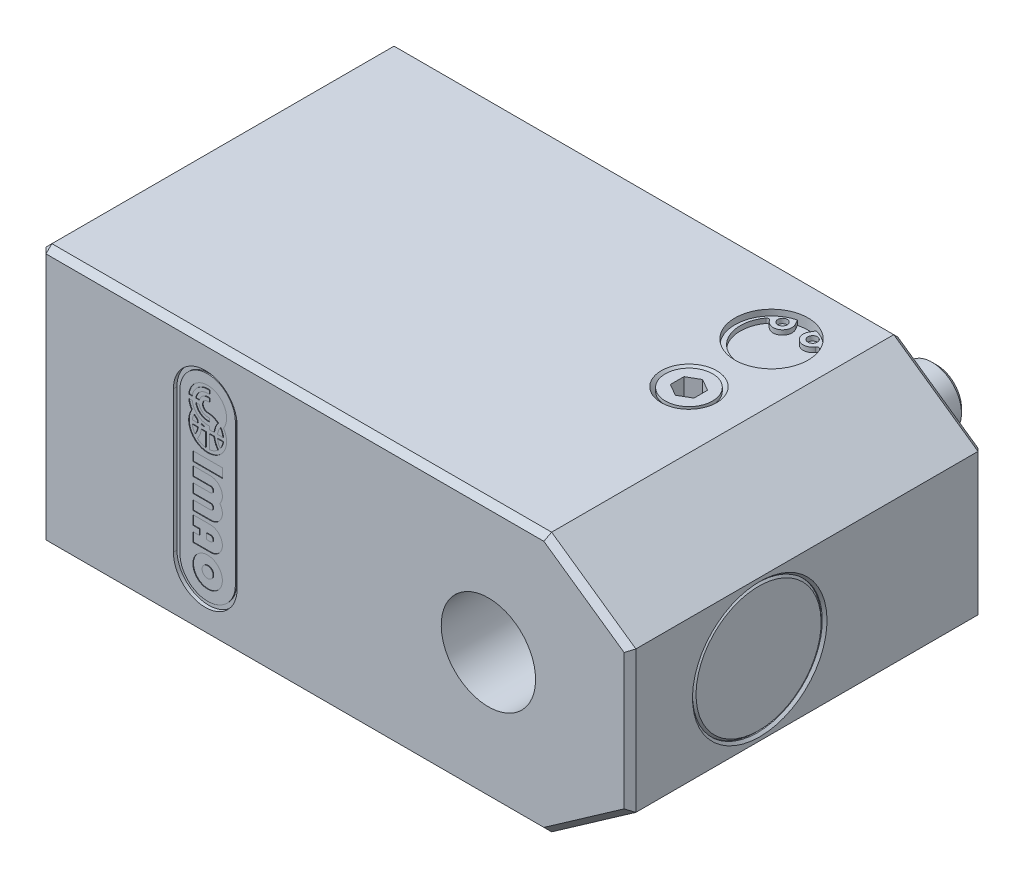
ISO-10303-21;
HEADER;
FILE_DESCRIPTION(('STEP AP214'),'2;1');
FILE_NAME('part.step','',(''),(''),'','','');
FILE_SCHEMA(('AUTOMOTIVE_DESIGN { 1 0 10303 214 1 1 1 1 }'));
ENDSEC;
DATA;
#1=APPLICATION_CONTEXT('core data for automotive mechanical design processes');
#2=APPLICATION_PROTOCOL_DEFINITION('international standard','automotive_design',2000,#1);
#3=PRODUCT_CONTEXT('',#1,'mechanical');
#4=PRODUCT('Part','Part','',(#3));
#5=PRODUCT_RELATED_PRODUCT_CATEGORY('part','',(#4));
#6=PRODUCT_DEFINITION_FORMATION('','',#4);
#7=PRODUCT_DEFINITION_CONTEXT('part definition',#1,'design');
#8=PRODUCT_DEFINITION('design','',#6,#7);
#9=PRODUCT_DEFINITION_SHAPE('','',#8);
#10=(LENGTH_UNIT() NAMED_UNIT(*) SI_UNIT(.MILLI.,.METRE.));
#11=(NAMED_UNIT(*) PLANE_ANGLE_UNIT() SI_UNIT($,.RADIAN.));
#12=(NAMED_UNIT(*) SI_UNIT($,.STERADIAN.) SOLID_ANGLE_UNIT());
#13=UNCERTAINTY_MEASURE_WITH_UNIT(LENGTH_MEASURE(1.E-05),#10,'distance_accuracy_value','');
#14=(GEOMETRIC_REPRESENTATION_CONTEXT(3) GLOBAL_UNCERTAINTY_ASSIGNED_CONTEXT((#13)) GLOBAL_UNIT_ASSIGNED_CONTEXT((#10,
#11,#12)) REPRESENTATION_CONTEXT('',''));
#15=CARTESIAN_POINT('',(0.,0.,0.));
#16=DIRECTION('',(0.,0.,1.));
#17=DIRECTION('',(1.,0.,0.));
#18=AXIS2_PLACEMENT_3D('',#15,#16,#17);
#19=CARTESIAN_POINT('',(0.,10.1,6.));
#20=DIRECTION('',(0.,1.,0.));
#21=DIRECTION('',(-1.,0.,0.));
#22=AXIS2_PLACEMENT_3D('',#19,#20,#21);
#23=PLANE('',#22);
#24=CARTESIAN_POINT('',(1.275,10.1,3.79163522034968));
#25=DIRECTION('',(0.,1.,0.));
#26=DIRECTION('',(-1.,0.,0.));
#27=AXIS2_PLACEMENT_3D('',#24,#25,#26);
#28=CIRCLE('',#27,0.8);
#29=CARTESIAN_POINT('',(0.582179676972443,10.1,3.39163522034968));
#30=VERTEX_POINT('',#29);
#31=CARTESIAN_POINT('',(1.95444102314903,10.1,4.21396198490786));
#32=VERTEX_POINT('',#31);
#33=EDGE_CURVE('E681',#30,#32,#28,.T.);
#34=ORIENTED_EDGE('',*,*,#33,.F.);
#35=DIRECTION('',(0.5,0.,-0.866025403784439));
#36=VECTOR('',#35,1.);
#37=CARTESIAN_POINT('',(-0.692820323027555,10.1,5.6));
#38=LINE('',#37,#36);
#39=CARTESIAN_POINT('',(0.804677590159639,10.1,3.0062575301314));
#40=VERTEX_POINT('',#39);
#41=EDGE_CURVE('E22',#30,#40,#38,.T.);
#42=ORIENTED_EDGE('',*,*,#41,.T.);
#43=CARTESIAN_POINT('',(0.,10.1,6.));
#44=DIRECTION('',(0.,1.,0.));
#45=DIRECTION('',(-1.,0.,0.));
#46=AXIS2_PLACEMENT_3D('',#43,#44,#45);
#47=CIRCLE('',#46,3.1);
#48=CARTESIAN_POINT('',(-0.804677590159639,10.1,3.00625753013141));
#49=VERTEX_POINT('',#48);
#50=EDGE_CURVE('E9',#49,#40,#47,.F.);
#51=ORIENTED_EDGE('',*,*,#50,.F.);
#52=DIRECTION('',(-0.5,0.,-0.86602540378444));
#53=VECTOR('',#52,1.);
#54=CARTESIAN_POINT('',(-0.582179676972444,10.1,3.39163522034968));
#55=LINE('',#54,#53);
#56=CARTESIAN_POINT('',(-0.582179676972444,10.1,3.39163522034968));
#57=VERTEX_POINT('',#56);
#58=EDGE_CURVE('E658',#57,#49,#55,.T.);
#59=ORIENTED_EDGE('',*,*,#58,.F.);
#60=CARTESIAN_POINT('',(-1.275,10.1,3.79163522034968));
#61=DIRECTION('',(0.,1.,0.));
#62=DIRECTION('',(-1.,0.,0.));
#63=AXIS2_PLACEMENT_3D('',#60,#61,#62);
#64=CIRCLE('',#63,0.8);
#65=CARTESIAN_POINT('',(-1.95444102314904,10.1,4.21396198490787));
#66=VERTEX_POINT('',#65);
#67=EDGE_CURVE('E1678',#66,#57,#64,.T.);
#68=ORIENTED_EDGE('',*,*,#67,.F.);
#69=CARTESIAN_POINT('',(-2.12430127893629,10.1,4.31954367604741));
#70=DIRECTION('',(0.,-1.,0.));
#71=DIRECTION('',(-1.,0.,0.));
#72=AXIS2_PLACEMENT_3D('',#69,#70,#71);
#73=CIRCLE('',#72,0.2);
#74=CARTESIAN_POINT('',(-2.28698984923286,10.1,4.20321470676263));
#75=VERTEX_POINT('',#74);
#76=EDGE_CURVE('E1680',#75,#66,#73,.T.);
#77=ORIENTED_EDGE('',*,*,#76,.F.);
#78=CARTESIAN_POINT('',(0.,10.1,5.83850581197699));
#79=DIRECTION('',(0.,-1.,0.));
#80=DIRECTION('',(-1.,0.,0.));
#81=AXIS2_PLACEMENT_3D('',#78,#79,#80);
#82=CIRCLE('',#81,2.81149418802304);
#83=CARTESIAN_POINT('',(2.28698984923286,10.1,4.20321470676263));
#84=VERTEX_POINT('',#83);
#85=EDGE_CURVE('E1682',#84,#75,#82,.T.);
#86=ORIENTED_EDGE('',*,*,#85,.F.);
#87=CARTESIAN_POINT('',(2.12430127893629,10.1,4.31954367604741));
#88=DIRECTION('',(0.,-1.,0.));
#89=DIRECTION('',(-1.,0.,0.));
#90=AXIS2_PLACEMENT_3D('',#87,#88,#89);
#91=CIRCLE('',#90,0.2);
#92=EDGE_CURVE('E1684',#32,#84,#91,.T.);
#93=ORIENTED_EDGE('',*,*,#92,.F.);
#94=EDGE_LOOP('',(#34,#42,#51,#59,#68,#77,#86,#93));
#95=FACE_BOUND('',#94,.T.);
#96=ADVANCED_FACE('F14',(#95),#23,.T.);
#97=CARTESIAN_POINT('',(0.,10.5,6.));
#98=DIRECTION('',(0.,1.,0.));
#99=DIRECTION('',(-1.,0.,0.));
#100=AXIS2_PLACEMENT_3D('',#97,#98,#99);
#101=PLANE('',#100);
#102=CARTESIAN_POINT('',(-1.275,10.5,3.79163522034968));
#103=DIRECTION('',(0.,1.,0.));
#104=DIRECTION('',(-1.,0.,0.));
#105=AXIS2_PLACEMENT_3D('',#102,#103,#104);
#106=CIRCLE('',#105,0.4);
#107=CARTESIAN_POINT('',(-1.675,10.5,3.79163522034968));
#108=VERTEX_POINT('',#107);
#109=EDGE_CURVE('E680',#108,#108,#106,.T.);
#110=ORIENTED_EDGE('',*,*,#109,.F.);
#111=EDGE_LOOP('',(#110));
#112=FACE_BOUND('',#111,.T.);
#113=CARTESIAN_POINT('',(1.275,10.5,3.79163522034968));
#114=DIRECTION('',(0.,1.,0.));
#115=DIRECTION('',(-1.,0.,0.));
#116=AXIS2_PLACEMENT_3D('',#113,#114,#115);
#117=CIRCLE('',#116,0.4);
#118=CARTESIAN_POINT('',(0.875,10.5,3.79163522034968));
#119=VERTEX_POINT('',#118);
#120=EDGE_CURVE('E677',#119,#119,#117,.T.);
#121=ORIENTED_EDGE('',*,*,#120,.F.);
#122=EDGE_LOOP('',(#121));
#123=FACE_BOUND('',#122,.T.);
#124=DIRECTION('',(-0.5,0.,-0.86602540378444));
#125=VECTOR('',#124,1.);
#126=CARTESIAN_POINT('',(-0.582179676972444,10.5,3.39163522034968));
#127=LINE('',#126,#125);
#128=CARTESIAN_POINT('',(-0.582179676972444,10.5,3.39163522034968));
#129=VERTEX_POINT('',#128);
#130=CARTESIAN_POINT('',(-0.80467759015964,10.5,3.0062575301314));
#131=VERTEX_POINT('',#130);
#132=EDGE_CURVE('E1675',#129,#131,#127,.T.);
#133=ORIENTED_EDGE('',*,*,#132,.T.);
#134=CARTESIAN_POINT('',(0.,10.5,6.));
#135=DIRECTION('',(0.,1.,0.));
#136=DIRECTION('',(-1.,0.,0.));
#137=AXIS2_PLACEMENT_3D('',#134,#135,#136);
#138=CIRCLE('',#137,3.1);
#139=CARTESIAN_POINT('',(0.804677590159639,10.5,3.0062575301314));
#140=VERTEX_POINT('',#139);
#141=EDGE_CURVE('E655',#131,#140,#138,.T.);
#142=ORIENTED_EDGE('',*,*,#141,.T.);
#143=DIRECTION('',(-0.5,0.,0.86602540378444));
#144=VECTOR('',#143,1.);
#145=CARTESIAN_POINT('',(0.582179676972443,10.5,3.39163522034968));
#146=LINE('',#145,#144);
#147=CARTESIAN_POINT('',(0.582179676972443,10.5,3.39163522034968));
#148=VERTEX_POINT('',#147);
#149=EDGE_CURVE('E647',#140,#148,#146,.T.);
#150=ORIENTED_EDGE('',*,*,#149,.T.);
#151=CARTESIAN_POINT('',(1.275,10.5,3.79163522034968));
#152=DIRECTION('',(0.,1.,0.));
#153=DIRECTION('',(-1.,0.,0.));
#154=AXIS2_PLACEMENT_3D('',#151,#152,#153);
#155=CIRCLE('',#154,0.8);
#156=CARTESIAN_POINT('',(1.95444102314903,10.5,4.21396198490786));
#157=VERTEX_POINT('',#156);
#158=EDGE_CURVE('E652',#148,#157,#155,.T.);
#159=ORIENTED_EDGE('',*,*,#158,.T.);
#160=CARTESIAN_POINT('',(2.12430127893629,10.5,4.31954367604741));
#161=DIRECTION('',(0.,-1.,0.));
#162=DIRECTION('',(-1.,0.,0.));
#163=AXIS2_PLACEMENT_3D('',#160,#161,#162);
#164=CIRCLE('',#163,0.2);
#165=CARTESIAN_POINT('',(2.28698984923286,10.5,4.20321470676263));
#166=VERTEX_POINT('',#165);
#167=EDGE_CURVE('E671',#157,#166,#164,.T.);
#168=ORIENTED_EDGE('',*,*,#167,.T.);
#169=CARTESIAN_POINT('',(0.,10.5,5.83850581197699));
#170=DIRECTION('',(0.,-1.,0.));
#171=DIRECTION('',(-1.,0.,0.));
#172=AXIS2_PLACEMENT_3D('',#169,#170,#171);
#173=CIRCLE('',#172,2.81149418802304);
#174=CARTESIAN_POINT('',(-2.28698984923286,10.5,4.20321470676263));
#175=VERTEX_POINT('',#174);
#176=EDGE_CURVE('E673',#166,#175,#173,.T.);
#177=ORIENTED_EDGE('',*,*,#176,.T.);
#178=CARTESIAN_POINT('',(-2.12430127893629,10.5,4.31954367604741));
#179=DIRECTION('',(0.,-1.,0.));
#180=DIRECTION('',(-1.,0.,0.));
#181=AXIS2_PLACEMENT_3D('',#178,#179,#180);
#182=CIRCLE('',#181,0.2);
#183=CARTESIAN_POINT('',(-1.95444102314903,10.5,4.21396198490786));
#184=VERTEX_POINT('',#183);
#185=EDGE_CURVE('E1690',#175,#184,#182,.T.);
#186=ORIENTED_EDGE('',*,*,#185,.T.);
#187=CARTESIAN_POINT('',(-1.275,10.5,3.79163522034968));
#188=DIRECTION('',(0.,1.,0.));
#189=DIRECTION('',(-1.,0.,0.));
#190=AXIS2_PLACEMENT_3D('',#187,#188,#189);
#191=CIRCLE('',#190,0.8);
#192=EDGE_CURVE('E1688',#184,#129,#191,.T.);
#193=ORIENTED_EDGE('',*,*,#192,.T.);
#194=EDGE_LOOP('',(#133,#142,#150,#159,#168,#177,#186,#193));
#195=FACE_BOUND('',#194,.T.);
#196=ADVANCED_FACE('F650',(#112,#123,#195),#101,.T.);
#197=CARTESIAN_POINT('',(0.582179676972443,10.5,3.39163522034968));
#198=DIRECTION('',(0.86602540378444,0.,0.5));
#199=DIRECTION('',(0.5,0.,-0.86602540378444));
#200=AXIS2_PLACEMENT_3D('',#197,#198,#199);
#201=PLANE('',#200);
#202=DIRECTION('',(0.,-1.,0.));
#203=VECTOR('',#202,1.);
#204=CARTESIAN_POINT('',(0.804677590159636,5.02140164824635,3.00625753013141));
#205=LINE('',#204,#203);
#206=EDGE_CURVE('E698',#40,#140,#205,.F.);
#207=ORIENTED_EDGE('',*,*,#206,.F.);
#208=ORIENTED_EDGE('',*,*,#41,.F.);
#209=DIRECTION('',(0.,-1.,0.));
#210=VECTOR('',#209,1.);
#211=CARTESIAN_POINT('',(0.582179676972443,10.5,3.39163522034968));
#212=LINE('',#211,#210);
#213=EDGE_CURVE('E661',#148,#30,#212,.T.);
#214=ORIENTED_EDGE('',*,*,#213,.F.);
#215=ORIENTED_EDGE('',*,*,#149,.F.);
#216=EDGE_LOOP('',(#207,#208,#214,#215));
#217=FACE_BOUND('',#216,.T.);
#218=ADVANCED_FACE('F662',(#217),#201,.F.);
#219=CARTESIAN_POINT('',(-0.582179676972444,10.5,3.39163522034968));
#220=DIRECTION('',(-0.86602540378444,0.,0.5));
#221=DIRECTION('',(0.5,0.,0.86602540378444));
#222=AXIS2_PLACEMENT_3D('',#219,#220,#221);
#223=PLANE('',#222);
#224=DIRECTION('',(0.,-1.,0.));
#225=VECTOR('',#224,1.);
#226=CARTESIAN_POINT('',(-0.804677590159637,5.02140164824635,3.00625753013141));
#227=LINE('',#226,#225);
#228=EDGE_CURVE('E666',#131,#49,#227,.T.);
#229=ORIENTED_EDGE('',*,*,#228,.F.);
#230=ORIENTED_EDGE('',*,*,#132,.F.);
#231=DIRECTION('',(0.,-1.,0.));
#232=VECTOR('',#231,1.);
#233=CARTESIAN_POINT('',(-0.582179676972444,10.5,3.39163522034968));
#234=LINE('',#233,#232);
#235=EDGE_CURVE('E1672',#129,#57,#234,.T.);
#236=ORIENTED_EDGE('',*,*,#235,.T.);
#237=ORIENTED_EDGE('',*,*,#58,.T.);
#238=EDGE_LOOP('',(#229,#230,#236,#237));
#239=FACE_BOUND('',#238,.T.);
#240=ADVANCED_FACE('F1706',(#239),#223,.F.);
#241=CARTESIAN_POINT('',(1.275,10.5,3.79163522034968));
#242=DIRECTION('',(0.,-1.,0.));
#243=DIRECTION('',(1.,0.,0.));
#244=AXIS2_PLACEMENT_3D('',#241,#242,#243);
#245=CYLINDRICAL_SURFACE('',#244,0.8);
#246=ORIENTED_EDGE('',*,*,#33,.T.);
#247=DIRECTION('',(0.,-1.,0.));
#248=VECTOR('',#247,1.);
#249=CARTESIAN_POINT('',(1.95444102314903,10.5,4.21396198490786));
#250=LINE('',#249,#248);
#251=EDGE_CURVE('E665',#157,#32,#250,.T.);
#252=ORIENTED_EDGE('',*,*,#251,.F.);
#253=ORIENTED_EDGE('',*,*,#158,.F.);
#254=ORIENTED_EDGE('',*,*,#213,.T.);
#255=EDGE_LOOP('',(#246,#252,#253,#254));
#256=FACE_BOUND('',#255,.T.);
#257=ADVANCED_FACE('F668',(#256),#245,.T.);
#258=CARTESIAN_POINT('',(2.12430127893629,10.5,4.31954367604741));
#259=DIRECTION('',(0.,-1.,0.));
#260=DIRECTION('',(1.,0.,0.));
#261=AXIS2_PLACEMENT_3D('',#258,#259,#260);
#262=CYLINDRICAL_SURFACE('',#261,0.2);
#263=ORIENTED_EDGE('',*,*,#92,.T.);
#264=DIRECTION('',(0.,-1.,0.));
#265=VECTOR('',#264,1.);
#266=CARTESIAN_POINT('',(2.28698984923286,10.5,4.20321470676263));
#267=LINE('',#266,#265);
#268=EDGE_CURVE('E1665',#166,#84,#267,.T.);
#269=ORIENTED_EDGE('',*,*,#268,.F.);
#270=ORIENTED_EDGE('',*,*,#167,.F.);
#271=ORIENTED_EDGE('',*,*,#251,.T.);
#272=EDGE_LOOP('',(#263,#269,#270,#271));
#273=FACE_BOUND('',#272,.T.);
#274=ADVANCED_FACE('F1709',(#273),#262,.F.);
#275=CARTESIAN_POINT('',(0.,10.5,5.83850581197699));
#276=DIRECTION('',(0.,-1.,0.));
#277=DIRECTION('',(1.,0.,0.));
#278=AXIS2_PLACEMENT_3D('',#275,#276,#277);
#279=CYLINDRICAL_SURFACE('',#278,2.81149418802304);
#280=ORIENTED_EDGE('',*,*,#85,.T.);
#281=DIRECTION('',(0.,-1.,0.));
#282=VECTOR('',#281,1.);
#283=CARTESIAN_POINT('',(-2.28698984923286,10.5,4.20321470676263));
#284=LINE('',#283,#282);
#285=EDGE_CURVE('E1668',#175,#75,#284,.T.);
#286=ORIENTED_EDGE('',*,*,#285,.F.);
#287=ORIENTED_EDGE('',*,*,#176,.F.);
#288=ORIENTED_EDGE('',*,*,#268,.T.);
#289=EDGE_LOOP('',(#280,#286,#287,#288));
#290=FACE_BOUND('',#289,.T.);
#291=ADVANCED_FACE('F1696',(#290),#279,.F.);
#292=CARTESIAN_POINT('',(-2.12430127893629,10.5,4.31954367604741));
#293=DIRECTION('',(0.,-1.,0.));
#294=DIRECTION('',(1.,0.,0.));
#295=AXIS2_PLACEMENT_3D('',#292,#293,#294);
#296=CYLINDRICAL_SURFACE('',#295,0.2);
#297=ORIENTED_EDGE('',*,*,#76,.T.);
#298=DIRECTION('',(0.,-1.,0.));
#299=VECTOR('',#298,1.);
#300=CARTESIAN_POINT('',(-1.95444102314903,10.5,4.21396198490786));
#301=LINE('',#300,#299);
#302=EDGE_CURVE('E29',#184,#66,#301,.T.);
#303=ORIENTED_EDGE('',*,*,#302,.F.);
#304=ORIENTED_EDGE('',*,*,#185,.F.);
#305=ORIENTED_EDGE('',*,*,#285,.T.);
#306=EDGE_LOOP('',(#297,#303,#304,#305));
#307=FACE_BOUND('',#306,.T.);
#308=ADVANCED_FACE('F1700',(#307),#296,.F.);
#309=CARTESIAN_POINT('',(-1.275,10.5,3.79163522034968));
#310=DIRECTION('',(0.,-1.,0.));
#311=DIRECTION('',(1.,0.,0.));
#312=AXIS2_PLACEMENT_3D('',#309,#310,#311);
#313=CYLINDRICAL_SURFACE('',#312,0.8);
#314=ORIENTED_EDGE('',*,*,#67,.T.);
#315=ORIENTED_EDGE('',*,*,#235,.F.);
#316=ORIENTED_EDGE('',*,*,#192,.F.);
#317=ORIENTED_EDGE('',*,*,#302,.T.);
#318=EDGE_LOOP('',(#314,#315,#316,#317));
#319=FACE_BOUND('',#318,.T.);
#320=ADVANCED_FACE('F1703',(#319),#313,.T.);
#321=CARTESIAN_POINT('',(1.275,10.5,3.79163522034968));
#322=DIRECTION('',(0.,-1.,0.));
#323=DIRECTION('',(1.,0.,0.));
#324=AXIS2_PLACEMENT_3D('',#321,#322,#323);
#325=CYLINDRICAL_SURFACE('',#324,0.4);
#326=ORIENTED_EDGE('',*,*,#120,.T.);
#327=EDGE_LOOP('',(#326));
#328=FACE_BOUND('',#327,.T.);
#329=CARTESIAN_POINT('',(1.275,10.1,3.79163522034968));
#330=DIRECTION('',(0.,1.,0.));
#331=DIRECTION('',(-1.,0.,0.));
#332=AXIS2_PLACEMENT_3D('',#329,#330,#331);
#333=CIRCLE('',#332,0.4);
#334=CARTESIAN_POINT('',(0.875,10.1,3.79163522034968));
#335=VERTEX_POINT('',#334);
#336=EDGE_CURVE('E688',#335,#335,#333,.F.);
#337=ORIENTED_EDGE('',*,*,#336,.T.);
#338=EDGE_LOOP('',(#337));
#339=FACE_BOUND('',#338,.T.);
#340=ADVANCED_FACE('F1748',(#328,#339),#325,.F.);
#341=CARTESIAN_POINT('',(-1.275,10.5,3.79163522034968));
#342=DIRECTION('',(0.,-1.,0.));
#343=DIRECTION('',(1.,0.,0.));
#344=AXIS2_PLACEMENT_3D('',#341,#342,#343);
#345=CYLINDRICAL_SURFACE('',#344,0.4);
#346=ORIENTED_EDGE('',*,*,#109,.T.);
#347=EDGE_LOOP('',(#346));
#348=FACE_BOUND('',#347,.T.);
#349=CARTESIAN_POINT('',(-1.275,10.1,3.79163522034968));
#350=DIRECTION('',(0.,1.,0.));
#351=DIRECTION('',(-1.,0.,0.));
#352=AXIS2_PLACEMENT_3D('',#349,#350,#351);
#353=CIRCLE('',#352,0.4);
#354=CARTESIAN_POINT('',(-1.675,10.1,3.79163522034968));
#355=VERTEX_POINT('',#354);
#356=EDGE_CURVE('E685',#355,#355,#353,.F.);
#357=ORIENTED_EDGE('',*,*,#356,.T.);
#358=EDGE_LOOP('',(#357));
#359=FACE_BOUND('',#358,.T.);
#360=ADVANCED_FACE('F1734',(#348,#359),#345,.F.);
#361=CARTESIAN_POINT('',(-24.,6.,29.8));
#362=DIRECTION('',(0.,0.,1.));
#363=DIRECTION('',(0.,-1.,0.));
#364=AXIS2_PLACEMENT_3D('',#361,#362,#363);
#365=PLANE('',#364);
#366=CARTESIAN_POINT('',(-24.,-6.20934262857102,29.8));
#367=DIRECTION('',(0.,0.,1.));
#368=DIRECTION('',(0.,-1.,0.));
#369=AXIS2_PLACEMENT_3D('',#366,#367,#368);
#370=CIRCLE('',#369,0.4688928);
#371=CARTESIAN_POINT('',(-24.,-6.67823542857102,29.8));
#372=VERTEX_POINT('',#371);
#373=EDGE_CURVE('E1523',#372,#372,#370,.T.);
#374=ORIENTED_EDGE('',*,*,#373,.T.);
#375=EDGE_LOOP('',(#374));
#376=FACE_BOUND('',#375,.T.);
#377=ADVANCED_FACE('F1722',(#376),#365,.T.);
#378=DIRECTION('',(1.,0.,0.));
#379=VECTOR('',#378,1.);
#380=CARTESIAN_POINT('',(-36.0488812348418,-3.86487862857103,29.8));
#381=LINE('',#380,#379);
#382=CARTESIAN_POINT('',(-24.0781488,-3.86487862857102,29.8));
#383=VERTEX_POINT('',#382);
#384=CARTESIAN_POINT('',(-23.7655533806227,-3.86487862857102,29.8));
#385=VERTEX_POINT('',#384);
#386=EDGE_CURVE('E1490',#383,#385,#381,.T.);
#387=ORIENTED_EDGE('',*,*,#386,.T.);
#388=CARTESIAN_POINT('',(-23.7655533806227,-3.63043222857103,29.8));
#389=DIRECTION('',(0.,0.,1.));
#390=DIRECTION('',(0.,-1.,0.));
#391=AXIS2_PLACEMENT_3D('',#388,#389,#390);
#392=CIRCLE('',#391,0.2344464);
#393=CARTESIAN_POINT('',(-23.7655533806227,-3.39598582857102,29.8));
#394=VERTEX_POINT('',#393);
#395=EDGE_CURVE('E1429',#385,#394,#392,.T.);
#396=ORIENTED_EDGE('',*,*,#395,.T.);
#397=DIRECTION('',(-1.,0.,0.));
#398=VECTOR('',#397,1.);
#399=CARTESIAN_POINT('',(-36.0488812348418,-3.39598582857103,29.8));
#400=LINE('',#399,#398);
#401=CARTESIAN_POINT('',(-24.0781488,-3.39598582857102,29.8));
#402=VERTEX_POINT('',#401);
#403=EDGE_CURVE('E1496',#394,#402,#400,.T.);
#404=ORIENTED_EDGE('',*,*,#403,.T.);
#405=DIRECTION('',(0.,-1.,0.));
#406=VECTOR('',#405,1.);
#407=CARTESIAN_POINT('',(-24.0781488,0.0239545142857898,29.8));
#408=LINE('',#407,#406);
#409=EDGE_CURVE('E1493',#402,#383,#408,.T.);
#410=ORIENTED_EDGE('',*,*,#409,.T.);
#411=EDGE_LOOP('',(#387,#396,#404,#410));
#412=FACE_BOUND('',#411,.T.);
#413=ADVANCED_FACE('F1736',(#412),#365,.T.);
#414=DIRECTION('',(1.,0.,0.));
#415=VECTOR('',#414,1.);
#416=CARTESIAN_POINT('',(-36.0488812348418,3.99763492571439,29.8));
#417=LINE('',#416,#415);
#418=CARTESIAN_POINT('',(-23.8392367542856,3.99763492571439,29.8));
#419=VERTEX_POINT('',#418);
#420=CARTESIAN_POINT('',(-23.4560641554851,3.99763492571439,29.8));
#421=VERTEX_POINT('',#420);
#422=EDGE_CURVE('E1072',#419,#421,#417,.T.);
#423=ORIENTED_EDGE('',*,*,#422,.F.);
#424=DIRECTION('',(0.,-1.,0.));
#425=VECTOR('',#424,1.);
#426=CARTESIAN_POINT('',(-23.8392367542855,0.0239545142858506,29.8));
#427=LINE('',#426,#425);
#428=CARTESIAN_POINT('',(-23.8392367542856,2.8553781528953,29.8));
#429=VERTEX_POINT('',#428);
#430=EDGE_CURVE('E1062',#419,#429,#427,.T.);
#431=ORIENTED_EDGE('',*,*,#430,.T.);
#432=CARTESIAN_POINT('',(-24.,4.15839817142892,29.8));
#433=DIRECTION('',(0.,0.,1.));
#434=DIRECTION('',(0.,-1.,0.));
#435=AXIS2_PLACEMENT_3D('',#432,#433,#434);
#436=CIRCLE('',#435,1.31289983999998);
#437=CARTESIAN_POINT('',(-23.1290316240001,3.17599292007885,29.8));
#438=VERTEX_POINT('',#437);
#439=EDGE_CURVE('E1065',#429,#438,#436,.T.);
#440=ORIENTED_EDGE('',*,*,#439,.T.);
#441=CARTESIAN_POINT('',(-21.8564900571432,4.15839817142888,29.8));
#442=DIRECTION('',(0.,0.,1.));
#443=DIRECTION('',(0.,-1.,0.));
#444=AXIS2_PLACEMENT_3D('',#441,#442,#443);
#445=CIRCLE('',#444,1.60763245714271);
#446=EDGE_CURVE('E1069',#421,#438,#445,.T.);
#447=ORIENTED_EDGE('',*,*,#446,.F.);
#448=EDGE_LOOP('',(#423,#431,#440,#447));
#449=FACE_BOUND('',#448,.T.);
#450=ADVANCED_FACE('F1745',(#449),#365,.T.);
#451=CARTESIAN_POINT('',(-26.1435099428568,4.15839817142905,29.8));
#452=DIRECTION('',(0.,0.,1.));
#453=DIRECTION('',(0.,-1.,0.));
#454=AXIS2_PLACEMENT_3D('',#451,#452,#453);
#455=CIRCLE('',#454,1.60763245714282);
#456=CARTESIAN_POINT('',(-24.8709683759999,3.17599292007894,29.8));
#457=VERTEX_POINT('',#456);
#458=CARTESIAN_POINT('',(-24.5439358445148,3.99763492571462,29.8));
#459=VERTEX_POINT('',#458);
#460=EDGE_CURVE('E1080',#457,#459,#455,.T.);
#461=ORIENTED_EDGE('',*,*,#460,.F.);
#462=CARTESIAN_POINT('',(-24.,4.15839817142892,29.8));
#463=DIRECTION('',(0.,0.,1.));
#464=DIRECTION('',(0.,-1.,0.));
#465=AXIS2_PLACEMENT_3D('',#462,#463,#464);
#466=CIRCLE('',#465,1.31289983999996);
#467=CARTESIAN_POINT('',(-24.1607632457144,2.8553781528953,29.8));
#468=VERTEX_POINT('',#467);
#469=EDGE_CURVE('E1083',#457,#468,#466,.T.);
#470=ORIENTED_EDGE('',*,*,#469,.T.);
#471=DIRECTION('',(0.,-1.,0.));
#472=VECTOR('',#471,1.);
#473=CARTESIAN_POINT('',(-24.1607632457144,0.02395451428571,29.8));
#474=LINE('',#473,#472);
#475=CARTESIAN_POINT('',(-24.1607632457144,3.99763492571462,29.8));
#476=VERTEX_POINT('',#475);
#477=EDGE_CURVE('E1074',#476,#468,#474,.T.);
#478=ORIENTED_EDGE('',*,*,#477,.F.);
#479=DIRECTION('',(1.,0.,0.));
#480=VECTOR('',#479,1.);
#481=CARTESIAN_POINT('',(-36.0488812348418,3.99763492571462,29.8));
#482=LINE('',#481,#480);
#483=EDGE_CURVE('E1077',#459,#476,#482,.T.);
#484=ORIENTED_EDGE('',*,*,#483,.F.);
#485=EDGE_LOOP('',(#461,#470,#478,#484));
#486=FACE_BOUND('',#485,.T.);
#487=ADVANCED_FACE('F1747',(#486),#365,.T.);
#488=CARTESIAN_POINT('',(-24.,4.15839817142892,29.8));
#489=DIRECTION('',(0.,0.,1.));
#490=DIRECTION('',(0.,-1.,0.));
#491=AXIS2_PLACEMENT_3D('',#488,#489,#490);
#492=CIRCLE('',#491,1.31289984);
#493=CARTESIAN_POINT('',(-22.6969799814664,4.3191614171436,29.8));
#494=VERTEX_POINT('',#493);
#495=CARTESIAN_POINT('',(-22.9282450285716,4.91671688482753,29.8));
#496=VERTEX_POINT('',#495);
#497=EDGE_CURVE('E1089',#494,#496,#492,.T.);
#498=ORIENTED_EDGE('',*,*,#497,.T.);
#499=CARTESIAN_POINT('',(-21.8564900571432,4.15839817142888,29.8));
#500=DIRECTION('',(0.,0.,1.));
#501=DIRECTION('',(0.,-1.,0.));
#502=AXIS2_PLACEMENT_3D('',#499,#500,#501);
#503=CIRCLE('',#502,1.31289983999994);
#504=CARTESIAN_POINT('',(-23.1595100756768,4.3191614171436,29.8));
#505=VERTEX_POINT('',#504);
#506=EDGE_CURVE('E1092',#496,#505,#503,.T.);
#507=ORIENTED_EDGE('',*,*,#506,.T.);
#508=DIRECTION('',(1.,0.,0.));
#509=VECTOR('',#508,1.);
#510=CARTESIAN_POINT('',(-36.0488812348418,4.3191614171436,29.8));
#511=LINE('',#510,#509);
#512=EDGE_CURVE('E1086',#505,#494,#511,.T.);
#513=ORIENTED_EDGE('',*,*,#512,.T.);
#514=EDGE_LOOP('',(#498,#507,#513));
#515=FACE_BOUND('',#514,.T.);
#516=ADVANCED_FACE('F1776',(#515),#365,.T.);
#517=DIRECTION('',(1.,0.,0.));
#518=VECTOR('',#517,1.);
#519=CARTESIAN_POINT('',(-36.0488812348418,3.99763492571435,29.8));
#520=LINE('',#519,#518);
#521=CARTESIAN_POINT('',(-23.1595100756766,3.99763492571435,29.8));
#522=VERTEX_POINT('',#521);
#523=CARTESIAN_POINT('',(-22.6969799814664,3.99763492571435,29.8));
#524=VERTEX_POINT('',#523);
#525=EDGE_CURVE('E1098',#522,#524,#520,.T.);
#526=ORIENTED_EDGE('',*,*,#525,.F.);
#527=CARTESIAN_POINT('',(-21.8564900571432,4.15839817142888,29.8));
#528=DIRECTION('',(0.,0.,1.));
#529=DIRECTION('',(0.,-1.,0.));
#530=AXIS2_PLACEMENT_3D('',#527,#528,#529);
#531=CIRCLE('',#530,1.31289983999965);
#532=CARTESIAN_POINT('',(-22.9282450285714,3.40007945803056,29.8));
#533=VERTEX_POINT('',#532);
#534=EDGE_CURVE('E1101',#522,#533,#531,.T.);
#535=ORIENTED_EDGE('',*,*,#534,.T.);
#536=CARTESIAN_POINT('',(-24.,4.15839817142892,29.8));
#537=DIRECTION('',(0.,0.,1.));
#538=DIRECTION('',(0.,-1.,0.));
#539=AXIS2_PLACEMENT_3D('',#536,#537,#538);
#540=CIRCLE('',#539,1.31289983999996);
#541=EDGE_CURVE('E1095',#533,#524,#540,.T.);
#542=ORIENTED_EDGE('',*,*,#541,.T.);
#543=EDGE_LOOP('',(#526,#535,#542));
#544=FACE_BOUND('',#543,.T.);
#545=ADVANCED_FACE('F3644',(#544),#365,.T.);
#546=CARTESIAN_POINT('',(-24.,5.9,29.8));
#547=DIRECTION('',(0.,0.,1.));
#548=DIRECTION('',(0.,-1.,0.));
#549=AXIS2_PLACEMENT_3D('',#546,#547,#548);
#550=CIRCLE('',#549,1.60763245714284);
#551=CARTESIAN_POINT('',(-24.5527005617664,4.39036288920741,29.8));
#552=VERTEX_POINT('',#551);
#553=CARTESIAN_POINT('',(-24.2922866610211,4.31916141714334,29.8));
#554=VERTEX_POINT('',#553);
#555=EDGE_CURVE('E1107',#552,#554,#550,.T.);
#556=ORIENTED_EDGE('',*,*,#555,.F.);
#557=DIRECTION('',(0.122175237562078,-0.992508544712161,0.));
#558=VECTOR('',#557,1.);
#559=CARTESIAN_POINT('',(-24.194831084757,1.48315746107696,29.8));
#560=LINE('',#559,#558);
#561=CARTESIAN_POINT('',(-24.5439358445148,4.31916141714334,29.8));
#562=VERTEX_POINT('',#561);
#563=EDGE_CURVE('E1110',#552,#562,#560,.T.);
#564=ORIENTED_EDGE('',*,*,#563,.T.);
#565=DIRECTION('',(1.,0.,0.));
#566=VECTOR('',#565,1.);
#567=CARTESIAN_POINT('',(-36.0488812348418,4.31916141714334,29.8));
#568=LINE('',#567,#566);
#569=EDGE_CURVE('E1104',#562,#554,#568,.T.);
#570=ORIENTED_EDGE('',*,*,#569,.T.);
#571=EDGE_LOOP('',(#556,#564,#570));
#572=FACE_BOUND('',#571,.T.);
#573=ADVANCED_FACE('F1791',(#572),#365,.T.);
#574=CARTESIAN_POINT('',(-24.,5.9,29.8));
#575=DIRECTION('',(0.,0.,1.));
#576=DIRECTION('',(0.,-1.,0.));
#577=AXIS2_PLACEMENT_3D('',#574,#575,#576);
#578=CIRCLE('',#577,1.60763245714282);
#579=CARTESIAN_POINT('',(-25.155305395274,4.78207712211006,29.8));
#580=VERTEX_POINT('',#579);
#581=CARTESIAN_POINT('',(-24.8950108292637,4.564545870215,29.8));
#582=VERTEX_POINT('',#581);
#583=EDGE_CURVE('E1119',#580,#582,#578,.T.);
#584=ORIENTED_EDGE('',*,*,#583,.F.);
#585=CARTESIAN_POINT('',(-24.,4.15839817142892,29.8));
#586=DIRECTION('',(0.,0.,1.));
#587=DIRECTION('',(0.,-1.,0.));
#588=AXIS2_PLACEMENT_3D('',#585,#586,#587);
#589=CIRCLE('',#588,1.31289984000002);
#590=CARTESIAN_POINT('',(-25.3030200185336,4.31916141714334,29.8));
#591=VERTEX_POINT('',#590);
#592=EDGE_CURVE('E1122',#580,#591,#589,.T.);
#593=ORIENTED_EDGE('',*,*,#592,.T.);
#594=DIRECTION('',(1.,0.,0.));
#595=VECTOR('',#594,1.);
#596=CARTESIAN_POINT('',(-36.0488812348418,4.31916141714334,29.8));
#597=LINE('',#596,#595);
#598=CARTESIAN_POINT('',(-24.8404899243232,4.31916141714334,29.8));
#599=VERTEX_POINT('',#598);
#600=EDGE_CURVE('E1113',#591,#599,#597,.T.);
#601=ORIENTED_EDGE('',*,*,#600,.T.);
#602=CARTESIAN_POINT('',(-26.1435099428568,4.15839817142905,29.8));
#603=DIRECTION('',(0.,0.,1.));
#604=DIRECTION('',(0.,-1.,0.));
#605=AXIS2_PLACEMENT_3D('',#602,#603,#604);
#606=CIRCLE('',#605,1.31289983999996);
#607=EDGE_CURVE('E1116',#599,#582,#606,.T.);
#608=ORIENTED_EDGE('',*,*,#607,.T.);
#609=EDGE_LOOP('',(#584,#593,#601,#608));
#610=FACE_BOUND('',#609,.T.);
#611=ADVANCED_FACE('F1781',(#610),#365,.T.);
#612=CARTESIAN_POINT('',(-24.,4.15839817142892,29.8));
#613=DIRECTION('',(0.,0.,1.));
#614=DIRECTION('',(0.,-1.,0.));
#615=AXIS2_PLACEMENT_3D('',#612,#613,#614);
#616=CIRCLE('',#615,1.31289983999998);
#617=CARTESIAN_POINT('',(-25.3030200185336,3.99763492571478,29.8));
#618=VERTEX_POINT('',#617);
#619=CARTESIAN_POINT('',(-25.0717549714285,3.40007945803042,29.8));
#620=VERTEX_POINT('',#619);
#621=EDGE_CURVE('E1128',#618,#620,#616,.T.);
#622=ORIENTED_EDGE('',*,*,#621,.T.);
#623=CARTESIAN_POINT('',(-26.1435099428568,4.15839817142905,29.8));
#624=DIRECTION('',(0.,0.,1.));
#625=DIRECTION('',(0.,-1.,0.));
#626=AXIS2_PLACEMENT_3D('',#623,#624,#625);
#627=CIRCLE('',#626,1.31289983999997);
#628=CARTESIAN_POINT('',(-24.8404899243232,3.99763492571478,29.8));
#629=VERTEX_POINT('',#628);
#630=EDGE_CURVE('E1131',#620,#629,#627,.T.);
#631=ORIENTED_EDGE('',*,*,#630,.T.);
#632=DIRECTION('',(1.,0.,0.));
#633=VECTOR('',#632,1.);
#634=CARTESIAN_POINT('',(-36.0488812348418,3.99763492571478,29.8));
#635=LINE('',#634,#633);
#636=EDGE_CURVE('E1125',#618,#629,#635,.T.);
#637=ORIENTED_EDGE('',*,*,#636,.F.);
#638=EDGE_LOOP('',(#622,#631,#637));
#639=FACE_BOUND('',#638,.T.);
#640=ADVANCED_FACE('F1771',(#639),#365,.T.);
#641=CARTESIAN_POINT('',(-24.,-6.20934262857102,29.75));
#642=DIRECTION('',(0.,0.,1.));
#643=DIRECTION('',(0.,-1.,0.));
#644=AXIS2_PLACEMENT_3D('',#641,#642,#643);
#645=CYLINDRICAL_SURFACE('',#644,0.4688928);
#646=CARTESIAN_POINT('',(-24.,-6.20934262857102,29.75));
#647=DIRECTION('',(0.,0.,1.));
#648=DIRECTION('',(0.,-1.,0.));
#649=AXIS2_PLACEMENT_3D('',#646,#647,#648);
#650=CIRCLE('',#649,0.4688928);
#651=CARTESIAN_POINT('',(-24.,-6.67823542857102,29.75));
#652=VERTEX_POINT('',#651);
#653=EDGE_CURVE('E1548',#652,#652,#650,.T.);
#654=ORIENTED_EDGE('',*,*,#653,.T.);
#655=EDGE_LOOP('',(#654));
#656=FACE_BOUND('',#655,.T.);
#657=ORIENTED_EDGE('',*,*,#373,.F.);
#658=EDGE_LOOP('',(#657));
#659=FACE_BOUND('',#658,.T.);
#660=ADVANCED_FACE('F1780',(#656,#659),#645,.T.);
#661=CARTESIAN_POINT('',(-36.0488812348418,-3.39598582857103,29.75));
#662=DIRECTION('',(0.,1.,0.));
#663=DIRECTION('',(0.,0.,1.));
#664=AXIS2_PLACEMENT_3D('',#661,#662,#663);
#665=PLANE('',#664);
#666=ORIENTED_EDGE('',*,*,#403,.F.);
#667=DIRECTION('',(0.,0.,1.));
#668=VECTOR('',#667,1.);
#669=CARTESIAN_POINT('',(-23.7655533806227,-3.39598582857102,29.75));
#670=LINE('',#669,#668);
#671=CARTESIAN_POINT('',(-23.7655533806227,-3.39598582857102,29.75));
#672=VERTEX_POINT('',#671);
#673=EDGE_CURVE('E1539',#672,#394,#670,.T.);
#674=ORIENTED_EDGE('',*,*,#673,.F.);
#675=DIRECTION('',(-1.,0.,0.));
#676=VECTOR('',#675,1.);
#677=CARTESIAN_POINT('',(-36.0488812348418,-3.39598582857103,29.75));
#678=LINE('',#677,#676);
#679=CARTESIAN_POINT('',(-24.0781488,-3.39598582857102,29.75));
#680=VERTEX_POINT('',#679);
#681=EDGE_CURVE('E1462',#672,#680,#678,.T.);
#682=ORIENTED_EDGE('',*,*,#681,.T.);
#683=DIRECTION('',(0.,0.,1.));
#684=VECTOR('',#683,1.);
#685=CARTESIAN_POINT('',(-24.0781488,-3.39598582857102,29.75));
#686=LINE('',#685,#684);
#687=EDGE_CURVE('E1542',#680,#402,#686,.T.);
#688=ORIENTED_EDGE('',*,*,#687,.T.);
#689=EDGE_LOOP('',(#666,#674,#682,#688));
#690=FACE_BOUND('',#689,.T.);
#691=ADVANCED_FACE('F1788',(#690),#665,.T.);
#692=CARTESIAN_POINT('',(-24.0781488,0.0239545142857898,29.75));
#693=DIRECTION('',(-1.,0.,0.));
#694=DIRECTION('',(0.,0.,-1.));
#695=AXIS2_PLACEMENT_3D('',#692,#693,#694);
#696=PLANE('',#695);
#697=ORIENTED_EDGE('',*,*,#409,.F.);
#698=ORIENTED_EDGE('',*,*,#687,.F.);
#699=DIRECTION('',(0.,-1.,0.));
#700=VECTOR('',#699,1.);
#701=CARTESIAN_POINT('',(-24.0781488,0.0239545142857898,29.75));
#702=LINE('',#701,#700);
#703=CARTESIAN_POINT('',(-24.0781488,-3.86487862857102,29.75));
#704=VERTEX_POINT('',#703);
#705=EDGE_CURVE('E1460',#680,#704,#702,.T.);
#706=ORIENTED_EDGE('',*,*,#705,.T.);
#707=DIRECTION('',(0.,0.,1.));
#708=VECTOR('',#707,1.);
#709=CARTESIAN_POINT('',(-24.0781488,-3.86487862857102,29.75));
#710=LINE('',#709,#708);
#711=EDGE_CURVE('E1544',#704,#383,#710,.T.);
#712=ORIENTED_EDGE('',*,*,#711,.T.);
#713=EDGE_LOOP('',(#697,#698,#706,#712));
#714=FACE_BOUND('',#713,.T.);
#715=ADVANCED_FACE('F2024',(#714),#696,.T.);
#716=CARTESIAN_POINT('',(-36.0488812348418,-3.86487862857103,29.75));
#717=DIRECTION('',(0.,-1.,0.));
#718=DIRECTION('',(0.,0.,-1.));
#719=AXIS2_PLACEMENT_3D('',#716,#717,#718);
#720=PLANE('',#719);
#721=ORIENTED_EDGE('',*,*,#386,.F.);
#722=ORIENTED_EDGE('',*,*,#711,.F.);
#723=DIRECTION('',(1.,0.,0.));
#724=VECTOR('',#723,1.);
#725=CARTESIAN_POINT('',(-36.0488812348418,-3.86487862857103,29.75));
#726=LINE('',#725,#724);
#727=CARTESIAN_POINT('',(-23.7655533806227,-3.86487862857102,29.75));
#728=VERTEX_POINT('',#727);
#729=EDGE_CURVE('E1457',#704,#728,#726,.T.);
#730=ORIENTED_EDGE('',*,*,#729,.T.);
#731=DIRECTION('',(0.,0.,1.));
#732=VECTOR('',#731,1.);
#733=CARTESIAN_POINT('',(-23.7655533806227,-3.86487862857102,29.75));
#734=LINE('',#733,#732);
#735=EDGE_CURVE('E1487',#728,#385,#734,.T.);
#736=ORIENTED_EDGE('',*,*,#735,.T.);
#737=EDGE_LOOP('',(#721,#722,#730,#736));
#738=FACE_BOUND('',#737,.T.);
#739=ADVANCED_FACE('F2028',(#738),#720,.T.);
#740=CARTESIAN_POINT('',(-23.7655533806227,-3.63043222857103,29.75));
#741=DIRECTION('',(0.,0.,1.));
#742=DIRECTION('',(0.,-1.,0.));
#743=AXIS2_PLACEMENT_3D('',#740,#741,#742);
#744=CYLINDRICAL_SURFACE('',#743,0.2344464);
#745=ORIENTED_EDGE('',*,*,#395,.F.);
#746=ORIENTED_EDGE('',*,*,#735,.F.);
#747=CARTESIAN_POINT('',(-23.7655533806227,-3.63043222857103,29.75));
#748=DIRECTION('',(0.,0.,1.));
#749=DIRECTION('',(0.,-1.,0.));
#750=AXIS2_PLACEMENT_3D('',#747,#748,#749);
#751=CIRCLE('',#750,0.2344464);
#752=EDGE_CURVE('E1454',#728,#672,#751,.T.);
#753=ORIENTED_EDGE('',*,*,#752,.T.);
#754=ORIENTED_EDGE('',*,*,#673,.T.);
#755=EDGE_LOOP('',(#745,#746,#753,#754));
#756=FACE_BOUND('',#755,.T.);
#757=ADVANCED_FACE('F1901',(#756),#744,.T.);
#758=CARTESIAN_POINT('',(-23.8392367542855,0.0239545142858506,29.75));
#759=DIRECTION('',(-1.,0.,0.));
#760=DIRECTION('',(0.,-1.,0.));
#761=AXIS2_PLACEMENT_3D('',#758,#759,#760);
#762=PLANE('',#761);
#763=ORIENTED_EDGE('',*,*,#430,.F.);
#764=DIRECTION('',(0.,0.,1.));
#765=VECTOR('',#764,1.);
#766=CARTESIAN_POINT('',(-23.8392367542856,3.99763492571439,29.75));
#767=LINE('',#766,#765);
#768=CARTESIAN_POINT('',(-23.8392367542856,3.99763492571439,29.75));
#769=VERTEX_POINT('',#768);
#770=EDGE_CURVE('E949',#769,#419,#767,.T.);
#771=ORIENTED_EDGE('',*,*,#770,.F.);
#772=DIRECTION('',(0.,-1.,0.));
#773=VECTOR('',#772,1.);
#774=CARTESIAN_POINT('',(-23.8392367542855,0.0239545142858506,29.75));
#775=LINE('',#774,#773);
#776=CARTESIAN_POINT('',(-23.8392367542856,2.8553781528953,29.75));
#777=VERTEX_POINT('',#776);
#778=EDGE_CURVE('E960',#769,#777,#775,.T.);
#779=ORIENTED_EDGE('',*,*,#778,.T.);
#780=DIRECTION('',(0.,0.,1.));
#781=VECTOR('',#780,1.);
#782=CARTESIAN_POINT('',(-23.8392367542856,2.8553781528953,29.75));
#783=LINE('',#782,#781);
#784=EDGE_CURVE('E1058',#777,#429,#783,.T.);
#785=ORIENTED_EDGE('',*,*,#784,.T.);
#786=EDGE_LOOP('',(#763,#771,#779,#785));
#787=FACE_BOUND('',#786,.T.);
#788=ADVANCED_FACE('F1897',(#787),#762,.T.);
#789=CARTESIAN_POINT('',(-24.,4.15839817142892,29.75));
#790=DIRECTION('',(0.,0.,1.));
#791=DIRECTION('',(0.,-1.,0.));
#792=AXIS2_PLACEMENT_3D('',#789,#790,#791);
#793=CYLINDRICAL_SURFACE('',#792,1.31289983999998);
#794=ORIENTED_EDGE('',*,*,#439,.F.);
#795=ORIENTED_EDGE('',*,*,#784,.F.);
#796=CARTESIAN_POINT('',(-24.,4.15839817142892,29.75));
#797=DIRECTION('',(0.,0.,1.));
#798=DIRECTION('',(0.,-1.,0.));
#799=AXIS2_PLACEMENT_3D('',#796,#797,#798);
#800=CIRCLE('',#799,1.31289983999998);
#801=CARTESIAN_POINT('',(-23.1290316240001,3.17599292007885,29.75));
#802=VERTEX_POINT('',#801);
#803=EDGE_CURVE('E1203',#777,#802,#800,.T.);
#804=ORIENTED_EDGE('',*,*,#803,.T.);
#805=DIRECTION('',(0.,0.,1.));
#806=VECTOR('',#805,1.);
#807=CARTESIAN_POINT('',(-23.1290316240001,3.17599292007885,29.75));
#808=LINE('',#807,#806);
#809=EDGE_CURVE('E1056',#802,#438,#808,.T.);
#810=ORIENTED_EDGE('',*,*,#809,.T.);
#811=EDGE_LOOP('',(#794,#795,#804,#810));
#812=FACE_BOUND('',#811,.T.);
#813=ADVANCED_FACE('F1893',(#812),#793,.T.);
#814=CARTESIAN_POINT('',(-21.8564900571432,4.15839817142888,29.75));
#815=DIRECTION('',(0.,0.,1.));
#816=DIRECTION('',(0.,-1.,0.));
#817=AXIS2_PLACEMENT_3D('',#814,#815,#816);
#818=CYLINDRICAL_SURFACE('',#817,1.60763245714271);
#819=ORIENTED_EDGE('',*,*,#446,.T.);
#820=ORIENTED_EDGE('',*,*,#809,.F.);
#821=CARTESIAN_POINT('',(-21.8564900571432,4.15839817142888,29.75));
#822=DIRECTION('',(0.,0.,1.));
#823=DIRECTION('',(0.,-1.,0.));
#824=AXIS2_PLACEMENT_3D('',#821,#822,#823);
#825=CIRCLE('',#824,1.60763245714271);
#826=CARTESIAN_POINT('',(-23.4560641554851,3.99763492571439,29.75));
#827=VERTEX_POINT('',#826);
#828=EDGE_CURVE('E1205',#827,#802,#825,.T.);
#829=ORIENTED_EDGE('',*,*,#828,.F.);
#830=DIRECTION('',(0.,0.,1.));
#831=VECTOR('',#830,1.);
#832=CARTESIAN_POINT('',(-23.4560641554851,3.99763492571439,29.75));
#833=LINE('',#832,#831);
#834=EDGE_CURVE('E1053',#827,#421,#833,.T.);
#835=ORIENTED_EDGE('',*,*,#834,.T.);
#836=EDGE_LOOP('',(#819,#820,#829,#835));
#837=FACE_BOUND('',#836,.T.);
#838=ADVANCED_FACE('F1889',(#837),#818,.F.);
#839=CARTESIAN_POINT('',(-36.0488812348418,3.99763492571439,29.75));
#840=DIRECTION('',(0.,-1.,0.));
#841=DIRECTION('',(0.,0.,-1.));
#842=AXIS2_PLACEMENT_3D('',#839,#840,#841);
#843=PLANE('',#842);
#844=ORIENTED_EDGE('',*,*,#422,.T.);
#845=ORIENTED_EDGE('',*,*,#834,.F.);
#846=DIRECTION('',(1.,0.,0.));
#847=VECTOR('',#846,1.);
#848=CARTESIAN_POINT('',(-36.0488812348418,3.99763492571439,29.75));
#849=LINE('',#848,#847);
#850=EDGE_CURVE('E1208',#769,#827,#849,.T.);
#851=ORIENTED_EDGE('',*,*,#850,.F.);
#852=ORIENTED_EDGE('',*,*,#770,.T.);
#853=EDGE_LOOP('',(#844,#845,#851,#852));
#854=FACE_BOUND('',#853,.T.);
#855=ADVANCED_FACE('F1885',(#854),#843,.F.);
#856=CARTESIAN_POINT('',(-24.1607632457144,0.02395451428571,29.75));
#857=DIRECTION('',(-1.,0.,0.));
#858=DIRECTION('',(0.,-1.,0.));
#859=AXIS2_PLACEMENT_3D('',#856,#857,#858);
#860=PLANE('',#859);
#861=ORIENTED_EDGE('',*,*,#477,.T.);
#862=DIRECTION('',(0.,0.,1.));
#863=VECTOR('',#862,1.);
#864=CARTESIAN_POINT('',(-24.1607632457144,2.8553781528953,29.75));
#865=LINE('',#864,#863);
#866=CARTESIAN_POINT('',(-24.1607632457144,2.8553781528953,29.75));
#867=VERTEX_POINT('',#866);
#868=EDGE_CURVE('E1051',#867,#468,#865,.T.);
#869=ORIENTED_EDGE('',*,*,#868,.F.);
#870=DIRECTION('',(0.,-1.,0.));
#871=VECTOR('',#870,1.);
#872=CARTESIAN_POINT('',(-24.1607632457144,0.02395451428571,29.75));
#873=LINE('',#872,#871);
#874=CARTESIAN_POINT('',(-24.1607632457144,3.99763492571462,29.75));
#875=VERTEX_POINT('',#874);
#876=EDGE_CURVE('E1211',#875,#867,#873,.T.);
#877=ORIENTED_EDGE('',*,*,#876,.F.);
#878=DIRECTION('',(0.,0.,1.));
#879=VECTOR('',#878,1.);
#880=CARTESIAN_POINT('',(-24.1607632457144,3.99763492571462,29.75));
#881=LINE('',#880,#879);
#882=EDGE_CURVE('E1049',#875,#476,#881,.T.);
#883=ORIENTED_EDGE('',*,*,#882,.T.);
#884=EDGE_LOOP('',(#861,#869,#877,#883));
#885=FACE_BOUND('',#884,.T.);
#886=ADVANCED_FACE('F1881',(#885),#860,.F.);
#887=CARTESIAN_POINT('',(-36.0488812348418,3.99763492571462,29.75));
#888=DIRECTION('',(0.,-1.,0.));
#889=DIRECTION('',(0.,0.,-1.));
#890=AXIS2_PLACEMENT_3D('',#887,#888,#889);
#891=PLANE('',#890);
#892=ORIENTED_EDGE('',*,*,#483,.T.);
#893=ORIENTED_EDGE('',*,*,#882,.F.);
#894=DIRECTION('',(1.,0.,0.));
#895=VECTOR('',#894,1.);
#896=CARTESIAN_POINT('',(-36.0488812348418,3.99763492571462,29.75));
#897=LINE('',#896,#895);
#898=CARTESIAN_POINT('',(-24.5439358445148,3.99763492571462,29.75));
#899=VERTEX_POINT('',#898);
#900=EDGE_CURVE('E1214',#899,#875,#897,.T.);
#901=ORIENTED_EDGE('',*,*,#900,.F.);
#902=DIRECTION('',(0.,0.,1.));
#903=VECTOR('',#902,1.);
#904=CARTESIAN_POINT('',(-24.5439358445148,3.99763492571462,29.75));
#905=LINE('',#904,#903);
#906=EDGE_CURVE('E1047',#899,#459,#905,.T.);
#907=ORIENTED_EDGE('',*,*,#906,.T.);
#908=EDGE_LOOP('',(#892,#893,#901,#907));
#909=FACE_BOUND('',#908,.T.);
#910=ADVANCED_FACE('F1877',(#909),#891,.F.);
#911=CARTESIAN_POINT('',(-26.1435099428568,4.15839817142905,29.75));
#912=DIRECTION('',(0.,0.,1.));
#913=DIRECTION('',(0.,-1.,0.));
#914=AXIS2_PLACEMENT_3D('',#911,#912,#913);
#915=CYLINDRICAL_SURFACE('',#914,1.60763245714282);
#916=ORIENTED_EDGE('',*,*,#460,.T.);
#917=ORIENTED_EDGE('',*,*,#906,.F.);
#918=CARTESIAN_POINT('',(-26.1435099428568,4.15839817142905,29.75));
#919=DIRECTION('',(0.,0.,1.));
#920=DIRECTION('',(0.,-1.,0.));
#921=AXIS2_PLACEMENT_3D('',#918,#919,#920);
#922=CIRCLE('',#921,1.60763245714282);
#923=CARTESIAN_POINT('',(-24.8709683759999,3.17599292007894,29.75));
#924=VERTEX_POINT('',#923);
#925=EDGE_CURVE('E1217',#924,#899,#922,.T.);
#926=ORIENTED_EDGE('',*,*,#925,.F.);
#927=DIRECTION('',(0.,0.,1.));
#928=VECTOR('',#927,1.);
#929=CARTESIAN_POINT('',(-24.8709683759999,3.17599292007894,29.75));
#930=LINE('',#929,#928);
#931=EDGE_CURVE('E1044',#924,#457,#930,.T.);
#932=ORIENTED_EDGE('',*,*,#931,.T.);
#933=EDGE_LOOP('',(#916,#917,#926,#932));
#934=FACE_BOUND('',#933,.T.);
#935=ADVANCED_FACE('F1873',(#934),#915,.F.);
#936=CARTESIAN_POINT('',(-24.,4.15839817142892,29.75));
#937=DIRECTION('',(0.,0.,1.));
#938=DIRECTION('',(0.,-1.,0.));
#939=AXIS2_PLACEMENT_3D('',#936,#937,#938);
#940=CYLINDRICAL_SURFACE('',#939,1.31289983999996);
#941=ORIENTED_EDGE('',*,*,#469,.F.);
#942=ORIENTED_EDGE('',*,*,#931,.F.);
#943=CARTESIAN_POINT('',(-24.,4.15839817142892,29.75));
#944=DIRECTION('',(0.,0.,1.));
#945=DIRECTION('',(0.,-1.,0.));
#946=AXIS2_PLACEMENT_3D('',#943,#944,#945);
#947=CIRCLE('',#946,1.31289983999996);
#948=EDGE_CURVE('E1220',#924,#867,#947,.T.);
#949=ORIENTED_EDGE('',*,*,#948,.T.);
#950=ORIENTED_EDGE('',*,*,#868,.T.);
#951=EDGE_LOOP('',(#941,#942,#949,#950));
#952=FACE_BOUND('',#951,.T.);
#953=ADVANCED_FACE('F1869',(#952),#940,.T.);
#954=CARTESIAN_POINT('',(-36.0488812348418,4.3191614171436,29.75));
#955=DIRECTION('',(0.,-1.,0.));
#956=DIRECTION('',(0.,0.,-1.));
#957=AXIS2_PLACEMENT_3D('',#954,#955,#956);
#958=PLANE('',#957);
#959=ORIENTED_EDGE('',*,*,#512,.F.);
#960=DIRECTION('',(0.,0.,1.));
#961=VECTOR('',#960,1.);
#962=CARTESIAN_POINT('',(-23.1595100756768,4.3191614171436,29.75));
#963=LINE('',#962,#961);
#964=CARTESIAN_POINT('',(-23.1595100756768,4.3191614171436,29.75));
#965=VERTEX_POINT('',#964);
#966=EDGE_CURVE('E1041',#965,#505,#963,.T.);
#967=ORIENTED_EDGE('',*,*,#966,.F.);
#968=DIRECTION('',(1.,0.,0.));
#969=VECTOR('',#968,1.);
#970=CARTESIAN_POINT('',(-36.0488812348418,4.3191614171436,29.75));
#971=LINE('',#970,#969);
#972=CARTESIAN_POINT('',(-22.6969799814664,4.3191614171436,29.75));
#973=VERTEX_POINT('',#972);
#974=EDGE_CURVE('E1222',#965,#973,#971,.T.);
#975=ORIENTED_EDGE('',*,*,#974,.T.);
#976=DIRECTION('',(0.,0.,1.));
#977=VECTOR('',#976,1.);
#978=CARTESIAN_POINT('',(-22.6969799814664,4.3191614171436,29.75));
#979=LINE('',#978,#977);
#980=EDGE_CURVE('E1039',#973,#494,#979,.T.);
#981=ORIENTED_EDGE('',*,*,#980,.T.);
#982=EDGE_LOOP('',(#959,#967,#975,#981));
#983=FACE_BOUND('',#982,.T.);
#984=ADVANCED_FACE('F1865',(#983),#958,.T.);
#985=CARTESIAN_POINT('',(-24.,4.15839817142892,29.75));
#986=DIRECTION('',(0.,0.,1.));
#987=DIRECTION('',(0.,-1.,0.));
#988=AXIS2_PLACEMENT_3D('',#985,#986,#987);
#989=CYLINDRICAL_SURFACE('',#988,1.31289984);
#990=ORIENTED_EDGE('',*,*,#497,.F.);
#991=ORIENTED_EDGE('',*,*,#980,.F.);
#992=CARTESIAN_POINT('',(-24.,4.15839817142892,29.75));
#993=DIRECTION('',(0.,0.,1.));
#994=DIRECTION('',(0.,-1.,0.));
#995=AXIS2_PLACEMENT_3D('',#992,#993,#994);
#996=CIRCLE('',#995,1.31289984);
#997=CARTESIAN_POINT('',(-22.9282450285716,4.91671688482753,29.75));
#998=VERTEX_POINT('',#997);
#999=EDGE_CURVE('E1224',#973,#998,#996,.T.);
#1000=ORIENTED_EDGE('',*,*,#999,.T.);
#1001=DIRECTION('',(0.,0.,1.));
#1002=VECTOR('',#1001,1.);
#1003=CARTESIAN_POINT('',(-22.9282450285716,4.91671688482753,29.75));
#1004=LINE('',#1003,#1002);
#1005=EDGE_CURVE('E1036',#998,#496,#1004,.T.);
#1006=ORIENTED_EDGE('',*,*,#1005,.T.);
#1007=EDGE_LOOP('',(#990,#991,#1000,#1006));
#1008=FACE_BOUND('',#1007,.T.);
#1009=ADVANCED_FACE('F1861',(#1008),#989,.T.);
#1010=CARTESIAN_POINT('',(-21.8564900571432,4.15839817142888,29.75));
#1011=DIRECTION('',(0.,0.,1.));
#1012=DIRECTION('',(0.,-1.,0.));
#1013=AXIS2_PLACEMENT_3D('',#1010,#1011,#1012);
#1014=CYLINDRICAL_SURFACE('',#1013,1.31289983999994);
#1015=ORIENTED_EDGE('',*,*,#506,.F.);
#1016=ORIENTED_EDGE('',*,*,#1005,.F.);
#1017=CARTESIAN_POINT('',(-21.8564900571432,4.15839817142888,29.75));
#1018=DIRECTION('',(0.,0.,1.));
#1019=DIRECTION('',(0.,-1.,0.));
#1020=AXIS2_PLACEMENT_3D('',#1017,#1018,#1019);
#1021=CIRCLE('',#1020,1.31289983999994);
#1022=EDGE_CURVE('E1226',#998,#965,#1021,.T.);
#1023=ORIENTED_EDGE('',*,*,#1022,.T.);
#1024=ORIENTED_EDGE('',*,*,#966,.T.);
#1025=EDGE_LOOP('',(#1015,#1016,#1023,#1024));
#1026=FACE_BOUND('',#1025,.T.);
#1027=ADVANCED_FACE('F1857',(#1026),#1014,.T.);
#1028=CARTESIAN_POINT('',(-24.,4.15839817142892,29.75));
#1029=DIRECTION('',(0.,0.,1.));
#1030=DIRECTION('',(0.,-1.,0.));
#1031=AXIS2_PLACEMENT_3D('',#1028,#1029,#1030);
#1032=CYLINDRICAL_SURFACE('',#1031,1.31289983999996);
#1033=ORIENTED_EDGE('',*,*,#541,.F.);
#1034=DIRECTION('',(0.,0.,1.));
#1035=VECTOR('',#1034,1.);
#1036=CARTESIAN_POINT('',(-22.9282450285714,3.40007945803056,29.75));
#1037=LINE('',#1036,#1035);
#1038=CARTESIAN_POINT('',(-22.9282450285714,3.40007945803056,29.75));
#1039=VERTEX_POINT('',#1038);
#1040=EDGE_CURVE('E1033',#1039,#533,#1037,.T.);
#1041=ORIENTED_EDGE('',*,*,#1040,.F.);
#1042=CARTESIAN_POINT('',(-24.,4.15839817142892,29.75));
#1043=DIRECTION('',(0.,0.,1.));
#1044=DIRECTION('',(0.,-1.,0.));
#1045=AXIS2_PLACEMENT_3D('',#1042,#1043,#1044);
#1046=CIRCLE('',#1045,1.31289983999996);
#1047=CARTESIAN_POINT('',(-22.6969799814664,3.99763492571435,29.75));
#1048=VERTEX_POINT('',#1047);
#1049=EDGE_CURVE('E1229',#1039,#1048,#1046,.T.);
#1050=ORIENTED_EDGE('',*,*,#1049,.T.);
#1051=DIRECTION('',(0.,0.,1.));
#1052=VECTOR('',#1051,1.);
#1053=CARTESIAN_POINT('',(-22.6969799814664,3.99763492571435,29.75));
#1054=LINE('',#1053,#1052);
#1055=EDGE_CURVE('E1031',#1048,#524,#1054,.T.);
#1056=ORIENTED_EDGE('',*,*,#1055,.T.);
#1057=EDGE_LOOP('',(#1033,#1041,#1050,#1056));
#1058=FACE_BOUND('',#1057,.T.);
#1059=ADVANCED_FACE('F1853',(#1058),#1032,.T.);
#1060=CARTESIAN_POINT('',(-36.0488812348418,3.99763492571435,29.75));
#1061=DIRECTION('',(0.,-1.,0.));
#1062=DIRECTION('',(0.,0.,-1.));
#1063=AXIS2_PLACEMENT_3D('',#1060,#1061,#1062);
#1064=PLANE('',#1063);
#1065=ORIENTED_EDGE('',*,*,#525,.T.);
#1066=ORIENTED_EDGE('',*,*,#1055,.F.);
#1067=DIRECTION('',(1.,0.,0.));
#1068=VECTOR('',#1067,1.);
#1069=CARTESIAN_POINT('',(-36.0488812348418,3.99763492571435,29.75));
#1070=LINE('',#1069,#1068);
#1071=CARTESIAN_POINT('',(-23.1595100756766,3.99763492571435,29.75));
#1072=VERTEX_POINT('',#1071);
#1073=EDGE_CURVE('E1231',#1072,#1048,#1070,.T.);
#1074=ORIENTED_EDGE('',*,*,#1073,.F.);
#1075=DIRECTION('',(0.,0.,1.));
#1076=VECTOR('',#1075,1.);
#1077=CARTESIAN_POINT('',(-23.1595100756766,3.99763492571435,29.75));
#1078=LINE('',#1077,#1076);
#1079=EDGE_CURVE('E1028',#1072,#522,#1078,.T.);
#1080=ORIENTED_EDGE('',*,*,#1079,.T.);
#1081=EDGE_LOOP('',(#1065,#1066,#1074,#1080));
#1082=FACE_BOUND('',#1081,.T.);
#1083=ADVANCED_FACE('F1849',(#1082),#1064,.F.);
#1084=CARTESIAN_POINT('',(-21.8564900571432,4.15839817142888,29.75));
#1085=DIRECTION('',(0.,0.,1.));
#1086=DIRECTION('',(0.,-1.,0.));
#1087=AXIS2_PLACEMENT_3D('',#1084,#1085,#1086);
#1088=CYLINDRICAL_SURFACE('',#1087,1.31289983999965);
#1089=ORIENTED_EDGE('',*,*,#534,.F.);
#1090=ORIENTED_EDGE('',*,*,#1079,.F.);
#1091=CARTESIAN_POINT('',(-21.8564900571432,4.15839817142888,29.75));
#1092=DIRECTION('',(0.,0.,1.));
#1093=DIRECTION('',(0.,-1.,0.));
#1094=AXIS2_PLACEMENT_3D('',#1091,#1092,#1093);
#1095=CIRCLE('',#1094,1.31289983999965);
#1096=EDGE_CURVE('E1234',#1072,#1039,#1095,.T.);
#1097=ORIENTED_EDGE('',*,*,#1096,.T.);
#1098=ORIENTED_EDGE('',*,*,#1040,.T.);
#1099=EDGE_LOOP('',(#1089,#1090,#1097,#1098));
#1100=FACE_BOUND('',#1099,.T.);
#1101=ADVANCED_FACE('F1845',(#1100),#1088,.T.);
#1102=CARTESIAN_POINT('',(-36.0488812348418,4.31916141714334,29.75));
#1103=DIRECTION('',(0.,-1.,0.));
#1104=DIRECTION('',(0.,0.,-1.));
#1105=AXIS2_PLACEMENT_3D('',#1102,#1103,#1104);
#1106=PLANE('',#1105);
#1107=ORIENTED_EDGE('',*,*,#569,.F.);
#1108=DIRECTION('',(0.,0.,1.));
#1109=VECTOR('',#1108,1.);
#1110=CARTESIAN_POINT('',(-24.5439358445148,4.31916141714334,29.75));
#1111=LINE('',#1110,#1109);
#1112=CARTESIAN_POINT('',(-24.5439358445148,4.31916141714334,29.75));
#1113=VERTEX_POINT('',#1112);
#1114=EDGE_CURVE('E1025',#1113,#562,#1111,.T.);
#1115=ORIENTED_EDGE('',*,*,#1114,.F.);
#1116=DIRECTION('',(1.,0.,0.));
#1117=VECTOR('',#1116,1.);
#1118=CARTESIAN_POINT('',(-36.0488812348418,4.31916141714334,29.75));
#1119=LINE('',#1118,#1117);
#1120=CARTESIAN_POINT('',(-24.2922866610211,4.31916141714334,29.75));
#1121=VERTEX_POINT('',#1120);
#1122=EDGE_CURVE('E1237',#1113,#1121,#1119,.T.);
#1123=ORIENTED_EDGE('',*,*,#1122,.T.);
#1124=DIRECTION('',(0.,0.,1.));
#1125=VECTOR('',#1124,1.);
#1126=CARTESIAN_POINT('',(-24.2922866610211,4.31916141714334,29.75));
#1127=LINE('',#1126,#1125);
#1128=EDGE_CURVE('E1023',#1121,#554,#1127,.T.);
#1129=ORIENTED_EDGE('',*,*,#1128,.T.);
#1130=EDGE_LOOP('',(#1107,#1115,#1123,#1129));
#1131=FACE_BOUND('',#1130,.T.);
#1132=ADVANCED_FACE('F1841',(#1131),#1106,.T.);
#1133=CARTESIAN_POINT('',(-24.,5.9,29.75));
#1134=DIRECTION('',(0.,0.,1.));
#1135=DIRECTION('',(0.,-1.,0.));
#1136=AXIS2_PLACEMENT_3D('',#1133,#1134,#1135);
#1137=CYLINDRICAL_SURFACE('',#1136,1.60763245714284);
#1138=ORIENTED_EDGE('',*,*,#555,.T.);
#1139=ORIENTED_EDGE('',*,*,#1128,.F.);
#1140=CARTESIAN_POINT('',(-24.,5.9,29.75));
#1141=DIRECTION('',(0.,0.,1.));
#1142=DIRECTION('',(0.,-1.,0.));
#1143=AXIS2_PLACEMENT_3D('',#1140,#1141,#1142);
#1144=CIRCLE('',#1143,1.60763245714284);
#1145=CARTESIAN_POINT('',(-24.5527005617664,4.39036288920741,29.75));
#1146=VERTEX_POINT('',#1145);
#1147=EDGE_CURVE('E1239',#1146,#1121,#1144,.T.);
#1148=ORIENTED_EDGE('',*,*,#1147,.F.);
#1149=DIRECTION('',(0.,0.,1.));
#1150=VECTOR('',#1149,1.);
#1151=CARTESIAN_POINT('',(-24.5527005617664,4.39036288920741,29.75));
#1152=LINE('',#1151,#1150);
#1153=EDGE_CURVE('E1020',#1146,#552,#1152,.T.);
#1154=ORIENTED_EDGE('',*,*,#1153,.T.);
#1155=EDGE_LOOP('',(#1138,#1139,#1148,#1154));
#1156=FACE_BOUND('',#1155,.T.);
#1157=ADVANCED_FACE('F1837',(#1156),#1137,.F.);
#1158=CARTESIAN_POINT('',(-24.194831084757,1.48315746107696,29.75));
#1159=DIRECTION('',(-0.99250854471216,-0.122175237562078,0.));
#1160=DIRECTION('',(0.122175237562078,-0.992508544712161,0.));
#1161=AXIS2_PLACEMENT_3D('',#1158,#1159,#1160);
#1162=PLANE('',#1161);
#1163=ORIENTED_EDGE('',*,*,#563,.F.);
#1164=ORIENTED_EDGE('',*,*,#1153,.F.);
#1165=DIRECTION('',(0.122175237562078,-0.992508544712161,0.));
#1166=VECTOR('',#1165,1.);
#1167=CARTESIAN_POINT('',(-24.194831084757,1.48315746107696,29.75));
#1168=LINE('',#1167,#1166);
#1169=EDGE_CURVE('E1242',#1146,#1113,#1168,.T.);
#1170=ORIENTED_EDGE('',*,*,#1169,.T.);
#1171=ORIENTED_EDGE('',*,*,#1114,.T.);
#1172=EDGE_LOOP('',(#1163,#1164,#1170,#1171));
#1173=FACE_BOUND('',#1172,.T.);
#1174=ADVANCED_FACE('F1833',(#1173),#1162,.T.);
#1175=CARTESIAN_POINT('',(-36.0488812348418,4.31916141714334,29.75));
#1176=DIRECTION('',(0.,-1.,0.));
#1177=DIRECTION('',(0.,0.,-1.));
#1178=AXIS2_PLACEMENT_3D('',#1175,#1176,#1177);
#1179=PLANE('',#1178);
#1180=ORIENTED_EDGE('',*,*,#600,.F.);
#1181=DIRECTION('',(0.,0.,1.));
#1182=VECTOR('',#1181,1.);
#1183=CARTESIAN_POINT('',(-25.3030200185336,4.31916141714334,29.75));
#1184=LINE('',#1183,#1182);
#1185=CARTESIAN_POINT('',(-25.3030200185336,4.31916141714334,29.75));
#1186=VERTEX_POINT('',#1185);
#1187=EDGE_CURVE('E1017',#1186,#591,#1184,.T.);
#1188=ORIENTED_EDGE('',*,*,#1187,.F.);
#1189=DIRECTION('',(1.,0.,0.));
#1190=VECTOR('',#1189,1.);
#1191=CARTESIAN_POINT('',(-36.0488812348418,4.31916141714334,29.75));
#1192=LINE('',#1191,#1190);
#1193=CARTESIAN_POINT('',(-24.8404899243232,4.31916141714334,29.75));
#1194=VERTEX_POINT('',#1193);
#1195=EDGE_CURVE('E1245',#1186,#1194,#1192,.T.);
#1196=ORIENTED_EDGE('',*,*,#1195,.T.);
#1197=DIRECTION('',(0.,0.,1.));
#1198=VECTOR('',#1197,1.);
#1199=CARTESIAN_POINT('',(-24.8404899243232,4.31916141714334,29.75));
#1200=LINE('',#1199,#1198);
#1201=EDGE_CURVE('E1015',#1194,#599,#1200,.T.);
#1202=ORIENTED_EDGE('',*,*,#1201,.T.);
#1203=EDGE_LOOP('',(#1180,#1188,#1196,#1202));
#1204=FACE_BOUND('',#1203,.T.);
#1205=ADVANCED_FACE('F1829',(#1204),#1179,.T.);
#1206=CARTESIAN_POINT('',(-26.1435099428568,4.15839817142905,29.75));
#1207=DIRECTION('',(0.,0.,1.));
#1208=DIRECTION('',(0.,-1.,0.));
#1209=AXIS2_PLACEMENT_3D('',#1206,#1207,#1208);
#1210=CYLINDRICAL_SURFACE('',#1209,1.31289983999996);
#1211=ORIENTED_EDGE('',*,*,#607,.F.);
#1212=ORIENTED_EDGE('',*,*,#1201,.F.);
#1213=CARTESIAN_POINT('',(-26.1435099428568,4.15839817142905,29.75));
#1214=DIRECTION('',(0.,0.,1.));
#1215=DIRECTION('',(0.,-1.,0.));
#1216=AXIS2_PLACEMENT_3D('',#1213,#1214,#1215);
#1217=CIRCLE('',#1216,1.31289983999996);
#1218=CARTESIAN_POINT('',(-24.8950108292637,4.564545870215,29.75));
#1219=VERTEX_POINT('',#1218);
#1220=EDGE_CURVE('E1247',#1194,#1219,#1217,.T.);
#1221=ORIENTED_EDGE('',*,*,#1220,.T.);
#1222=DIRECTION('',(0.,0.,1.));
#1223=VECTOR('',#1222,1.);
#1224=CARTESIAN_POINT('',(-24.8950108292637,4.564545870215,29.75));
#1225=LINE('',#1224,#1223);
#1226=EDGE_CURVE('E1013',#1219,#582,#1225,.T.);
#1227=ORIENTED_EDGE('',*,*,#1226,.T.);
#1228=EDGE_LOOP('',(#1211,#1212,#1221,#1227));
#1229=FACE_BOUND('',#1228,.T.);
#1230=ADVANCED_FACE('F1825',(#1229),#1210,.T.);
#1231=CARTESIAN_POINT('',(-24.,5.9,29.75));
#1232=DIRECTION('',(0.,0.,1.));
#1233=DIRECTION('',(0.,-1.,0.));
#1234=AXIS2_PLACEMENT_3D('',#1231,#1232,#1233);
#1235=CYLINDRICAL_SURFACE('',#1234,1.60763245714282);
#1236=ORIENTED_EDGE('',*,*,#583,.T.);
#1237=ORIENTED_EDGE('',*,*,#1226,.F.);
#1238=CARTESIAN_POINT('',(-24.,5.9,29.75));
#1239=DIRECTION('',(0.,0.,1.));
#1240=DIRECTION('',(0.,-1.,0.));
#1241=AXIS2_PLACEMENT_3D('',#1238,#1239,#1240);
#1242=CIRCLE('',#1241,1.60763245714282);
#1243=CARTESIAN_POINT('',(-25.155305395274,4.78207712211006,29.75));
#1244=VERTEX_POINT('',#1243);
#1245=EDGE_CURVE('E1249',#1244,#1219,#1242,.T.);
#1246=ORIENTED_EDGE('',*,*,#1245,.F.);
#1247=DIRECTION('',(0.,0.,1.));
#1248=VECTOR('',#1247,1.);
#1249=CARTESIAN_POINT('',(-25.155305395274,4.78207712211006,29.75));
#1250=LINE('',#1249,#1248);
#1251=EDGE_CURVE('E1010',#1244,#580,#1250,.T.);
#1252=ORIENTED_EDGE('',*,*,#1251,.T.);
#1253=EDGE_LOOP('',(#1236,#1237,#1246,#1252));
#1254=FACE_BOUND('',#1253,.T.);
#1255=ADVANCED_FACE('F1818',(#1254),#1235,.F.);
#1256=CARTESIAN_POINT('',(-24.,4.15839817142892,29.75));
#1257=DIRECTION('',(0.,0.,1.));
#1258=DIRECTION('',(0.,-1.,0.));
#1259=AXIS2_PLACEMENT_3D('',#1256,#1257,#1258);
#1260=CYLINDRICAL_SURFACE('',#1259,1.31289984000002);
#1261=ORIENTED_EDGE('',*,*,#592,.F.);
#1262=ORIENTED_EDGE('',*,*,#1251,.F.);
#1263=CARTESIAN_POINT('',(-24.,4.15839817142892,29.75));
#1264=DIRECTION('',(0.,0.,1.));
#1265=DIRECTION('',(0.,-1.,0.));
#1266=AXIS2_PLACEMENT_3D('',#1263,#1264,#1265);
#1267=CIRCLE('',#1266,1.31289984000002);
#1268=EDGE_CURVE('E1252',#1244,#1186,#1267,.T.);
#1269=ORIENTED_EDGE('',*,*,#1268,.T.);
#1270=ORIENTED_EDGE('',*,*,#1187,.T.);
#1271=EDGE_LOOP('',(#1261,#1262,#1269,#1270));
#1272=FACE_BOUND('',#1271,.T.);
#1273=ADVANCED_FACE('F1810',(#1272),#1260,.T.);
#1274=CARTESIAN_POINT('',(-36.0488812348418,3.99763492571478,29.75));
#1275=DIRECTION('',(0.,-1.,0.));
#1276=DIRECTION('',(0.,0.,-1.));
#1277=AXIS2_PLACEMENT_3D('',#1274,#1275,#1276);
#1278=PLANE('',#1277);
#1279=ORIENTED_EDGE('',*,*,#636,.T.);
#1280=DIRECTION('',(0.,0.,1.));
#1281=VECTOR('',#1280,1.);
#1282=CARTESIAN_POINT('',(-24.8404899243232,3.99763492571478,29.75));
#1283=LINE('',#1282,#1281);
#1284=CARTESIAN_POINT('',(-24.8404899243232,3.99763492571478,29.75));
#1285=VERTEX_POINT('',#1284);
#1286=EDGE_CURVE('E1008',#1285,#629,#1283,.T.);
#1287=ORIENTED_EDGE('',*,*,#1286,.F.);
#1288=DIRECTION('',(1.,0.,0.));
#1289=VECTOR('',#1288,1.);
#1290=CARTESIAN_POINT('',(-36.0488812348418,3.99763492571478,29.75));
#1291=LINE('',#1290,#1289);
#1292=CARTESIAN_POINT('',(-25.3030200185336,3.99763492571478,29.75));
#1293=VERTEX_POINT('',#1292);
#1294=EDGE_CURVE('E1255',#1293,#1285,#1291,.T.);
#1295=ORIENTED_EDGE('',*,*,#1294,.F.);
#1296=DIRECTION('',(0.,0.,1.));
#1297=VECTOR('',#1296,1.);
#1298=CARTESIAN_POINT('',(-25.3030200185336,3.99763492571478,29.75));
#1299=LINE('',#1298,#1297);
#1300=EDGE_CURVE('E1006',#1293,#618,#1299,.T.);
#1301=ORIENTED_EDGE('',*,*,#1300,.T.);
#1302=EDGE_LOOP('',(#1279,#1287,#1295,#1301));
#1303=FACE_BOUND('',#1302,.T.);
#1304=ADVANCED_FACE('F1808',(#1303),#1278,.F.);
#1305=CARTESIAN_POINT('',(-24.,4.15839817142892,29.75));
#1306=DIRECTION('',(0.,0.,1.));
#1307=DIRECTION('',(0.,-1.,0.));
#1308=AXIS2_PLACEMENT_3D('',#1305,#1306,#1307);
#1309=CYLINDRICAL_SURFACE('',#1308,1.31289983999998);
#1310=ORIENTED_EDGE('',*,*,#621,.F.);
#1311=ORIENTED_EDGE('',*,*,#1300,.F.);
#1312=CARTESIAN_POINT('',(-24.,4.15839817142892,29.75));
#1313=DIRECTION('',(0.,0.,1.));
#1314=DIRECTION('',(0.,-1.,0.));
#1315=AXIS2_PLACEMENT_3D('',#1312,#1313,#1314);
#1316=CIRCLE('',#1315,1.31289983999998);
#1317=CARTESIAN_POINT('',(-25.0717549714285,3.40007945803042,29.75));
#1318=VERTEX_POINT('',#1317);
#1319=EDGE_CURVE('E1258',#1293,#1318,#1316,.T.);
#1320=ORIENTED_EDGE('',*,*,#1319,.T.);
#1321=DIRECTION('',(0.,0.,1.));
#1322=VECTOR('',#1321,1.);
#1323=CARTESIAN_POINT('',(-25.0717549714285,3.40007945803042,29.75));
#1324=LINE('',#1323,#1322);
#1325=EDGE_CURVE('E1003',#1318,#620,#1324,.T.);
#1326=ORIENTED_EDGE('',*,*,#1325,.T.);
#1327=EDGE_LOOP('',(#1310,#1311,#1320,#1326));
#1328=FACE_BOUND('',#1327,.T.);
#1329=ADVANCED_FACE('F1796',(#1328),#1309,.T.);
#1330=CARTESIAN_POINT('',(-26.1435099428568,4.15839817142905,29.75));
#1331=DIRECTION('',(0.,0.,1.));
#1332=DIRECTION('',(0.,-1.,0.));
#1333=AXIS2_PLACEMENT_3D('',#1330,#1331,#1332);
#1334=CYLINDRICAL_SURFACE('',#1333,1.31289983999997);
#1335=ORIENTED_EDGE('',*,*,#630,.F.);
#1336=ORIENTED_EDGE('',*,*,#1325,.F.);
#1337=CARTESIAN_POINT('',(-26.1435099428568,4.15839817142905,29.75));
#1338=DIRECTION('',(0.,0.,1.));
#1339=DIRECTION('',(0.,-1.,0.));
#1340=AXIS2_PLACEMENT_3D('',#1337,#1338,#1339);
#1341=CIRCLE('',#1340,1.31289983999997);
#1342=EDGE_CURVE('E1260',#1318,#1285,#1341,.T.);
#1343=ORIENTED_EDGE('',*,*,#1342,.T.);
#1344=ORIENTED_EDGE('',*,*,#1286,.T.);
#1345=EDGE_LOOP('',(#1335,#1336,#1343,#1344));
#1346=FACE_BOUND('',#1345,.T.);
#1347=ADVANCED_FACE('F1801',(#1346),#1334,.T.);
#1348=CARTESIAN_POINT('',(-24.,5.9,29.75));
#1349=DIRECTION('',(0.,0.,1.));
#1350=DIRECTION('',(0.,-1.,0.));
#1351=AXIS2_PLACEMENT_3D('',#1348,#1349,#1350);
#1352=PLANE('',#1351);
#1353=DIRECTION('',(1.,0.,0.));
#1354=VECTOR('',#1353,1.);
#1355=CARTESIAN_POINT('',(-25.0053952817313,5.73923675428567,29.75));
#1356=LINE('',#1355,#1354);
#1357=CARTESIAN_POINT('',(-25.0053952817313,5.73923675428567,29.75));
#1358=VERTEX_POINT('',#1357);
#1359=CARTESIAN_POINT('',(-24.705345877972,5.73923675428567,29.75));
#1360=VERTEX_POINT('',#1359);
#1361=EDGE_CURVE('E1560',#1358,#1360,#1356,.T.);
#1362=ORIENTED_EDGE('',*,*,#1361,.F.);
#1363=CARTESIAN_POINT('',(-24.,5.9,29.75));
#1364=DIRECTION('',(0.,0.,1.));
#1365=DIRECTION('',(0.,-1.,0.));
#1366=AXIS2_PLACEMENT_3D('',#1363,#1364,#1365);
#1367=CIRCLE('',#1366,1.01816722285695);
#1368=CARTESIAN_POINT('',(-24.,4.88183277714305,29.75));
#1369=VERTEX_POINT('',#1368);
#1370=EDGE_CURVE('E1574',#1358,#1369,#1367,.T.);
#1371=ORIENTED_EDGE('',*,*,#1370,.T.);
#1372=DIRECTION('',(1.,0.,0.));
#1373=VECTOR('',#1372,1.);
#1374=CARTESIAN_POINT('',(-24.,4.88183277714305,29.75));
#1375=LINE('',#1374,#1373);
#1376=CARTESIAN_POINT('',(-23.8392367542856,4.88183277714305,29.75));
#1377=VERTEX_POINT('',#1376);
#1378=EDGE_CURVE('E1571',#1369,#1377,#1375,.T.);
#1379=ORIENTED_EDGE('',*,*,#1378,.T.);
#1380=DIRECTION('',(0.,-1.,0.));
#1381=VECTOR('',#1380,1.);
#1382=CARTESIAN_POINT('',(-23.8392367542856,5.1765653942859,29.75));
#1383=LINE('',#1382,#1381);
#1384=CARTESIAN_POINT('',(-23.8392367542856,5.1765653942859,29.75));
#1385=VERTEX_POINT('',#1384);
#1386=EDGE_CURVE('E1569',#1385,#1377,#1383,.T.);
#1387=ORIENTED_EDGE('',*,*,#1386,.F.);
#1388=DIRECTION('',(-1.,0.,0.));
#1389=VECTOR('',#1388,1.);
#1390=CARTESIAN_POINT('',(-23.8392367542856,5.1765653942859,29.75));
#1391=LINE('',#1390,#1389);
#1392=CARTESIAN_POINT('',(-24.,5.1765653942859,29.75));
#1393=VERTEX_POINT('',#1392);
#1394=EDGE_CURVE('E1566',#1385,#1393,#1391,.T.);
#1395=ORIENTED_EDGE('',*,*,#1394,.T.);
#1396=CARTESIAN_POINT('',(-24.,5.9,29.75));
#1397=DIRECTION('',(0.,0.,1.));
#1398=DIRECTION('',(0.,-1.,0.));
#1399=AXIS2_PLACEMENT_3D('',#1396,#1397,#1398);
#1400=CIRCLE('',#1399,0.723434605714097);
#1401=EDGE_CURVE('E1563',#1360,#1393,#1400,.T.);
#1402=ORIENTED_EDGE('',*,*,#1401,.F.);
#1403=EDGE_LOOP('',(#1362,#1371,#1379,#1387,#1395,#1402));
#1404=FACE_BOUND('',#1403,.T.);
#1405=ADVANCED_FACE('F2038',(#1404),#1352,.T.);
#1406=CARTESIAN_POINT('',(-36.0488812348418,0.0239545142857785,29.75));
#1407=DIRECTION('',(0.,0.,1.));
#1408=DIRECTION('',(0.,-1.,0.));
#1409=AXIS2_PLACEMENT_3D('',#1406,#1407,#1408);
#1410=PLANE('',#1409);
#1411=ORIENTED_EDGE('',*,*,#653,.F.);
#1412=EDGE_LOOP('',(#1411));
#1413=FACE_BOUND('',#1412,.T.);
#1414=CARTESIAN_POINT('',(-24.,-6.20934262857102,29.75));
#1415=DIRECTION('',(0.,0.,1.));
#1416=DIRECTION('',(0.,-1.,0.));
#1417=AXIS2_PLACEMENT_3D('',#1414,#1415,#1416);
#1418=CIRCLE('',#1417,1.25038079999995);
#1419=CARTESIAN_POINT('',(-24.,-7.45972342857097,29.75));
#1420=VERTEX_POINT('',#1419);
#1421=EDGE_CURVE('E1551',#1420,#1420,#1418,.T.);
#1422=ORIENTED_EDGE('',*,*,#1421,.T.);
#1423=EDGE_LOOP('',(#1422));
#1424=FACE_BOUND('',#1423,.T.);
#1425=ADVANCED_FACE('F1988',(#1413,#1424),#1410,.T.);
#1426=CARTESIAN_POINT('',(-36.0488812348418,0.0239545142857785,29.75));
#1427=DIRECTION('',(0.,0.,1.));
#1428=DIRECTION('',(0.,-1.,0.));
#1429=AXIS2_PLACEMENT_3D('',#1426,#1427,#1428);
#1430=PLANE('',#1429);
#1431=ORIENTED_EDGE('',*,*,#752,.F.);
#1432=ORIENTED_EDGE('',*,*,#729,.F.);
#1433=ORIENTED_EDGE('',*,*,#705,.F.);
#1434=ORIENTED_EDGE('',*,*,#681,.F.);
#1435=EDGE_LOOP('',(#1431,#1432,#1433,#1434));
#1436=FACE_BOUND('',#1435,.T.);
#1437=DIRECTION('',(1.,0.,0.));
#1438=VECTOR('',#1437,1.);
#1439=CARTESIAN_POINT('',(-36.0488812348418,-4.64636662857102,29.75));
#1440=LINE('',#1439,#1438);
#1441=CARTESIAN_POINT('',(-25.2503807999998,-4.64636662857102,29.75));
#1442=VERTEX_POINT('',#1441);
#1443=CARTESIAN_POINT('',(-23.7655533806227,-4.64636662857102,29.75));
#1444=VERTEX_POINT('',#1443);
#1445=EDGE_CURVE('E1464',#1442,#1444,#1440,.T.);
#1446=ORIENTED_EDGE('',*,*,#1445,.T.);
#1447=CARTESIAN_POINT('',(-23.7655533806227,-3.63043222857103,29.75));
#1448=DIRECTION('',(0.,0.,1.));
#1449=DIRECTION('',(0.,-1.,0.));
#1450=AXIS2_PLACEMENT_3D('',#1447,#1448,#1449);
#1451=CIRCLE('',#1450,1.0159344);
#1452=CARTESIAN_POINT('',(-23.7655533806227,-2.61449782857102,29.75));
#1453=VERTEX_POINT('',#1452);
#1454=EDGE_CURVE('E1467',#1444,#1453,#1451,.T.);
#1455=ORIENTED_EDGE('',*,*,#1454,.T.);
#1456=DIRECTION('',(-1.,0.,0.));
#1457=VECTOR('',#1456,1.);
#1458=CARTESIAN_POINT('',(-36.0488812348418,-2.61449782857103,29.75));
#1459=LINE('',#1458,#1457);
#1460=CARTESIAN_POINT('',(-25.2503808,-2.61449782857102,29.75));
#1461=VERTEX_POINT('',#1460);
#1462=EDGE_CURVE('E1470',#1453,#1461,#1459,.T.);
#1463=ORIENTED_EDGE('',*,*,#1462,.T.);
#1464=DIRECTION('',(0.,-1.,0.));
#1465=VECTOR('',#1464,1.);
#1466=CARTESIAN_POINT('',(-25.2503807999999,0.0239545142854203,29.75));
#1467=LINE('',#1466,#1465);
#1468=CARTESIAN_POINT('',(-25.2503808,-3.39598582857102,29.75));
#1469=VERTEX_POINT('',#1468);
#1470=EDGE_CURVE('E1473',#1461,#1469,#1467,.T.);
#1471=ORIENTED_EDGE('',*,*,#1470,.T.);
#1472=DIRECTION('',(1.,0.,0.));
#1473=VECTOR('',#1472,1.);
#1474=CARTESIAN_POINT('',(-36.0488812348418,-3.39598582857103,29.75));
#1475=LINE('',#1474,#1473);
#1476=CARTESIAN_POINT('',(-24.7033391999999,-3.39598582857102,29.75));
#1477=VERTEX_POINT('',#1476);
#1478=EDGE_CURVE('E1476',#1469,#1477,#1475,.T.);
#1479=ORIENTED_EDGE('',*,*,#1478,.T.);
#1480=DIRECTION('',(-2.21865959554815E-13,-1.,0.));
#1481=VECTOR('',#1480,1.);
#1482=CARTESIAN_POINT('',(-24.7033391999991,0.0239545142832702,29.75));
#1483=LINE('',#1482,#1481);
#1484=CARTESIAN_POINT('',(-24.7033392,-3.86487862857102,29.75));
#1485=VERTEX_POINT('',#1484);
#1486=EDGE_CURVE('E1479',#1477,#1485,#1483,.T.);
#1487=ORIENTED_EDGE('',*,*,#1486,.T.);
#1488=DIRECTION('',(1.,0.,0.));
#1489=VECTOR('',#1488,1.);
#1490=CARTESIAN_POINT('',(-36.0488812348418,-3.86487862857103,29.75));
#1491=LINE('',#1490,#1489);
#1492=CARTESIAN_POINT('',(-25.2503807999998,-3.86487862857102,29.75));
#1493=VERTEX_POINT('',#1492);
#1494=EDGE_CURVE('E1482',#1493,#1485,#1491,.T.);
#1495=ORIENTED_EDGE('',*,*,#1494,.F.);
#1496=DIRECTION('',(0.,-1.,0.));
#1497=VECTOR('',#1496,1.);
#1498=CARTESIAN_POINT('',(-25.2503807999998,0.0239545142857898,29.75));
#1499=LINE('',#1498,#1497);
#1500=EDGE_CURVE('E1484',#1493,#1442,#1499,.T.);
#1501=ORIENTED_EDGE('',*,*,#1500,.T.);
#1502=EDGE_LOOP('',(#1446,#1455,#1463,#1471,#1479,#1487,#1495,#1501));
#1503=FACE_BOUND('',#1502,.T.);
#1504=ADVANCED_FACE('F1932',(#1436,#1503),#1430,.T.);
#1505=CARTESIAN_POINT('',(-36.0488812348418,0.0239545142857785,29.75));
#1506=DIRECTION('',(0.,0.,1.));
#1507=DIRECTION('',(0.,-1.,0.));
#1508=AXIS2_PLACEMENT_3D('',#1505,#1506,#1507);
#1509=PLANE('',#1508);
#1510=CARTESIAN_POINT('',(-23.7655536,-1.28596822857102,29.75));
#1511=DIRECTION('',(0.,0.,1.));
#1512=DIRECTION('',(0.,-1.,0.));
#1513=AXIS2_PLACEMENT_3D('',#1510,#1511,#1512);
#1514=CIRCLE('',#1513,1.0159344);
#1515=CARTESIAN_POINT('',(-23.7655536,-2.30190262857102,29.75));
#1516=VERTEX_POINT('',#1515);
#1517=CARTESIAN_POINT('',(-22.9647666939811,-0.66077782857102,29.75));
#1518=VERTEX_POINT('',#1517);
#1519=EDGE_CURVE('E1352',#1516,#1518,#1514,.T.);
#1520=ORIENTED_EDGE('',*,*,#1519,.T.);
#1521=CARTESIAN_POINT('',(-23.7655536,-0.03558742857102,29.75));
#1522=DIRECTION('',(0.,0.,1.));
#1523=DIRECTION('',(0.,-1.,0.));
#1524=AXIS2_PLACEMENT_3D('',#1521,#1522,#1523);
#1525=CIRCLE('',#1524,1.0159344);
#1526=CARTESIAN_POINT('',(-23.7655536,0.98034697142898,29.75));
#1527=VERTEX_POINT('',#1526);
#1528=EDGE_CURVE('E1355',#1518,#1527,#1525,.T.);
#1529=ORIENTED_EDGE('',*,*,#1528,.T.);
#1530=DIRECTION('',(-1.,0.,0.));
#1531=VECTOR('',#1530,1.);
#1532=CARTESIAN_POINT('',(-36.0488812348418,0.980346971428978,29.75));
#1533=LINE('',#1532,#1531);
#1534=CARTESIAN_POINT('',(-25.2503808,0.98034697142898,29.75));
#1535=VERTEX_POINT('',#1534);
#1536=EDGE_CURVE('E1359',#1527,#1535,#1533,.T.);
#1537=ORIENTED_EDGE('',*,*,#1536,.T.);
#1538=DIRECTION('',(0.,-1.,0.));
#1539=VECTOR('',#1538,1.);
#1540=CARTESIAN_POINT('',(-25.2503808,0.0239545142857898,29.75));
#1541=LINE('',#1540,#1539);
#1542=CARTESIAN_POINT('',(-25.2503808,0.19885897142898,29.75));
#1543=VERTEX_POINT('',#1542);
#1544=EDGE_CURVE('E1362',#1535,#1543,#1541,.T.);
#1545=ORIENTED_EDGE('',*,*,#1544,.T.);
#1546=DIRECTION('',(1.,0.,0.));
#1547=VECTOR('',#1546,1.);
#1548=CARTESIAN_POINT('',(-36.0488812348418,0.198858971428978,29.75));
#1549=LINE('',#1548,#1547);
#1550=CARTESIAN_POINT('',(-23.7655536,0.19885897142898,29.75));
#1551=VERTEX_POINT('',#1550);
#1552=EDGE_CURVE('E1365',#1543,#1551,#1549,.T.);
#1553=ORIENTED_EDGE('',*,*,#1552,.T.);
#1554=CARTESIAN_POINT('',(-23.7655536,-0.03558742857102,29.75));
#1555=DIRECTION('',(0.,0.,1.));
#1556=DIRECTION('',(0.,-1.,0.));
#1557=AXIS2_PLACEMENT_3D('',#1554,#1555,#1556);
#1558=CIRCLE('',#1557,0.2344464);
#1559=CARTESIAN_POINT('',(-23.7655536,-0.27003382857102,29.75));
#1560=VERTEX_POINT('',#1559);
#1561=EDGE_CURVE('E1368',#1560,#1551,#1558,.T.);
#1562=ORIENTED_EDGE('',*,*,#1561,.F.);
#1563=DIRECTION('',(-1.,0.,0.));
#1564=VECTOR('',#1563,1.);
#1565=CARTESIAN_POINT('',(-36.0488812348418,-0.270033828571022,29.75));
#1566=LINE('',#1565,#1564);
#1567=CARTESIAN_POINT('',(-25.2503808,-0.27003382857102,29.75));
#1568=VERTEX_POINT('',#1567);
#1569=EDGE_CURVE('E1370',#1560,#1568,#1566,.T.);
#1570=ORIENTED_EDGE('',*,*,#1569,.T.);
#1571=DIRECTION('',(0.,-1.,0.));
#1572=VECTOR('',#1571,1.);
#1573=CARTESIAN_POINT('',(-25.2503808,0.0239545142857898,29.75));
#1574=LINE('',#1573,#1572);
#1575=CARTESIAN_POINT('',(-25.2503808,-1.05152182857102,29.75));
#1576=VERTEX_POINT('',#1575);
#1577=EDGE_CURVE('E1373',#1568,#1576,#1574,.T.);
#1578=ORIENTED_EDGE('',*,*,#1577,.T.);
#1579=DIRECTION('',(1.,0.,0.));
#1580=VECTOR('',#1579,1.);
#1581=CARTESIAN_POINT('',(-36.0488812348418,-1.05152182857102,29.75));
#1582=LINE('',#1581,#1580);
#1583=CARTESIAN_POINT('',(-23.7655536,-1.05152182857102,29.75));
#1584=VERTEX_POINT('',#1583);
#1585=EDGE_CURVE('E1376',#1576,#1584,#1582,.T.);
#1586=ORIENTED_EDGE('',*,*,#1585,.T.);
#1587=CARTESIAN_POINT('',(-23.7655536,-1.28596822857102,29.75));
#1588=DIRECTION('',(0.,0.,1.));
#1589=DIRECTION('',(0.,-1.,0.));
#1590=AXIS2_PLACEMENT_3D('',#1587,#1588,#1589);
#1591=CIRCLE('',#1590,0.2344464);
#1592=CARTESIAN_POINT('',(-23.7655536,-1.52041462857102,29.75));
#1593=VERTEX_POINT('',#1592);
#1594=EDGE_CURVE('E1379',#1593,#1584,#1591,.T.);
#1595=ORIENTED_EDGE('',*,*,#1594,.F.);
#1596=DIRECTION('',(-1.,0.,0.));
#1597=VECTOR('',#1596,1.);
#1598=CARTESIAN_POINT('',(-36.0488812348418,-1.52041462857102,29.75));
#1599=LINE('',#1598,#1597);
#1600=CARTESIAN_POINT('',(-25.2503808,-1.52041462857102,29.75));
#1601=VERTEX_POINT('',#1600);
#1602=EDGE_CURVE('E1381',#1593,#1601,#1599,.T.);
#1603=ORIENTED_EDGE('',*,*,#1602,.T.);
#1604=DIRECTION('',(0.,-1.,0.));
#1605=VECTOR('',#1604,1.);
#1606=CARTESIAN_POINT('',(-25.2503808,0.0239545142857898,29.75));
#1607=LINE('',#1606,#1605);
#1608=CARTESIAN_POINT('',(-25.2503808,-2.30190262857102,29.75));
#1609=VERTEX_POINT('',#1608);
#1610=EDGE_CURVE('E1384',#1601,#1609,#1607,.T.);
#1611=ORIENTED_EDGE('',*,*,#1610,.T.);
#1612=DIRECTION('',(1.,0.,0.));
#1613=VECTOR('',#1612,1.);
#1614=CARTESIAN_POINT('',(-36.0488812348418,-2.30190262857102,29.75));
#1615=LINE('',#1614,#1613);
#1616=EDGE_CURVE('E1387',#1609,#1516,#1615,.T.);
#1617=ORIENTED_EDGE('',*,*,#1616,.T.);
#1618=EDGE_LOOP('',(#1520,#1529,#1537,#1545,#1553,#1562,#1570,#1578,#1586,#1595,#1603,#1611,#1617));
#1619=FACE_BOUND('',#1618,.T.);
#1620=ADVANCED_FACE('F1910',(#1619),#1509,.T.);
#1621=CARTESIAN_POINT('',(-36.0488812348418,0.0239545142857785,29.75));
#1622=DIRECTION('',(0.,0.,1.));
#1623=DIRECTION('',(0.,-1.,0.));
#1624=AXIS2_PLACEMENT_3D('',#1621,#1622,#1623);
#1625=PLANE('',#1624);
#1626=DIRECTION('',(0.,-1.,0.));
#1627=VECTOR('',#1626,1.);
#1628=CARTESIAN_POINT('',(-25.2503808,0.0239545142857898,29.75));
#1629=LINE('',#1628,#1627);
#1630=CARTESIAN_POINT('',(-25.2503808,2.07443017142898,29.75));
#1631=VERTEX_POINT('',#1630);
#1632=CARTESIAN_POINT('',(-25.2503808,1.29294217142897,29.75));
#1633=VERTEX_POINT('',#1632);
#1634=EDGE_CURVE('E1320',#1631,#1633,#1629,.T.);
#1635=ORIENTED_EDGE('',*,*,#1634,.T.);
#1636=DIRECTION('',(1.,0.,0.));
#1637=VECTOR('',#1636,1.);
#1638=CARTESIAN_POINT('',(-36.0488812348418,1.29294217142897,29.75));
#1639=LINE('',#1638,#1637);
#1640=CARTESIAN_POINT('',(-22.7496192,1.29294217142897,29.75));
#1641=VERTEX_POINT('',#1640);
#1642=EDGE_CURVE('E1323',#1633,#1641,#1639,.T.);
#1643=ORIENTED_EDGE('',*,*,#1642,.T.);
#1644=DIRECTION('',(0.,1.,0.));
#1645=VECTOR('',#1644,1.);
#1646=CARTESIAN_POINT('',(-22.7496192,0.0239545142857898,29.75));
#1647=LINE('',#1646,#1645);
#1648=CARTESIAN_POINT('',(-22.7496192,2.07443017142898,29.75));
#1649=VERTEX_POINT('',#1648);
#1650=EDGE_CURVE('E1327',#1641,#1649,#1647,.T.);
#1651=ORIENTED_EDGE('',*,*,#1650,.T.);
#1652=DIRECTION('',(-1.,0.,0.));
#1653=VECTOR('',#1652,1.);
#1654=CARTESIAN_POINT('',(-36.0488812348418,2.07443017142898,29.75));
#1655=LINE('',#1654,#1653);
#1656=EDGE_CURVE('E1330',#1649,#1631,#1655,.T.);
#1657=ORIENTED_EDGE('',*,*,#1656,.T.);
#1658=EDGE_LOOP('',(#1635,#1643,#1651,#1657));
#1659=FACE_BOUND('',#1658,.T.);
#1660=ADVANCED_FACE('F1906',(#1659),#1625,.T.);
#1661=CARTESIAN_POINT('',(-36.0488812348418,0.0239545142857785,29.75));
#1662=DIRECTION('',(0.,0.,1.));
#1663=DIRECTION('',(0.,-1.,0.));
#1664=AXIS2_PLACEMENT_3D('',#1661,#1662,#1663);
#1665=PLANE('',#1664);
#1666=CARTESIAN_POINT('',(-24.,4.15839817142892,29.75));
#1667=DIRECTION('',(0.,0.,1.));
#1668=DIRECTION('',(0.,-1.,0.));
#1669=AXIS2_PLACEMENT_3D('',#1666,#1667,#1668);
#1670=CIRCLE('',#1669,1.31289983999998);
#1671=CARTESIAN_POINT('',(-23.1290316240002,5.14080342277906,29.75));
#1672=VERTEX_POINT('',#1671);
#1673=CARTESIAN_POINT('',(-24.,5.4712980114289,29.75));
#1674=VERTEX_POINT('',#1673);
#1675=EDGE_CURVE('E1066',#1672,#1674,#1670,.T.);
#1676=ORIENTED_EDGE('',*,*,#1675,.F.);
#1677=CARTESIAN_POINT('',(-21.8564900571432,4.15839817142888,29.75));
#1678=DIRECTION('',(0.,0.,1.));
#1679=DIRECTION('',(0.,-1.,0.));
#1680=AXIS2_PLACEMENT_3D('',#1677,#1678,#1679);
#1681=CIRCLE('',#1680,1.60763245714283);
#1682=CARTESIAN_POINT('',(-23.4560641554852,4.31916141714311,29.75));
#1683=VERTEX_POINT('',#1682);
#1684=EDGE_CURVE('E1316',#1672,#1683,#1681,.T.);
#1685=ORIENTED_EDGE('',*,*,#1684,.T.);
#1686=DIRECTION('',(1.,0.,0.));
#1687=VECTOR('',#1686,1.);
#1688=CARTESIAN_POINT('',(-36.0488812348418,4.31916141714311,29.75));
#1689=LINE('',#1688,#1687);
#1690=CARTESIAN_POINT('',(-23.8392367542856,4.31916141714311,29.75));
#1691=VERTEX_POINT('',#1690);
#1692=EDGE_CURVE('E1314',#1691,#1683,#1689,.T.);
#1693=ORIENTED_EDGE('',*,*,#1692,.F.);
#1694=DIRECTION('',(0.,-1.,0.));
#1695=VECTOR('',#1694,1.);
#1696=CARTESIAN_POINT('',(-23.8392367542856,0.0239545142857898,29.75));
#1697=LINE('',#1696,#1695);
#1698=CARTESIAN_POINT('',(-23.8392367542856,4.5871001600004,29.75));
#1699=VERTEX_POINT('',#1698);
#1700=EDGE_CURVE('E1312',#1699,#1691,#1697,.T.);
#1701=ORIENTED_EDGE('',*,*,#1700,.F.);
#1702=DIRECTION('',(-1.,0.,0.));
#1703=VECTOR('',#1702,1.);
#1704=CARTESIAN_POINT('',(-36.0488812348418,4.5871001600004,29.75));
#1705=LINE('',#1704,#1703);
#1706=CARTESIAN_POINT('',(-24.,4.5871001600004,29.75));
#1707=VERTEX_POINT('',#1706);
#1708=EDGE_CURVE('E1309',#1699,#1707,#1705,.T.);
#1709=ORIENTED_EDGE('',*,*,#1708,.T.);
#1710=CARTESIAN_POINT('',(-24.,5.9,29.75));
#1711=DIRECTION('',(0.,0.,1.));
#1712=DIRECTION('',(0.,-1.,0.));
#1713=AXIS2_PLACEMENT_3D('',#1710,#1711,#1712);
#1714=CIRCLE('',#1713,1.3128998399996);
#1715=CARTESIAN_POINT('',(-25.3030200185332,5.73923675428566,29.75));
#1716=VERTEX_POINT('',#1715);
#1717=EDGE_CURVE('E1307',#1716,#1707,#1714,.T.);
#1718=ORIENTED_EDGE('',*,*,#1717,.F.);
#1719=DIRECTION('',(1.,0.,0.));
#1720=VECTOR('',#1719,1.);
#1721=CARTESIAN_POINT('',(-36.0488812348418,5.73923675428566,29.75));
#1722=LINE('',#1721,#1720);
#1723=CARTESIAN_POINT('',(-25.5995740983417,5.73923675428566,29.75));
#1724=VERTEX_POINT('',#1723);
#1725=EDGE_CURVE('E1305',#1724,#1716,#1722,.T.);
#1726=ORIENTED_EDGE('',*,*,#1725,.F.);
#1727=CARTESIAN_POINT('',(-24.,5.9,29.75));
#1728=DIRECTION('',(0.,0.,1.));
#1729=DIRECTION('',(0.,-1.,0.));
#1730=AXIS2_PLACEMENT_3D('',#1727,#1728,#1729);
#1731=CIRCLE('',#1730,1.60763245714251);
#1732=CARTESIAN_POINT('',(-25.3513651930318,5.02919908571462,29.75));
#1733=VERTEX_POINT('',#1732);
#1734=EDGE_CURVE('E1302',#1724,#1733,#1731,.T.);
#1735=ORIENTED_EDGE('',*,*,#1734,.T.);
#1736=CARTESIAN_POINT('',(-24.,4.15839817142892,29.75));
#1737=DIRECTION('',(0.,0.,1.));
#1738=DIRECTION('',(0.,-1.,0.));
#1739=AXIS2_PLACEMENT_3D('',#1736,#1737,#1738);
#1740=CIRCLE('',#1739,1.60763245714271);
#1741=CARTESIAN_POINT('',(-22.6486348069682,5.02919908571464,29.75));
#1742=VERTEX_POINT('',#1741);
#1743=EDGE_CURVE('E1299',#1733,#1742,#1740,.T.);
#1744=ORIENTED_EDGE('',*,*,#1743,.T.);
#1745=CARTESIAN_POINT('',(-24.,5.9,29.75));
#1746=DIRECTION('',(0.,0.,1.));
#1747=DIRECTION('',(0.,-1.,0.));
#1748=AXIS2_PLACEMENT_3D('',#1745,#1746,#1747);
#1749=CIRCLE('',#1748,1.60763245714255);
#1750=CARTESIAN_POINT('',(-25.5995740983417,6.06076324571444,29.75));
#1751=VERTEX_POINT('',#1750);
#1752=EDGE_CURVE('E1296',#1742,#1751,#1749,.T.);
#1753=ORIENTED_EDGE('',*,*,#1752,.T.);
#1754=DIRECTION('',(1.,0.,0.));
#1755=VECTOR('',#1754,1.);
#1756=CARTESIAN_POINT('',(-36.0488812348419,6.06076324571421,29.75));
#1757=LINE('',#1756,#1755);
#1758=CARTESIAN_POINT('',(-25.3030200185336,6.06076324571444,29.75));
#1759=VERTEX_POINT('',#1758);
#1760=EDGE_CURVE('E1293',#1751,#1759,#1757,.T.);
#1761=ORIENTED_EDGE('',*,*,#1760,.T.);
#1762=CARTESIAN_POINT('',(-24.,5.9,29.75));
#1763=DIRECTION('',(0.,0.,1.));
#1764=DIRECTION('',(0.,-1.,0.));
#1765=AXIS2_PLACEMENT_3D('',#1762,#1763,#1764);
#1766=CIRCLE('',#1765,1.31289983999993);
#1767=CARTESIAN_POINT('',(-24.,7.21289983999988,29.75));
#1768=VERTEX_POINT('',#1767);
#1769=EDGE_CURVE('E1291',#1768,#1759,#1766,.T.);
#1770=ORIENTED_EDGE('',*,*,#1769,.F.);
#1771=DIRECTION('',(1.,0.,0.));
#1772=VECTOR('',#1771,1.);
#1773=CARTESIAN_POINT('',(-36.0488812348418,7.21289983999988,29.75));
#1774=LINE('',#1773,#1772);
#1775=CARTESIAN_POINT('',(-23.8392367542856,7.21289983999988,29.75));
#1776=VERTEX_POINT('',#1775);
#1777=EDGE_CURVE('E1288',#1768,#1776,#1774,.T.);
#1778=ORIENTED_EDGE('',*,*,#1777,.T.);
#1779=DIRECTION('',(0.,-1.,0.));
#1780=VECTOR('',#1779,1.);
#1781=CARTESIAN_POINT('',(-23.8392367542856,0.0239545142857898,29.75));
#1782=LINE('',#1781,#1780);
#1783=CARTESIAN_POINT('',(-23.8392367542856,6.91816722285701,29.75));
#1784=VERTEX_POINT('',#1783);
#1785=EDGE_CURVE('E1285',#1776,#1784,#1782,.T.);
#1786=ORIENTED_EDGE('',*,*,#1785,.T.);
#1787=DIRECTION('',(-1.,0.,0.));
#1788=VECTOR('',#1787,1.);
#1789=CARTESIAN_POINT('',(-36.0488812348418,6.91816722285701,29.75));
#1790=LINE('',#1789,#1788);
#1791=CARTESIAN_POINT('',(-24.,6.91816722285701,29.75));
#1792=VERTEX_POINT('',#1791);
#1793=EDGE_CURVE('E1282',#1784,#1792,#1790,.T.);
#1794=ORIENTED_EDGE('',*,*,#1793,.T.);
#1795=CARTESIAN_POINT('',(-24.,5.9,29.75));
#1796=DIRECTION('',(0.,0.,1.));
#1797=DIRECTION('',(0.,-1.,0.));
#1798=AXIS2_PLACEMENT_3D('',#1795,#1796,#1797);
#1799=CIRCLE('',#1798,1.01816722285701);
#1800=CARTESIAN_POINT('',(-25.0053952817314,6.06076324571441,29.75));
#1801=VERTEX_POINT('',#1800);
#1802=EDGE_CURVE('E1279',#1792,#1801,#1799,.T.);
#1803=ORIENTED_EDGE('',*,*,#1802,.T.);
#1804=DIRECTION('',(1.,0.,0.));
#1805=VECTOR('',#1804,1.);
#1806=CARTESIAN_POINT('',(-36.0488812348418,6.06076324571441,29.75));
#1807=LINE('',#1806,#1805);
#1808=CARTESIAN_POINT('',(-24.7053458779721,6.06076324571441,29.75));
#1809=VERTEX_POINT('',#1808);
#1810=EDGE_CURVE('E1276',#1801,#1809,#1807,.T.);
#1811=ORIENTED_EDGE('',*,*,#1810,.T.);
#1812=CARTESIAN_POINT('',(-24.,5.9,29.75));
#1813=DIRECTION('',(0.,0.,1.));
#1814=DIRECTION('',(0.,-1.,0.));
#1815=AXIS2_PLACEMENT_3D('',#1812,#1813,#1814);
#1816=CIRCLE('',#1815,0.723434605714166);
#1817=CARTESIAN_POINT('',(-24.,6.62343460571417,29.75));
#1818=VERTEX_POINT('',#1817);
#1819=EDGE_CURVE('E1274',#1818,#1809,#1816,.T.);
#1820=ORIENTED_EDGE('',*,*,#1819,.F.);
#1821=DIRECTION('',(1.,0.,0.));
#1822=VECTOR('',#1821,1.);
#1823=CARTESIAN_POINT('',(-36.0488812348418,6.62343460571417,29.75));
#1824=LINE('',#1823,#1822);
#1825=CARTESIAN_POINT('',(-23.8392367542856,6.62343460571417,29.75));
#1826=VERTEX_POINT('',#1825);
#1827=EDGE_CURVE('E1271',#1818,#1826,#1824,.T.);
#1828=ORIENTED_EDGE('',*,*,#1827,.T.);
#1829=DIRECTION('',(0.,-1.,0.));
#1830=VECTOR('',#1829,1.);
#1831=CARTESIAN_POINT('',(-23.8392367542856,0.0239545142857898,29.75));
#1832=LINE('',#1831,#1830);
#1833=CARTESIAN_POINT('',(-23.8392367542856,6.32870198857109,29.75));
#1834=VERTEX_POINT('',#1833);
#1835=EDGE_CURVE('E1268',#1826,#1834,#1832,.T.);
#1836=ORIENTED_EDGE('',*,*,#1835,.T.);
#1837=DIRECTION('',(-1.,0.,0.));
#1838=VECTOR('',#1837,1.);
#1839=CARTESIAN_POINT('',(-36.0488812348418,6.32870198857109,29.75));
#1840=LINE('',#1839,#1838);
#1841=CARTESIAN_POINT('',(-24.,6.32870198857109,29.75));
#1842=VERTEX_POINT('',#1841);
#1843=EDGE_CURVE('E1265',#1834,#1842,#1840,.T.);
#1844=ORIENTED_EDGE('',*,*,#1843,.T.);
#1845=CARTESIAN_POINT('',(-24.,5.9,29.75));
#1846=DIRECTION('',(0.,0.,1.));
#1847=DIRECTION('',(0.,-1.,0.));
#1848=AXIS2_PLACEMENT_3D('',#1845,#1846,#1847);
#1849=CIRCLE('',#1848,0.428701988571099);
#1850=EDGE_CURVE('E1262',#1842,#1674,#1849,.T.);
#1851=ORIENTED_EDGE('',*,*,#1850,.T.);
#1852=EDGE_LOOP('',(#1676,#1685,#1693,#1701,#1709,#1718,#1726,#1735,#1744,#1753,#1761,#1770,
#1778,#1786,#1794,#1803,#1811,#1820,#1828,#1836,#1844,#1851));
#1853=FACE_BOUND('',#1852,.T.);
#1854=ORIENTED_EDGE('',*,*,#1342,.F.);
#1855=ORIENTED_EDGE('',*,*,#1319,.F.);
#1856=ORIENTED_EDGE('',*,*,#1294,.T.);
#1857=EDGE_LOOP('',(#1854,#1855,#1856));
#1858=FACE_BOUND('',#1857,.T.);
#1859=ORIENTED_EDGE('',*,*,#1268,.F.);
#1860=ORIENTED_EDGE('',*,*,#1245,.T.);
#1861=ORIENTED_EDGE('',*,*,#1220,.F.);
#1862=ORIENTED_EDGE('',*,*,#1195,.F.);
#1863=EDGE_LOOP('',(#1859,#1860,#1861,#1862));
#1864=FACE_BOUND('',#1863,.T.);
#1865=ORIENTED_EDGE('',*,*,#1169,.F.);
#1866=ORIENTED_EDGE('',*,*,#1147,.T.);
#1867=ORIENTED_EDGE('',*,*,#1122,.F.);
#1868=EDGE_LOOP('',(#1865,#1866,#1867));
#1869=FACE_BOUND('',#1868,.T.);
#1870=ORIENTED_EDGE('',*,*,#1096,.F.);
#1871=ORIENTED_EDGE('',*,*,#1073,.T.);
#1872=ORIENTED_EDGE('',*,*,#1049,.F.);
#1873=EDGE_LOOP('',(#1870,#1871,#1872));
#1874=FACE_BOUND('',#1873,.T.);
#1875=ORIENTED_EDGE('',*,*,#1022,.F.);
#1876=ORIENTED_EDGE('',*,*,#999,.F.);
#1877=ORIENTED_EDGE('',*,*,#974,.F.);
#1878=EDGE_LOOP('',(#1875,#1876,#1877));
#1879=FACE_BOUND('',#1878,.T.);
#1880=ORIENTED_EDGE('',*,*,#948,.F.);
#1881=ORIENTED_EDGE('',*,*,#925,.T.);
#1882=ORIENTED_EDGE('',*,*,#900,.T.);
#1883=ORIENTED_EDGE('',*,*,#876,.T.);
#1884=EDGE_LOOP('',(#1880,#1881,#1882,#1883));
#1885=FACE_BOUND('',#1884,.T.);
#1886=ORIENTED_EDGE('',*,*,#850,.T.);
#1887=ORIENTED_EDGE('',*,*,#828,.T.);
#1888=ORIENTED_EDGE('',*,*,#803,.F.);
#1889=ORIENTED_EDGE('',*,*,#778,.F.);
#1890=EDGE_LOOP('',(#1886,#1887,#1888,#1889));
#1891=FACE_BOUND('',#1890,.T.);
#1892=ADVANCED_FACE('F1804',(#1853,#1858,#1864,#1869,#1874,#1879,#1885,#1891),#1665,.T.);
#1893=CARTESIAN_POINT('',(-24.,4.88183277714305,29.75));
#1894=DIRECTION('',(0.,-1.,0.));
#1895=DIRECTION('',(0.,0.,-1.));
#1896=AXIS2_PLACEMENT_3D('',#1893,#1894,#1895);
#1897=PLANE('',#1896);
#1898=DIRECTION('',(1.,0.,0.));
#1899=VECTOR('',#1898,1.);
#1900=CARTESIAN_POINT('',(-24.,4.88183277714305,29.8));
#1901=LINE('',#1900,#1899);
#1902=CARTESIAN_POINT('',(-24.,4.88183277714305,29.8));
#1903=VERTEX_POINT('',#1902);
#1904=CARTESIAN_POINT('',(-23.8392367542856,4.88183277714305,29.8));
#1905=VERTEX_POINT('',#1904);
#1906=EDGE_CURVE('E1589',#1903,#1905,#1901,.T.);
#1907=ORIENTED_EDGE('',*,*,#1906,.T.);
#1908=DIRECTION('',(0.,0.,1.));
#1909=VECTOR('',#1908,1.);
#1910=CARTESIAN_POINT('',(-23.8392367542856,4.88183277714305,29.75));
#1911=LINE('',#1910,#1909);
#1912=EDGE_CURVE('E1598',#1377,#1905,#1911,.T.);
#1913=ORIENTED_EDGE('',*,*,#1912,.F.);
#1914=ORIENTED_EDGE('',*,*,#1378,.F.);
#1915=DIRECTION('',(0.,0.,1.));
#1916=VECTOR('',#1915,1.);
#1917=CARTESIAN_POINT('',(-24.,4.88183277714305,29.75));
#1918=LINE('',#1917,#1916);
#1919=EDGE_CURVE('E1596',#1369,#1903,#1918,.T.);
#1920=ORIENTED_EDGE('',*,*,#1919,.T.);
#1921=EDGE_LOOP('',(#1907,#1913,#1914,#1920));
#1922=FACE_BOUND('',#1921,.T.);
#1923=ADVANCED_FACE('F1905',(#1922),#1897,.F.);
#1924=CARTESIAN_POINT('',(-23.8392367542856,5.1765653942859,29.75));
#1925=DIRECTION('',(-1.,0.,0.));
#1926=DIRECTION('',(0.,0.,-1.));
#1927=AXIS2_PLACEMENT_3D('',#1924,#1925,#1926);
#1928=PLANE('',#1927);
#1929=DIRECTION('',(0.,-1.,0.));
#1930=VECTOR('',#1929,1.);
#1931=CARTESIAN_POINT('',(-23.8392367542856,5.1765653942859,29.8));
#1932=LINE('',#1931,#1930);
#1933=CARTESIAN_POINT('',(-23.8392367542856,5.1765653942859,29.8));
#1934=VERTEX_POINT('',#1933);
#1935=EDGE_CURVE('E1586',#1934,#1905,#1932,.T.);
#1936=ORIENTED_EDGE('',*,*,#1935,.F.);
#1937=DIRECTION('',(0.,0.,1.));
#1938=VECTOR('',#1937,1.);
#1939=CARTESIAN_POINT('',(-23.8392367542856,5.1765653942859,29.75));
#1940=LINE('',#1939,#1938);
#1941=EDGE_CURVE('E1600',#1385,#1934,#1940,.T.);
#1942=ORIENTED_EDGE('',*,*,#1941,.F.);
#1943=ORIENTED_EDGE('',*,*,#1386,.T.);
#1944=ORIENTED_EDGE('',*,*,#1912,.T.);
#1945=EDGE_LOOP('',(#1936,#1942,#1943,#1944));
#1946=FACE_BOUND('',#1945,.T.);
#1947=ADVANCED_FACE('F2053',(#1946),#1928,.T.);
#1948=CARTESIAN_POINT('',(-23.8392367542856,5.1765653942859,29.75));
#1949=DIRECTION('',(0.,1.,0.));
#1950=DIRECTION('',(0.,0.,1.));
#1951=AXIS2_PLACEMENT_3D('',#1948,#1949,#1950);
#1952=PLANE('',#1951);
#1953=DIRECTION('',(-1.,0.,0.));
#1954=VECTOR('',#1953,1.);
#1955=CARTESIAN_POINT('',(-23.8392367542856,5.1765653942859,29.8));
#1956=LINE('',#1955,#1954);
#1957=CARTESIAN_POINT('',(-24.,5.1765653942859,29.8));
#1958=VERTEX_POINT('',#1957);
#1959=EDGE_CURVE('E1583',#1934,#1958,#1956,.T.);
#1960=ORIENTED_EDGE('',*,*,#1959,.T.);
#1961=DIRECTION('',(0.,0.,1.));
#1962=VECTOR('',#1961,1.);
#1963=CARTESIAN_POINT('',(-24.,5.1765653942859,29.75));
#1964=LINE('',#1963,#1962);
#1965=EDGE_CURVE('E1602',#1393,#1958,#1964,.T.);
#1966=ORIENTED_EDGE('',*,*,#1965,.F.);
#1967=ORIENTED_EDGE('',*,*,#1394,.F.);
#1968=ORIENTED_EDGE('',*,*,#1941,.T.);
#1969=EDGE_LOOP('',(#1960,#1966,#1967,#1968));
#1970=FACE_BOUND('',#1969,.T.);
#1971=ADVANCED_FACE('F2057',(#1970),#1952,.F.);
#1972=CARTESIAN_POINT('',(-24.,5.9,29.75));
#1973=DIRECTION('',(0.,0.,1.));
#1974=DIRECTION('',(0.,-1.,0.));
#1975=AXIS2_PLACEMENT_3D('',#1972,#1973,#1974);
#1976=CYLINDRICAL_SURFACE('',#1975,0.723434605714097);
#1977=CARTESIAN_POINT('',(-24.,5.9,29.8));
#1978=DIRECTION('',(0.,0.,1.));
#1979=DIRECTION('',(0.,-1.,0.));
#1980=AXIS2_PLACEMENT_3D('',#1977,#1978,#1979);
#1981=CIRCLE('',#1980,0.723434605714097);
#1982=CARTESIAN_POINT('',(-24.705345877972,5.73923675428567,29.8));
#1983=VERTEX_POINT('',#1982);
#1984=EDGE_CURVE('E1580',#1983,#1958,#1981,.T.);
#1985=ORIENTED_EDGE('',*,*,#1984,.F.);
#1986=DIRECTION('',(0.,0.,1.));
#1987=VECTOR('',#1986,1.);
#1988=CARTESIAN_POINT('',(-24.705345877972,5.73923675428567,29.75));
#1989=LINE('',#1988,#1987);
#1990=EDGE_CURVE('E923',#1360,#1983,#1989,.T.);
#1991=ORIENTED_EDGE('',*,*,#1990,.F.);
#1992=ORIENTED_EDGE('',*,*,#1401,.T.);
#1993=ORIENTED_EDGE('',*,*,#1965,.T.);
#1994=EDGE_LOOP('',(#1985,#1991,#1992,#1993));
#1995=FACE_BOUND('',#1994,.T.);
#1996=ADVANCED_FACE('F2061',(#1995),#1976,.T.);
#1997=CARTESIAN_POINT('',(-25.0053952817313,5.73923675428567,29.75));
#1998=DIRECTION('',(0.,-1.,0.));
#1999=DIRECTION('',(0.,0.,-1.));
#2000=AXIS2_PLACEMENT_3D('',#1997,#1998,#1999);
#2001=PLANE('',#2000);
#2002=DIRECTION('',(1.,0.,0.));
#2003=VECTOR('',#2002,1.);
#2004=CARTESIAN_POINT('',(-25.0053952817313,5.73923675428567,29.8));
#2005=LINE('',#2004,#2003);
#2006=CARTESIAN_POINT('',(-25.0053952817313,5.73923675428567,29.8));
#2007=VERTEX_POINT('',#2006);
#2008=EDGE_CURVE('E1555',#2007,#1983,#2005,.T.);
#2009=ORIENTED_EDGE('',*,*,#2008,.F.);
#2010=DIRECTION('',(0.,0.,1.));
#2011=VECTOR('',#2010,1.);
#2012=CARTESIAN_POINT('',(-25.0053952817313,5.73923675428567,29.75));
#2013=LINE('',#2012,#2011);
#2014=EDGE_CURVE('E1577',#1358,#2007,#2013,.T.);
#2015=ORIENTED_EDGE('',*,*,#2014,.F.);
#2016=ORIENTED_EDGE('',*,*,#1361,.T.);
#2017=ORIENTED_EDGE('',*,*,#1990,.T.);
#2018=EDGE_LOOP('',(#2009,#2015,#2016,#2017));
#2019=FACE_BOUND('',#2018,.T.);
#2020=ADVANCED_FACE('F2049',(#2019),#2001,.T.);
#2021=CARTESIAN_POINT('',(-24.,5.9,29.75));
#2022=DIRECTION('',(0.,0.,1.));
#2023=DIRECTION('',(0.,-1.,0.));
#2024=AXIS2_PLACEMENT_3D('',#2021,#2022,#2023);
#2025=CYLINDRICAL_SURFACE('',#2024,1.01816722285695);
#2026=CARTESIAN_POINT('',(-24.,5.9,29.8));
#2027=DIRECTION('',(0.,0.,1.));
#2028=DIRECTION('',(0.,-1.,0.));
#2029=AXIS2_PLACEMENT_3D('',#2026,#2027,#2028);
#2030=CIRCLE('',#2029,1.01816722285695);
#2031=EDGE_CURVE('E1564',#2007,#1903,#2030,.T.);
#2032=ORIENTED_EDGE('',*,*,#2031,.T.);
#2033=ORIENTED_EDGE('',*,*,#1919,.F.);
#2034=ORIENTED_EDGE('',*,*,#1370,.F.);
#2035=ORIENTED_EDGE('',*,*,#2014,.T.);
#2036=EDGE_LOOP('',(#2032,#2033,#2034,#2035));
#2037=FACE_BOUND('',#2036,.T.);
#2038=ADVANCED_FACE('F2041',(#2037),#2025,.F.);
#2039=CARTESIAN_POINT('',(-24.,-6.20934262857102,29.75));
#2040=DIRECTION('',(0.,0.,1.));
#2041=DIRECTION('',(0.,-1.,0.));
#2042=AXIS2_PLACEMENT_3D('',#2039,#2040,#2041);
#2043=CYLINDRICAL_SURFACE('',#2042,1.25038079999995);
#2044=ORIENTED_EDGE('',*,*,#1421,.F.);
#2045=EDGE_LOOP('',(#2044));
#2046=FACE_BOUND('',#2045,.T.);
#2047=CARTESIAN_POINT('',(-24.,-6.20934262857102,29.8));
#2048=DIRECTION('',(0.,0.,1.));
#2049=DIRECTION('',(0.,-1.,0.));
#2050=AXIS2_PLACEMENT_3D('',#2047,#2048,#2049);
#2051=CIRCLE('',#2050,1.25038079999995);
#2052=CARTESIAN_POINT('',(-24.,-7.45972342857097,29.8));
#2053=VERTEX_POINT('',#2052);
#2054=EDGE_CURVE('E1552',#2053,#2053,#2051,.T.);
#2055=ORIENTED_EDGE('',*,*,#2054,.T.);
#2056=EDGE_LOOP('',(#2055));
#2057=FACE_BOUND('',#2056,.T.);
#2058=ADVANCED_FACE('F2017',(#2046,#2057),#2043,.F.);
#2059=CARTESIAN_POINT('',(-23.7655533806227,-3.63043222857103,29.75));
#2060=DIRECTION('',(0.,0.,1.));
#2061=DIRECTION('',(0.,-1.,0.));
#2062=AXIS2_PLACEMENT_3D('',#2059,#2060,#2061);
#2063=CYLINDRICAL_SURFACE('',#2062,1.0159344);
#2064=CARTESIAN_POINT('',(-23.7655533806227,-3.63043222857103,29.8));
#2065=DIRECTION('',(0.,0.,1.));
#2066=DIRECTION('',(0.,-1.,0.));
#2067=AXIS2_PLACEMENT_3D('',#2064,#2065,#2066);
#2068=CIRCLE('',#2067,1.0159344);
#2069=CARTESIAN_POINT('',(-23.7655533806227,-4.64636662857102,29.8));
#2070=VERTEX_POINT('',#2069);
#2071=CARTESIAN_POINT('',(-23.7655533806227,-2.61449782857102,29.8));
#2072=VERTEX_POINT('',#2071);
#2073=EDGE_CURVE('E1501',#2070,#2072,#2068,.T.);
#2074=ORIENTED_EDGE('',*,*,#2073,.T.);
#2075=DIRECTION('',(0.,0.,1.));
#2076=VECTOR('',#2075,1.);
#2077=CARTESIAN_POINT('',(-23.7655533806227,-2.61449782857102,29.75));
#2078=LINE('',#2077,#2076);
#2079=EDGE_CURVE('E1534',#1453,#2072,#2078,.T.);
#2080=ORIENTED_EDGE('',*,*,#2079,.F.);
#2081=ORIENTED_EDGE('',*,*,#1454,.F.);
#2082=DIRECTION('',(0.,0.,1.));
#2083=VECTOR('',#2082,1.);
#2084=CARTESIAN_POINT('',(-23.7655533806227,-4.64636662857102,29.75));
#2085=LINE('',#2084,#2083);
#2086=EDGE_CURVE('E1536',#1444,#2070,#2085,.T.);
#2087=ORIENTED_EDGE('',*,*,#2086,.T.);
#2088=EDGE_LOOP('',(#2074,#2080,#2081,#2087));
#2089=FACE_BOUND('',#2088,.T.);
#2090=ADVANCED_FACE('F2013',(#2089),#2063,.F.);
#2091=CARTESIAN_POINT('',(-36.0488812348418,-2.61449782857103,29.75));
#2092=DIRECTION('',(0.,1.,0.));
#2093=DIRECTION('',(0.,0.,1.));
#2094=AXIS2_PLACEMENT_3D('',#2091,#2092,#2093);
#2095=PLANE('',#2094);
#2096=DIRECTION('',(-1.,0.,0.));
#2097=VECTOR('',#2096,1.);
#2098=CARTESIAN_POINT('',(-36.0488812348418,-2.61449782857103,29.8));
#2099=LINE('',#2098,#2097);
#2100=CARTESIAN_POINT('',(-25.2503808,-2.61449782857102,29.8));
#2101=VERTEX_POINT('',#2100);
#2102=EDGE_CURVE('E1504',#2072,#2101,#2099,.T.);
#2103=ORIENTED_EDGE('',*,*,#2102,.T.);
#2104=DIRECTION('',(0.,0.,1.));
#2105=VECTOR('',#2104,1.);
#2106=CARTESIAN_POINT('',(-25.2503808,-2.61449782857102,29.75));
#2107=LINE('',#2106,#2105);
#2108=EDGE_CURVE('E1532',#1461,#2101,#2107,.T.);
#2109=ORIENTED_EDGE('',*,*,#2108,.F.);
#2110=ORIENTED_EDGE('',*,*,#1462,.F.);
#2111=ORIENTED_EDGE('',*,*,#2079,.T.);
#2112=EDGE_LOOP('',(#2103,#2109,#2110,#2111));
#2113=FACE_BOUND('',#2112,.T.);
#2114=ADVANCED_FACE('F2009',(#2113),#2095,.F.);
#2115=CARTESIAN_POINT('',(-25.2503807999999,0.0239545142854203,29.75));
#2116=DIRECTION('',(-1.,0.,0.));
#2117=DIRECTION('',(0.,-1.,0.));
#2118=AXIS2_PLACEMENT_3D('',#2115,#2116,#2117);
#2119=PLANE('',#2118);
#2120=DIRECTION('',(0.,-1.,0.));
#2121=VECTOR('',#2120,1.);
#2122=CARTESIAN_POINT('',(-25.2503807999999,0.0239545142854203,29.8));
#2123=LINE('',#2122,#2121);
#2124=CARTESIAN_POINT('',(-25.2503808,-3.39598582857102,29.8));
#2125=VERTEX_POINT('',#2124);
#2126=EDGE_CURVE('E1507',#2101,#2125,#2123,.T.);
#2127=ORIENTED_EDGE('',*,*,#2126,.T.);
#2128=DIRECTION('',(0.,0.,1.));
#2129=VECTOR('',#2128,1.);
#2130=CARTESIAN_POINT('',(-25.2503808,-3.39598582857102,29.75));
#2131=LINE('',#2130,#2129);
#2132=EDGE_CURVE('E1530',#1469,#2125,#2131,.T.);
#2133=ORIENTED_EDGE('',*,*,#2132,.F.);
#2134=ORIENTED_EDGE('',*,*,#1470,.F.);
#2135=ORIENTED_EDGE('',*,*,#2108,.T.);
#2136=EDGE_LOOP('',(#2127,#2133,#2134,#2135));
#2137=FACE_BOUND('',#2136,.T.);
#2138=ADVANCED_FACE('F2005',(#2137),#2119,.F.);
#2139=CARTESIAN_POINT('',(-36.0488812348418,-3.39598582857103,29.75));
#2140=DIRECTION('',(0.,-1.,0.));
#2141=DIRECTION('',(0.,0.,-1.));
#2142=AXIS2_PLACEMENT_3D('',#2139,#2140,#2141);
#2143=PLANE('',#2142);
#2144=DIRECTION('',(1.,0.,0.));
#2145=VECTOR('',#2144,1.);
#2146=CARTESIAN_POINT('',(-36.0488812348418,-3.39598582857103,29.8));
#2147=LINE('',#2146,#2145);
#2148=CARTESIAN_POINT('',(-24.7033391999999,-3.39598582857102,29.8));
#2149=VERTEX_POINT('',#2148);
#2150=EDGE_CURVE('E1510',#2125,#2149,#2147,.T.);
#2151=ORIENTED_EDGE('',*,*,#2150,.T.);
#2152=DIRECTION('',(0.,0.,1.));
#2153=VECTOR('',#2152,1.);
#2154=CARTESIAN_POINT('',(-24.7033391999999,-3.39598582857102,29.75));
#2155=LINE('',#2154,#2153);
#2156=EDGE_CURVE('E1528',#1477,#2149,#2155,.T.);
#2157=ORIENTED_EDGE('',*,*,#2156,.F.);
#2158=ORIENTED_EDGE('',*,*,#1478,.F.);
#2159=ORIENTED_EDGE('',*,*,#2132,.T.);
#2160=EDGE_LOOP('',(#2151,#2157,#2158,#2159));
#2161=FACE_BOUND('',#2160,.T.);
#2162=ADVANCED_FACE('F2001',(#2161),#2143,.F.);
#2163=CARTESIAN_POINT('',(-24.7033391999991,0.0239545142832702,29.75));
#2164=DIRECTION('',(-1.,2.21865959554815E-13,0.));
#2165=DIRECTION('',(-2.21865959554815E-13,-1.,0.));
#2166=AXIS2_PLACEMENT_3D('',#2163,#2164,#2165);
#2167=PLANE('',#2166);
#2168=DIRECTION('',(-2.21865959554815E-13,-1.,0.));
#2169=VECTOR('',#2168,1.);
#2170=CARTESIAN_POINT('',(-24.7033391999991,0.0239545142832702,29.8));
#2171=LINE('',#2170,#2169);
#2172=CARTESIAN_POINT('',(-24.7033392,-3.86487862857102,29.8));
#2173=VERTEX_POINT('',#2172);
#2174=EDGE_CURVE('E1513',#2149,#2173,#2171,.T.);
#2175=ORIENTED_EDGE('',*,*,#2174,.T.);
#2176=DIRECTION('',(0.,0.,1.));
#2177=VECTOR('',#2176,1.);
#2178=CARTESIAN_POINT('',(-24.7033392,-3.86487862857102,29.75));
#2179=LINE('',#2178,#2177);
#2180=EDGE_CURVE('E1526',#1485,#2173,#2179,.T.);
#2181=ORIENTED_EDGE('',*,*,#2180,.F.);
#2182=ORIENTED_EDGE('',*,*,#1486,.F.);
#2183=ORIENTED_EDGE('',*,*,#2156,.T.);
#2184=EDGE_LOOP('',(#2175,#2181,#2182,#2183));
#2185=FACE_BOUND('',#2184,.T.);
#2186=ADVANCED_FACE('F1997',(#2185),#2167,.F.);
#2187=CARTESIAN_POINT('',(-36.0488812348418,-3.86487862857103,29.75));
#2188=DIRECTION('',(0.,-1.,0.));
#2189=DIRECTION('',(0.,0.,-1.));
#2190=AXIS2_PLACEMENT_3D('',#2187,#2188,#2189);
#2191=PLANE('',#2190);
#2192=DIRECTION('',(1.,0.,0.));
#2193=VECTOR('',#2192,1.);
#2194=CARTESIAN_POINT('',(-36.0488812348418,-3.86487862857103,29.8));
#2195=LINE('',#2194,#2193);
#2196=CARTESIAN_POINT('',(-25.2503807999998,-3.86487862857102,29.8));
#2197=VERTEX_POINT('',#2196);
#2198=EDGE_CURVE('E1516',#2197,#2173,#2195,.T.);
#2199=ORIENTED_EDGE('',*,*,#2198,.F.);
#2200=DIRECTION('',(0.,0.,1.));
#2201=VECTOR('',#2200,1.);
#2202=CARTESIAN_POINT('',(-25.2503807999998,-3.86487862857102,29.75));
#2203=LINE('',#2202,#2201);
#2204=EDGE_CURVE('E1524',#1493,#2197,#2203,.T.);
#2205=ORIENTED_EDGE('',*,*,#2204,.F.);
#2206=ORIENTED_EDGE('',*,*,#1494,.T.);
#2207=ORIENTED_EDGE('',*,*,#2180,.T.);
#2208=EDGE_LOOP('',(#2199,#2205,#2206,#2207));
#2209=FACE_BOUND('',#2208,.T.);
#2210=ADVANCED_FACE('F1993',(#2209),#2191,.T.);
#2211=CARTESIAN_POINT('',(-25.2503807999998,0.0239545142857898,29.75));
#2212=DIRECTION('',(-1.,0.,0.));
#2213=DIRECTION('',(0.,0.,-1.));
#2214=AXIS2_PLACEMENT_3D('',#2211,#2212,#2213);
#2215=PLANE('',#2214);
#2216=DIRECTION('',(0.,-1.,0.));
#2217=VECTOR('',#2216,1.);
#2218=CARTESIAN_POINT('',(-25.2503807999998,0.0239545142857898,29.8));
#2219=LINE('',#2218,#2217);
#2220=CARTESIAN_POINT('',(-25.2503807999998,-4.64636662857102,29.8));
#2221=VERTEX_POINT('',#2220);
#2222=EDGE_CURVE('E1458',#2197,#2221,#2219,.T.);
#2223=ORIENTED_EDGE('',*,*,#2222,.T.);
#2224=DIRECTION('',(0.,0.,1.));
#2225=VECTOR('',#2224,1.);
#2226=CARTESIAN_POINT('',(-25.2503807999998,-4.64636662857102,29.75));
#2227=LINE('',#2226,#2225);
#2228=EDGE_CURVE('E1521',#1442,#2221,#2227,.T.);
#2229=ORIENTED_EDGE('',*,*,#2228,.F.);
#2230=ORIENTED_EDGE('',*,*,#1500,.F.);
#2231=ORIENTED_EDGE('',*,*,#2204,.T.);
#2232=EDGE_LOOP('',(#2223,#2229,#2230,#2231));
#2233=FACE_BOUND('',#2232,.T.);
#2234=ADVANCED_FACE('F1990',(#2233),#2215,.F.);
#2235=CARTESIAN_POINT('',(-36.0488812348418,-4.64636662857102,29.75));
#2236=DIRECTION('',(0.,-1.,0.));
#2237=DIRECTION('',(0.,0.,-1.));
#2238=AXIS2_PLACEMENT_3D('',#2235,#2236,#2237);
#2239=PLANE('',#2238);
#2240=DIRECTION('',(1.,0.,0.));
#2241=VECTOR('',#2240,1.);
#2242=CARTESIAN_POINT('',(-36.0488812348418,-4.64636662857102,29.8));
#2243=LINE('',#2242,#2241);
#2244=EDGE_CURVE('E1499',#2221,#2070,#2243,.T.);
#2245=ORIENTED_EDGE('',*,*,#2244,.T.);
#2246=ORIENTED_EDGE('',*,*,#2086,.F.);
#2247=ORIENTED_EDGE('',*,*,#1445,.F.);
#2248=ORIENTED_EDGE('',*,*,#2228,.T.);
#2249=EDGE_LOOP('',(#2245,#2246,#2247,#2248));
#2250=FACE_BOUND('',#2249,.T.);
#2251=ADVANCED_FACE('F1981',(#2250),#2239,.F.);
#2252=CARTESIAN_POINT('',(-23.7655536,-0.03558742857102,29.75));
#2253=DIRECTION('',(0.,0.,1.));
#2254=DIRECTION('',(0.,-1.,0.));
#2255=AXIS2_PLACEMENT_3D('',#2252,#2253,#2254);
#2256=CYLINDRICAL_SURFACE('',#2255,1.0159344);
#2257=CARTESIAN_POINT('',(-23.7655536,-0.03558742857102,29.8));
#2258=DIRECTION('',(0.,0.,1.));
#2259=DIRECTION('',(0.,-1.,0.));
#2260=AXIS2_PLACEMENT_3D('',#2257,#2258,#2259);
#2261=CIRCLE('',#2260,1.0159344);
#2262=CARTESIAN_POINT('',(-22.9647666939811,-0.66077782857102,29.8));
#2263=VERTEX_POINT('',#2262);
#2264=CARTESIAN_POINT('',(-23.7655536,0.98034697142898,29.8));
#2265=VERTEX_POINT('',#2264);
#2266=EDGE_CURVE('E1392',#2263,#2265,#2261,.T.);
#2267=ORIENTED_EDGE('',*,*,#2266,.T.);
#2268=DIRECTION('',(0.,0.,1.));
#2269=VECTOR('',#2268,1.);
#2270=CARTESIAN_POINT('',(-23.7655536,0.98034697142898,29.75));
#2271=LINE('',#2270,#2269);
#2272=EDGE_CURVE('E1450',#1527,#2265,#2271,.T.);
#2273=ORIENTED_EDGE('',*,*,#2272,.F.);
#2274=ORIENTED_EDGE('',*,*,#1528,.F.);
#2275=DIRECTION('',(0.,0.,1.));
#2276=VECTOR('',#2275,1.);
#2277=CARTESIAN_POINT('',(-22.9647666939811,-0.66077782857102,29.75));
#2278=LINE('',#2277,#2276);
#2279=EDGE_CURVE('E1390',#1518,#2263,#2278,.T.);
#2280=ORIENTED_EDGE('',*,*,#2279,.T.);
#2281=EDGE_LOOP('',(#2267,#2273,#2274,#2280));
#2282=FACE_BOUND('',#2281,.T.);
#2283=ADVANCED_FACE('F1977',(#2282),#2256,.F.);
#2284=CARTESIAN_POINT('',(-36.0488812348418,0.980346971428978,29.75));
#2285=DIRECTION('',(0.,1.,0.));
#2286=DIRECTION('',(0.,0.,1.));
#2287=AXIS2_PLACEMENT_3D('',#2284,#2285,#2286);
#2288=PLANE('',#2287);
#2289=DIRECTION('',(-1.,0.,0.));
#2290=VECTOR('',#2289,1.);
#2291=CARTESIAN_POINT('',(-36.0488812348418,0.980346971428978,29.8));
#2292=LINE('',#2291,#2290);
#2293=CARTESIAN_POINT('',(-25.2503808,0.98034697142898,29.8));
#2294=VERTEX_POINT('',#2293);
#2295=EDGE_CURVE('E1395',#2265,#2294,#2292,.T.);
#2296=ORIENTED_EDGE('',*,*,#2295,.T.);
#2297=DIRECTION('',(0.,0.,1.));
#2298=VECTOR('',#2297,1.);
#2299=CARTESIAN_POINT('',(-25.2503808,0.98034697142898,29.75));
#2300=LINE('',#2299,#2298);
#2301=EDGE_CURVE('E1448',#1535,#2294,#2300,.T.);
#2302=ORIENTED_EDGE('',*,*,#2301,.F.);
#2303=ORIENTED_EDGE('',*,*,#1536,.F.);
#2304=ORIENTED_EDGE('',*,*,#2272,.T.);
#2305=EDGE_LOOP('',(#2296,#2302,#2303,#2304));
#2306=FACE_BOUND('',#2305,.T.);
#2307=ADVANCED_FACE('F1973',(#2306),#2288,.F.);
#2308=CARTESIAN_POINT('',(-25.2503808,0.0239545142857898,29.75));
#2309=DIRECTION('',(-1.,0.,0.));
#2310=DIRECTION('',(0.,0.,-1.));
#2311=AXIS2_PLACEMENT_3D('',#2308,#2309,#2310);
#2312=PLANE('',#2311);
#2313=DIRECTION('',(0.,-1.,0.));
#2314=VECTOR('',#2313,1.);
#2315=CARTESIAN_POINT('',(-25.2503808,0.0239545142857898,29.8));
#2316=LINE('',#2315,#2314);
#2317=CARTESIAN_POINT('',(-25.2503808,0.19885897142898,29.8));
#2318=VERTEX_POINT('',#2317);
#2319=EDGE_CURVE('E1398',#2294,#2318,#2316,.T.);
#2320=ORIENTED_EDGE('',*,*,#2319,.T.);
#2321=DIRECTION('',(0.,0.,1.));
#2322=VECTOR('',#2321,1.);
#2323=CARTESIAN_POINT('',(-25.2503808,0.19885897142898,29.75));
#2324=LINE('',#2323,#2322);
#2325=EDGE_CURVE('E1446',#1543,#2318,#2324,.T.);
#2326=ORIENTED_EDGE('',*,*,#2325,.F.);
#2327=ORIENTED_EDGE('',*,*,#1544,.F.);
#2328=ORIENTED_EDGE('',*,*,#2301,.T.);
#2329=EDGE_LOOP('',(#2320,#2326,#2327,#2328));
#2330=FACE_BOUND('',#2329,.T.);
#2331=ADVANCED_FACE('F1969',(#2330),#2312,.F.);
#2332=CARTESIAN_POINT('',(-36.0488812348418,0.198858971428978,29.75));
#2333=DIRECTION('',(0.,-1.,0.));
#2334=DIRECTION('',(0.,0.,-1.));
#2335=AXIS2_PLACEMENT_3D('',#2332,#2333,#2334);
#2336=PLANE('',#2335);
#2337=DIRECTION('',(1.,0.,0.));
#2338=VECTOR('',#2337,1.);
#2339=CARTESIAN_POINT('',(-36.0488812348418,0.198858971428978,29.8));
#2340=LINE('',#2339,#2338);
#2341=CARTESIAN_POINT('',(-23.7655536,0.19885897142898,29.8));
#2342=VERTEX_POINT('',#2341);
#2343=EDGE_CURVE('E1401',#2318,#2342,#2340,.T.);
#2344=ORIENTED_EDGE('',*,*,#2343,.T.);
#2345=DIRECTION('',(0.,0.,1.));
#2346=VECTOR('',#2345,1.);
#2347=CARTESIAN_POINT('',(-23.7655536,0.19885897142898,29.75));
#2348=LINE('',#2347,#2346);
#2349=EDGE_CURVE('E1444',#1551,#2342,#2348,.T.);
#2350=ORIENTED_EDGE('',*,*,#2349,.F.);
#2351=ORIENTED_EDGE('',*,*,#1552,.F.);
#2352=ORIENTED_EDGE('',*,*,#2325,.T.);
#2353=EDGE_LOOP('',(#2344,#2350,#2351,#2352));
#2354=FACE_BOUND('',#2353,.T.);
#2355=ADVANCED_FACE('F1965',(#2354),#2336,.F.);
#2356=CARTESIAN_POINT('',(-23.7655536,-0.03558742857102,29.75));
#2357=DIRECTION('',(0.,0.,1.));
#2358=DIRECTION('',(0.,-1.,0.));
#2359=AXIS2_PLACEMENT_3D('',#2356,#2357,#2358);
#2360=CYLINDRICAL_SURFACE('',#2359,0.2344464);
#2361=CARTESIAN_POINT('',(-23.7655536,-0.03558742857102,29.8));
#2362=DIRECTION('',(0.,0.,1.));
#2363=DIRECTION('',(0.,-1.,0.));
#2364=AXIS2_PLACEMENT_3D('',#2361,#2362,#2363);
#2365=CIRCLE('',#2364,0.2344464);
#2366=CARTESIAN_POINT('',(-23.7655536,-0.27003382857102,29.8));
#2367=VERTEX_POINT('',#2366);
#2368=EDGE_CURVE('E1404',#2367,#2342,#2365,.T.);
#2369=ORIENTED_EDGE('',*,*,#2368,.F.);
#2370=DIRECTION('',(0.,0.,1.));
#2371=VECTOR('',#2370,1.);
#2372=CARTESIAN_POINT('',(-23.7655536,-0.27003382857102,29.75));
#2373=LINE('',#2372,#2371);
#2374=EDGE_CURVE('E1442',#1560,#2367,#2373,.T.);
#2375=ORIENTED_EDGE('',*,*,#2374,.F.);
#2376=ORIENTED_EDGE('',*,*,#1561,.T.);
#2377=ORIENTED_EDGE('',*,*,#2349,.T.);
#2378=EDGE_LOOP('',(#2369,#2375,#2376,#2377));
#2379=FACE_BOUND('',#2378,.T.);
#2380=ADVANCED_FACE('F1961',(#2379),#2360,.T.);
#2381=CARTESIAN_POINT('',(-36.0488812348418,-0.270033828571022,29.75));
#2382=DIRECTION('',(0.,1.,0.));
#2383=DIRECTION('',(0.,0.,1.));
#2384=AXIS2_PLACEMENT_3D('',#2381,#2382,#2383);
#2385=PLANE('',#2384);
#2386=DIRECTION('',(-1.,0.,0.));
#2387=VECTOR('',#2386,1.);
#2388=CARTESIAN_POINT('',(-36.0488812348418,-0.270033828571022,29.8));
#2389=LINE('',#2388,#2387);
#2390=CARTESIAN_POINT('',(-25.2503808,-0.27003382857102,29.8));
#2391=VERTEX_POINT('',#2390);
#2392=EDGE_CURVE('E1407',#2367,#2391,#2389,.T.);
#2393=ORIENTED_EDGE('',*,*,#2392,.T.);
#2394=DIRECTION('',(0.,0.,1.));
#2395=VECTOR('',#2394,1.);
#2396=CARTESIAN_POINT('',(-25.2503808,-0.27003382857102,29.75));
#2397=LINE('',#2396,#2395);
#2398=EDGE_CURVE('E1440',#1568,#2391,#2397,.T.);
#2399=ORIENTED_EDGE('',*,*,#2398,.F.);
#2400=ORIENTED_EDGE('',*,*,#1569,.F.);
#2401=ORIENTED_EDGE('',*,*,#2374,.T.);
#2402=EDGE_LOOP('',(#2393,#2399,#2400,#2401));
#2403=FACE_BOUND('',#2402,.T.);
#2404=ADVANCED_FACE('F1957',(#2403),#2385,.F.);
#2405=CARTESIAN_POINT('',(-25.2503808,0.0239545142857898,29.75));
#2406=DIRECTION('',(-1.,0.,0.));
#2407=DIRECTION('',(0.,0.,-1.));
#2408=AXIS2_PLACEMENT_3D('',#2405,#2406,#2407);
#2409=PLANE('',#2408);
#2410=DIRECTION('',(0.,-1.,0.));
#2411=VECTOR('',#2410,1.);
#2412=CARTESIAN_POINT('',(-25.2503808,0.0239545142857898,29.8));
#2413=LINE('',#2412,#2411);
#2414=CARTESIAN_POINT('',(-25.2503808,-1.05152182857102,29.8));
#2415=VERTEX_POINT('',#2414);
#2416=EDGE_CURVE('E1410',#2391,#2415,#2413,.T.);
#2417=ORIENTED_EDGE('',*,*,#2416,.T.);
#2418=DIRECTION('',(0.,0.,1.));
#2419=VECTOR('',#2418,1.);
#2420=CARTESIAN_POINT('',(-25.2503808,-1.05152182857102,29.75));
#2421=LINE('',#2420,#2419);
#2422=EDGE_CURVE('E1438',#1576,#2415,#2421,.T.);
#2423=ORIENTED_EDGE('',*,*,#2422,.F.);
#2424=ORIENTED_EDGE('',*,*,#1577,.F.);
#2425=ORIENTED_EDGE('',*,*,#2398,.T.);
#2426=EDGE_LOOP('',(#2417,#2423,#2424,#2425));
#2427=FACE_BOUND('',#2426,.T.);
#2428=ADVANCED_FACE('F1953',(#2427),#2409,.F.);
#2429=CARTESIAN_POINT('',(-36.0488812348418,-1.05152182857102,29.75));
#2430=DIRECTION('',(0.,-1.,0.));
#2431=DIRECTION('',(0.,0.,-1.));
#2432=AXIS2_PLACEMENT_3D('',#2429,#2430,#2431);
#2433=PLANE('',#2432);
#2434=DIRECTION('',(1.,0.,0.));
#2435=VECTOR('',#2434,1.);
#2436=CARTESIAN_POINT('',(-36.0488812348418,-1.05152182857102,29.8));
#2437=LINE('',#2436,#2435);
#2438=CARTESIAN_POINT('',(-23.7655536,-1.05152182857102,29.8));
#2439=VERTEX_POINT('',#2438);
#2440=EDGE_CURVE('E1413',#2415,#2439,#2437,.T.);
#2441=ORIENTED_EDGE('',*,*,#2440,.T.);
#2442=DIRECTION('',(0.,0.,1.));
#2443=VECTOR('',#2442,1.);
#2444=CARTESIAN_POINT('',(-23.7655536,-1.05152182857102,29.75));
#2445=LINE('',#2444,#2443);
#2446=EDGE_CURVE('E1436',#1584,#2439,#2445,.T.);
#2447=ORIENTED_EDGE('',*,*,#2446,.F.);
#2448=ORIENTED_EDGE('',*,*,#1585,.F.);
#2449=ORIENTED_EDGE('',*,*,#2422,.T.);
#2450=EDGE_LOOP('',(#2441,#2447,#2448,#2449));
#2451=FACE_BOUND('',#2450,.T.);
#2452=ADVANCED_FACE('F1949',(#2451),#2433,.F.);
#2453=CARTESIAN_POINT('',(-23.7655536,-1.28596822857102,29.75));
#2454=DIRECTION('',(0.,0.,1.));
#2455=DIRECTION('',(0.,-1.,0.));
#2456=AXIS2_PLACEMENT_3D('',#2453,#2454,#2455);
#2457=CYLINDRICAL_SURFACE('',#2456,0.2344464);
#2458=CARTESIAN_POINT('',(-23.7655536,-1.28596822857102,29.8));
#2459=DIRECTION('',(0.,0.,1.));
#2460=DIRECTION('',(0.,-1.,0.));
#2461=AXIS2_PLACEMENT_3D('',#2458,#2459,#2460);
#2462=CIRCLE('',#2461,0.2344464);
#2463=CARTESIAN_POINT('',(-23.7655536,-1.52041462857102,29.8));
#2464=VERTEX_POINT('',#2463);
#2465=EDGE_CURVE('E1416',#2464,#2439,#2462,.T.);
#2466=ORIENTED_EDGE('',*,*,#2465,.F.);
#2467=DIRECTION('',(0.,0.,1.));
#2468=VECTOR('',#2467,1.);
#2469=CARTESIAN_POINT('',(-23.7655536,-1.52041462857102,29.75));
#2470=LINE('',#2469,#2468);
#2471=EDGE_CURVE('E1434',#1593,#2464,#2470,.T.);
#2472=ORIENTED_EDGE('',*,*,#2471,.F.);
#2473=ORIENTED_EDGE('',*,*,#1594,.T.);
#2474=ORIENTED_EDGE('',*,*,#2446,.T.);
#2475=EDGE_LOOP('',(#2466,#2472,#2473,#2474));
#2476=FACE_BOUND('',#2475,.T.);
#2477=ADVANCED_FACE('F1945',(#2476),#2457,.T.);
#2478=CARTESIAN_POINT('',(-36.0488812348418,-1.52041462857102,29.75));
#2479=DIRECTION('',(0.,1.,0.));
#2480=DIRECTION('',(0.,0.,1.));
#2481=AXIS2_PLACEMENT_3D('',#2478,#2479,#2480);
#2482=PLANE('',#2481);
#2483=DIRECTION('',(-1.,0.,0.));
#2484=VECTOR('',#2483,1.);
#2485=CARTESIAN_POINT('',(-36.0488812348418,-1.52041462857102,29.8));
#2486=LINE('',#2485,#2484);
#2487=CARTESIAN_POINT('',(-25.2503808,-1.52041462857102,29.8));
#2488=VERTEX_POINT('',#2487);
#2489=EDGE_CURVE('E1419',#2464,#2488,#2486,.T.);
#2490=ORIENTED_EDGE('',*,*,#2489,.T.);
#2491=DIRECTION('',(0.,0.,1.));
#2492=VECTOR('',#2491,1.);
#2493=CARTESIAN_POINT('',(-25.2503808,-1.52041462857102,29.75));
#2494=LINE('',#2493,#2492);
#2495=EDGE_CURVE('E1432',#1601,#2488,#2494,.T.);
#2496=ORIENTED_EDGE('',*,*,#2495,.F.);
#2497=ORIENTED_EDGE('',*,*,#1602,.F.);
#2498=ORIENTED_EDGE('',*,*,#2471,.T.);
#2499=EDGE_LOOP('',(#2490,#2496,#2497,#2498));
#2500=FACE_BOUND('',#2499,.T.);
#2501=ADVANCED_FACE('F1941',(#2500),#2482,.F.);
#2502=CARTESIAN_POINT('',(-25.2503808,0.0239545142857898,29.75));
#2503=DIRECTION('',(-1.,0.,0.));
#2504=DIRECTION('',(0.,0.,-1.));
#2505=AXIS2_PLACEMENT_3D('',#2502,#2503,#2504);
#2506=PLANE('',#2505);
#2507=DIRECTION('',(0.,-1.,0.));
#2508=VECTOR('',#2507,1.);
#2509=CARTESIAN_POINT('',(-25.2503808,0.0239545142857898,29.8));
#2510=LINE('',#2509,#2508);
#2511=CARTESIAN_POINT('',(-25.2503808,-2.30190262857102,29.8));
#2512=VERTEX_POINT('',#2511);
#2513=EDGE_CURVE('E1422',#2488,#2512,#2510,.T.);
#2514=ORIENTED_EDGE('',*,*,#2513,.T.);
#2515=DIRECTION('',(0.,0.,1.));
#2516=VECTOR('',#2515,1.);
#2517=CARTESIAN_POINT('',(-25.2503808,-2.30190262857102,29.75));
#2518=LINE('',#2517,#2516);
#2519=EDGE_CURVE('E1430',#1609,#2512,#2518,.T.);
#2520=ORIENTED_EDGE('',*,*,#2519,.F.);
#2521=ORIENTED_EDGE('',*,*,#1610,.F.);
#2522=ORIENTED_EDGE('',*,*,#2495,.T.);
#2523=EDGE_LOOP('',(#2514,#2520,#2521,#2522));
#2524=FACE_BOUND('',#2523,.T.);
#2525=ADVANCED_FACE('F1937',(#2524),#2506,.F.);
#2526=CARTESIAN_POINT('',(-36.0488812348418,-2.30190262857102,29.75));
#2527=DIRECTION('',(0.,-1.,0.));
#2528=DIRECTION('',(0.,0.,-1.));
#2529=AXIS2_PLACEMENT_3D('',#2526,#2527,#2528);
#2530=PLANE('',#2529);
#2531=DIRECTION('',(1.,0.,0.));
#2532=VECTOR('',#2531,1.);
#2533=CARTESIAN_POINT('',(-36.0488812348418,-2.30190262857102,29.8));
#2534=LINE('',#2533,#2532);
#2535=CARTESIAN_POINT('',(-23.7655536,-2.30190262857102,29.8));
#2536=VERTEX_POINT('',#2535);
#2537=EDGE_CURVE('E1356',#2512,#2536,#2534,.T.);
#2538=ORIENTED_EDGE('',*,*,#2537,.T.);
#2539=DIRECTION('',(0.,0.,1.));
#2540=VECTOR('',#2539,1.);
#2541=CARTESIAN_POINT('',(-23.7655536,-2.30190262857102,29.75));
#2542=LINE('',#2541,#2540);
#2543=EDGE_CURVE('E1427',#1516,#2536,#2542,.T.);
#2544=ORIENTED_EDGE('',*,*,#2543,.F.);
#2545=ORIENTED_EDGE('',*,*,#1616,.F.);
#2546=ORIENTED_EDGE('',*,*,#2519,.T.);
#2547=EDGE_LOOP('',(#2538,#2544,#2545,#2546));
#2548=FACE_BOUND('',#2547,.T.);
#2549=ADVANCED_FACE('F1934',(#2548),#2530,.F.);
#2550=CARTESIAN_POINT('',(-23.7655536,-1.28596822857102,29.75));
#2551=DIRECTION('',(0.,0.,1.));
#2552=DIRECTION('',(0.,-1.,0.));
#2553=AXIS2_PLACEMENT_3D('',#2550,#2551,#2552);
#2554=CYLINDRICAL_SURFACE('',#2553,1.0159344);
#2555=CARTESIAN_POINT('',(-23.7655536,-1.28596822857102,29.8));
#2556=DIRECTION('',(0.,0.,1.));
#2557=DIRECTION('',(0.,-1.,0.));
#2558=AXIS2_PLACEMENT_3D('',#2555,#2556,#2557);
#2559=CIRCLE('',#2558,1.0159344);
#2560=EDGE_CURVE('E1345',#2536,#2263,#2559,.T.);
#2561=ORIENTED_EDGE('',*,*,#2560,.T.);
#2562=ORIENTED_EDGE('',*,*,#2279,.F.);
#2563=ORIENTED_EDGE('',*,*,#1519,.F.);
#2564=ORIENTED_EDGE('',*,*,#2543,.T.);
#2565=EDGE_LOOP('',(#2561,#2562,#2563,#2564));
#2566=FACE_BOUND('',#2565,.T.);
#2567=ADVANCED_FACE('F1924',(#2566),#2554,.F.);
#2568=CARTESIAN_POINT('',(-36.0488812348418,1.29294217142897,29.75));
#2569=DIRECTION('',(0.,-1.,0.));
#2570=DIRECTION('',(0.,0.,-1.));
#2571=AXIS2_PLACEMENT_3D('',#2568,#2569,#2570);
#2572=PLANE('',#2571);
#2573=DIRECTION('',(1.,0.,0.));
#2574=VECTOR('',#2573,1.);
#2575=CARTESIAN_POINT('',(-36.0488812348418,1.29294217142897,29.8));
#2576=LINE('',#2575,#2574);
#2577=CARTESIAN_POINT('',(-25.2503808,1.29294217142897,29.8));
#2578=VERTEX_POINT('',#2577);
#2579=CARTESIAN_POINT('',(-22.7496192,1.29294217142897,29.8));
#2580=VERTEX_POINT('',#2579);
#2581=EDGE_CURVE('E1335',#2578,#2580,#2576,.T.);
#2582=ORIENTED_EDGE('',*,*,#2581,.T.);
#2583=DIRECTION('',(0.,0.,1.));
#2584=VECTOR('',#2583,1.);
#2585=CARTESIAN_POINT('',(-22.7496192,1.29294217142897,29.75));
#2586=LINE('',#2585,#2584);
#2587=EDGE_CURVE('E1348',#1641,#2580,#2586,.T.);
#2588=ORIENTED_EDGE('',*,*,#2587,.F.);
#2589=ORIENTED_EDGE('',*,*,#1642,.F.);
#2590=DIRECTION('',(0.,0.,1.));
#2591=VECTOR('',#2590,1.);
#2592=CARTESIAN_POINT('',(-25.2503808,1.29294217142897,29.75));
#2593=LINE('',#2592,#2591);
#2594=EDGE_CURVE('E1333',#1633,#2578,#2593,.T.);
#2595=ORIENTED_EDGE('',*,*,#2594,.T.);
#2596=EDGE_LOOP('',(#2582,#2588,#2589,#2595));
#2597=FACE_BOUND('',#2596,.T.);
#2598=ADVANCED_FACE('F1920',(#2597),#2572,.F.);
#2599=CARTESIAN_POINT('',(-22.7496192,0.0239545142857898,29.75));
#2600=DIRECTION('',(1.,0.,0.));
#2601=DIRECTION('',(0.,0.,1.));
#2602=AXIS2_PLACEMENT_3D('',#2599,#2600,#2601);
#2603=PLANE('',#2602);
#2604=DIRECTION('',(0.,1.,0.));
#2605=VECTOR('',#2604,1.);
#2606=CARTESIAN_POINT('',(-22.7496192,0.0239545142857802,29.8));
#2607=LINE('',#2606,#2605);
#2608=CARTESIAN_POINT('',(-22.7496192,2.07443017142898,29.8));
#2609=VERTEX_POINT('',#2608);
#2610=EDGE_CURVE('E1338',#2580,#2609,#2607,.T.);
#2611=ORIENTED_EDGE('',*,*,#2610,.T.);
#2612=DIRECTION('',(0.,0.,1.));
#2613=VECTOR('',#2612,1.);
#2614=CARTESIAN_POINT('',(-22.7496192,2.07443017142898,29.75));
#2615=LINE('',#2614,#2613);
#2616=EDGE_CURVE('E1346',#1649,#2609,#2615,.T.);
#2617=ORIENTED_EDGE('',*,*,#2616,.F.);
#2618=ORIENTED_EDGE('',*,*,#1650,.F.);
#2619=ORIENTED_EDGE('',*,*,#2587,.T.);
#2620=EDGE_LOOP('',(#2611,#2617,#2618,#2619));
#2621=FACE_BOUND('',#2620,.T.);
#2622=ADVANCED_FACE('F1916',(#2621),#2603,.F.);
#2623=CARTESIAN_POINT('',(-36.0488812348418,2.07443017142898,29.75));
#2624=DIRECTION('',(0.,1.,0.));
#2625=DIRECTION('',(0.,0.,1.));
#2626=AXIS2_PLACEMENT_3D('',#2623,#2624,#2625);
#2627=PLANE('',#2626);
#2628=DIRECTION('',(-1.,0.,0.));
#2629=VECTOR('',#2628,1.);
#2630=CARTESIAN_POINT('',(-36.0488812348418,2.07443017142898,29.8));
#2631=LINE('',#2630,#2629);
#2632=CARTESIAN_POINT('',(-25.2503808,2.07443017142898,29.8));
#2633=VERTEX_POINT('',#2632);
#2634=EDGE_CURVE('E1324',#2609,#2633,#2631,.T.);
#2635=ORIENTED_EDGE('',*,*,#2634,.T.);
#2636=DIRECTION('',(0.,0.,1.));
#2637=VECTOR('',#2636,1.);
#2638=CARTESIAN_POINT('',(-25.2503808,2.07443017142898,29.75));
#2639=LINE('',#2638,#2637);
#2640=EDGE_CURVE('E1343',#1631,#2633,#2639,.T.);
#2641=ORIENTED_EDGE('',*,*,#2640,.F.);
#2642=ORIENTED_EDGE('',*,*,#1656,.F.);
#2643=ORIENTED_EDGE('',*,*,#2616,.T.);
#2644=EDGE_LOOP('',(#2635,#2641,#2642,#2643));
#2645=FACE_BOUND('',#2644,.T.);
#2646=ADVANCED_FACE('F1912',(#2645),#2627,.F.);
#2647=CARTESIAN_POINT('',(-25.2503808,0.0239545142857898,29.75));
#2648=DIRECTION('',(-1.,0.,0.));
#2649=DIRECTION('',(0.,0.,-1.));
#2650=AXIS2_PLACEMENT_3D('',#2647,#2648,#2649);
#2651=PLANE('',#2650);
#2652=DIRECTION('',(0.,-1.,0.));
#2653=VECTOR('',#2652,1.);
#2654=CARTESIAN_POINT('',(-25.2503808,0.0239545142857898,29.8));
#2655=LINE('',#2654,#2653);
#2656=EDGE_CURVE('E1200',#2633,#2578,#2655,.T.);
#2657=ORIENTED_EDGE('',*,*,#2656,.T.);
#2658=ORIENTED_EDGE('',*,*,#2594,.F.);
#2659=ORIENTED_EDGE('',*,*,#1634,.F.);
#2660=ORIENTED_EDGE('',*,*,#2640,.T.);
#2661=EDGE_LOOP('',(#2657,#2658,#2659,#2660));
#2662=FACE_BOUND('',#2661,.T.);
#2663=ADVANCED_FACE('F1915',(#2662),#2651,.F.);
#2664=CARTESIAN_POINT('',(-36.0488812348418,4.31916141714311,29.75));
#2665=DIRECTION('',(0.,-1.,0.));
#2666=DIRECTION('',(0.,0.,-1.));
#2667=AXIS2_PLACEMENT_3D('',#2664,#2665,#2666);
#2668=PLANE('',#2667);
#2669=DIRECTION('',(1.,0.,0.));
#2670=VECTOR('',#2669,1.);
#2671=CARTESIAN_POINT('',(-36.0488812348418,4.31916141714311,29.8));
#2672=LINE('',#2671,#2670);
#2673=CARTESIAN_POINT('',(-23.8392367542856,4.31916141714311,29.8));
#2674=VERTEX_POINT('',#2673);
#2675=CARTESIAN_POINT('',(-23.4560641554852,4.31916141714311,29.8));
#2676=VERTEX_POINT('',#2675);
#2677=EDGE_CURVE('E1191',#2674,#2676,#2672,.T.);
#2678=ORIENTED_EDGE('',*,*,#2677,.F.);
#2679=DIRECTION('',(0.,0.,1.));
#2680=VECTOR('',#2679,1.);
#2681=CARTESIAN_POINT('',(-23.8392367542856,4.31916141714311,29.75));
#2682=LINE('',#2681,#2680);
#2683=EDGE_CURVE('E963',#1691,#2674,#2682,.T.);
#2684=ORIENTED_EDGE('',*,*,#2683,.F.);
#2685=ORIENTED_EDGE('',*,*,#1692,.T.);
#2686=DIRECTION('',(0.,0.,1.));
#2687=VECTOR('',#2686,1.);
#2688=CARTESIAN_POINT('',(-23.4560641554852,4.31916141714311,29.75));
#2689=LINE('',#2688,#2687);
#2690=EDGE_CURVE('E961',#1683,#2676,#2689,.T.);
#2691=ORIENTED_EDGE('',*,*,#2690,.T.);
#2692=EDGE_LOOP('',(#2678,#2684,#2685,#2691));
#2693=FACE_BOUND('',#2692,.T.);
#2694=ADVANCED_FACE('F1928',(#2693),#2668,.T.);
#2695=CARTESIAN_POINT('',(-23.8392367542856,0.0239545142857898,29.75));
#2696=DIRECTION('',(-1.,0.,0.));
#2697=DIRECTION('',(0.,0.,-1.));
#2698=AXIS2_PLACEMENT_3D('',#2695,#2696,#2697);
#2699=PLANE('',#2698);
#2700=DIRECTION('',(0.,-1.,0.));
#2701=VECTOR('',#2700,1.);
#2702=CARTESIAN_POINT('',(-23.8392367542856,0.0239545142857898,29.8));
#2703=LINE('',#2702,#2701);
#2704=CARTESIAN_POINT('',(-23.8392367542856,4.5871001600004,29.8));
#2705=VERTEX_POINT('',#2704);
#2706=EDGE_CURVE('E1188',#2705,#2674,#2703,.T.);
#2707=ORIENTED_EDGE('',*,*,#2706,.F.);
#2708=DIRECTION('',(0.,0.,1.));
#2709=VECTOR('',#2708,1.);
#2710=CARTESIAN_POINT('',(-23.8392367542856,4.5871001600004,29.75));
#2711=LINE('',#2710,#2709);
#2712=EDGE_CURVE('E965',#1699,#2705,#2711,.T.);
#2713=ORIENTED_EDGE('',*,*,#2712,.F.);
#2714=ORIENTED_EDGE('',*,*,#1700,.T.);
#2715=ORIENTED_EDGE('',*,*,#2683,.T.);
#2716=EDGE_LOOP('',(#2707,#2713,#2714,#2715));
#2717=FACE_BOUND('',#2716,.T.);
#2718=ADVANCED_FACE('F3615',(#2717),#2699,.T.);
#2719=CARTESIAN_POINT('',(-36.0488812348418,4.5871001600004,29.75));
#2720=DIRECTION('',(0.,1.,0.));
#2721=DIRECTION('',(0.,0.,1.));
#2722=AXIS2_PLACEMENT_3D('',#2719,#2720,#2721);
#2723=PLANE('',#2722);
#2724=DIRECTION('',(-1.,0.,0.));
#2725=VECTOR('',#2724,1.);
#2726=CARTESIAN_POINT('',(-36.0488812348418,4.5871001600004,29.8));
#2727=LINE('',#2726,#2725);
#2728=CARTESIAN_POINT('',(-24.,4.5871001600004,29.8));
#2729=VERTEX_POINT('',#2728);
#2730=EDGE_CURVE('E1185',#2705,#2729,#2727,.T.);
#2731=ORIENTED_EDGE('',*,*,#2730,.T.);
#2732=DIRECTION('',(0.,0.,1.));
#2733=VECTOR('',#2732,1.);
#2734=CARTESIAN_POINT('',(-24.,4.5871001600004,29.75));
#2735=LINE('',#2734,#2733);
#2736=EDGE_CURVE('E967',#1707,#2729,#2735,.T.);
#2737=ORIENTED_EDGE('',*,*,#2736,.F.);
#2738=ORIENTED_EDGE('',*,*,#1708,.F.);
#2739=ORIENTED_EDGE('',*,*,#2712,.T.);
#2740=EDGE_LOOP('',(#2731,#2737,#2738,#2739));
#2741=FACE_BOUND('',#2740,.T.);
#2742=ADVANCED_FACE('F3605',(#2741),#2723,.F.);
#2743=CARTESIAN_POINT('',(-24.,5.9,29.75));
#2744=DIRECTION('',(0.,0.,1.));
#2745=DIRECTION('',(0.,-1.,0.));
#2746=AXIS2_PLACEMENT_3D('',#2743,#2744,#2745);
#2747=CYLINDRICAL_SURFACE('',#2746,1.3128998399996);
#2748=CARTESIAN_POINT('',(-24.,5.9,29.8));
#2749=DIRECTION('',(0.,0.,1.));
#2750=DIRECTION('',(0.,-1.,0.));
#2751=AXIS2_PLACEMENT_3D('',#2748,#2749,#2750);
#2752=CIRCLE('',#2751,1.3128998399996);
#2753=CARTESIAN_POINT('',(-25.3030200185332,5.73923675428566,29.8));
#2754=VERTEX_POINT('',#2753);
#2755=EDGE_CURVE('E1182',#2754,#2729,#2752,.T.);
#2756=ORIENTED_EDGE('',*,*,#2755,.F.);
#2757=DIRECTION('',(0.,0.,1.));
#2758=VECTOR('',#2757,1.);
#2759=CARTESIAN_POINT('',(-25.3030200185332,5.73923675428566,29.75));
#2760=LINE('',#2759,#2758);
#2761=EDGE_CURVE('E969',#1716,#2754,#2760,.T.);
#2762=ORIENTED_EDGE('',*,*,#2761,.F.);
#2763=ORIENTED_EDGE('',*,*,#1717,.T.);
#2764=ORIENTED_EDGE('',*,*,#2736,.T.);
#2765=EDGE_LOOP('',(#2756,#2762,#2763,#2764));
#2766=FACE_BOUND('',#2765,.T.);
#2767=ADVANCED_FACE('F3595',(#2766),#2747,.T.);
#2768=CARTESIAN_POINT('',(-36.0488812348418,5.73923675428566,29.75));
#2769=DIRECTION('',(0.,-1.,0.));
#2770=DIRECTION('',(0.,0.,-1.));
#2771=AXIS2_PLACEMENT_3D('',#2768,#2769,#2770);
#2772=PLANE('',#2771);
#2773=DIRECTION('',(1.,0.,0.));
#2774=VECTOR('',#2773,1.);
#2775=CARTESIAN_POINT('',(-36.0488812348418,5.73923675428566,29.8));
#2776=LINE('',#2775,#2774);
#2777=CARTESIAN_POINT('',(-25.5995740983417,5.73923675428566,29.8));
#2778=VERTEX_POINT('',#2777);
#2779=EDGE_CURVE('E1179',#2778,#2754,#2776,.T.);
#2780=ORIENTED_EDGE('',*,*,#2779,.F.);
#2781=DIRECTION('',(0.,0.,1.));
#2782=VECTOR('',#2781,1.);
#2783=CARTESIAN_POINT('',(-25.5995740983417,5.73923675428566,29.75));
#2784=LINE('',#2783,#2782);
#2785=EDGE_CURVE('E971',#1724,#2778,#2784,.T.);
#2786=ORIENTED_EDGE('',*,*,#2785,.F.);
#2787=ORIENTED_EDGE('',*,*,#1725,.T.);
#2788=ORIENTED_EDGE('',*,*,#2761,.T.);
#2789=EDGE_LOOP('',(#2780,#2786,#2787,#2788));
#2790=FACE_BOUND('',#2789,.T.);
#2791=ADVANCED_FACE('F3585',(#2790),#2772,.T.);
#2792=CARTESIAN_POINT('',(-24.,5.9,29.75));
#2793=DIRECTION('',(0.,0.,1.));
#2794=DIRECTION('',(0.,-1.,0.));
#2795=AXIS2_PLACEMENT_3D('',#2792,#2793,#2794);
#2796=CYLINDRICAL_SURFACE('',#2795,1.60763245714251);
#2797=CARTESIAN_POINT('',(-24.,5.9,29.8));
#2798=DIRECTION('',(0.,0.,1.));
#2799=DIRECTION('',(0.,-1.,0.));
#2800=AXIS2_PLACEMENT_3D('',#2797,#2798,#2799);
#2801=CIRCLE('',#2800,1.60763245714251);
#2802=CARTESIAN_POINT('',(-25.3513651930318,5.02919908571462,29.8));
#2803=VERTEX_POINT('',#2802);
#2804=EDGE_CURVE('E1176',#2778,#2803,#2801,.T.);
#2805=ORIENTED_EDGE('',*,*,#2804,.T.);
#2806=DIRECTION('',(0.,0.,1.));
#2807=VECTOR('',#2806,1.);
#2808=CARTESIAN_POINT('',(-25.3513651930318,5.02919908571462,29.75));
#2809=LINE('',#2808,#2807);
#2810=EDGE_CURVE('E973',#1733,#2803,#2809,.T.);
#2811=ORIENTED_EDGE('',*,*,#2810,.F.);
#2812=ORIENTED_EDGE('',*,*,#1734,.F.);
#2813=ORIENTED_EDGE('',*,*,#2785,.T.);
#2814=EDGE_LOOP('',(#2805,#2811,#2812,#2813));
#2815=FACE_BOUND('',#2814,.T.);
#2816=ADVANCED_FACE('F3575',(#2815),#2796,.F.);
#2817=CARTESIAN_POINT('',(-24.,4.15839817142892,29.75));
#2818=DIRECTION('',(0.,0.,1.));
#2819=DIRECTION('',(0.,-1.,0.));
#2820=AXIS2_PLACEMENT_3D('',#2817,#2818,#2819);
#2821=CYLINDRICAL_SURFACE('',#2820,1.60763245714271);
#2822=CARTESIAN_POINT('',(-24.,4.15839817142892,29.8));
#2823=DIRECTION('',(0.,0.,1.));
#2824=DIRECTION('',(0.,-1.,0.));
#2825=AXIS2_PLACEMENT_3D('',#2822,#2823,#2824);
#2826=CIRCLE('',#2825,1.60763245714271);
#2827=CARTESIAN_POINT('',(-22.6486348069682,5.02919908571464,29.8));
#2828=VERTEX_POINT('',#2827);
#2829=EDGE_CURVE('E1173',#2803,#2828,#2826,.T.);
#2830=ORIENTED_EDGE('',*,*,#2829,.T.);
#2831=DIRECTION('',(0.,0.,1.));
#2832=VECTOR('',#2831,1.);
#2833=CARTESIAN_POINT('',(-22.6486348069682,5.02919908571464,29.75));
#2834=LINE('',#2833,#2832);
#2835=EDGE_CURVE('E975',#1742,#2828,#2834,.T.);
#2836=ORIENTED_EDGE('',*,*,#2835,.F.);
#2837=ORIENTED_EDGE('',*,*,#1743,.F.);
#2838=ORIENTED_EDGE('',*,*,#2810,.T.);
#2839=EDGE_LOOP('',(#2830,#2836,#2837,#2838));
#2840=FACE_BOUND('',#2839,.T.);
#2841=ADVANCED_FACE('F3565',(#2840),#2821,.F.);
#2842=CARTESIAN_POINT('',(-24.,5.9,29.75));
#2843=DIRECTION('',(0.,0.,1.));
#2844=DIRECTION('',(0.,-1.,0.));
#2845=AXIS2_PLACEMENT_3D('',#2842,#2843,#2844);
#2846=CYLINDRICAL_SURFACE('',#2845,1.60763245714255);
#2847=CARTESIAN_POINT('',(-24.,5.9,29.8));
#2848=DIRECTION('',(0.,0.,1.));
#2849=DIRECTION('',(0.,-1.,0.));
#2850=AXIS2_PLACEMENT_3D('',#2847,#2848,#2849);
#2851=CIRCLE('',#2850,1.60763245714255);
#2852=CARTESIAN_POINT('',(-25.5995740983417,6.06076324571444,29.8));
#2853=VERTEX_POINT('',#2852);
#2854=EDGE_CURVE('E1170',#2828,#2853,#2851,.T.);
#2855=ORIENTED_EDGE('',*,*,#2854,.T.);
#2856=DIRECTION('',(0.,0.,1.));
#2857=VECTOR('',#2856,1.);
#2858=CARTESIAN_POINT('',(-25.5995740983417,6.06076324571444,29.75));
#2859=LINE('',#2858,#2857);
#2860=EDGE_CURVE('E977',#1751,#2853,#2859,.T.);
#2861=ORIENTED_EDGE('',*,*,#2860,.F.);
#2862=ORIENTED_EDGE('',*,*,#1752,.F.);
#2863=ORIENTED_EDGE('',*,*,#2835,.T.);
#2864=EDGE_LOOP('',(#2855,#2861,#2862,#2863));
#2865=FACE_BOUND('',#2864,.T.);
#2866=ADVANCED_FACE('F3555',(#2865),#2846,.F.);
#2867=CARTESIAN_POINT('',(-36.0488812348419,6.06076324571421,29.75));
#2868=DIRECTION('',(0.,-1.,0.));
#2869=DIRECTION('',(1.,0.,0.));
#2870=AXIS2_PLACEMENT_3D('',#2867,#2868,#2869);
#2871=PLANE('',#2870);
#2872=DIRECTION('',(1.,0.,0.));
#2873=VECTOR('',#2872,1.);
#2874=CARTESIAN_POINT('',(-36.0488812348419,6.06076324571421,29.8));
#2875=LINE('',#2874,#2873);
#2876=CARTESIAN_POINT('',(-25.3030200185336,6.06076324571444,29.8));
#2877=VERTEX_POINT('',#2876);
#2878=EDGE_CURVE('E1167',#2853,#2877,#2875,.T.);
#2879=ORIENTED_EDGE('',*,*,#2878,.T.);
#2880=DIRECTION('',(0.,0.,1.));
#2881=VECTOR('',#2880,1.);
#2882=CARTESIAN_POINT('',(-25.3030200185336,6.06076324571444,29.75));
#2883=LINE('',#2882,#2881);
#2884=EDGE_CURVE('E979',#1759,#2877,#2883,.T.);
#2885=ORIENTED_EDGE('',*,*,#2884,.F.);
#2886=ORIENTED_EDGE('',*,*,#1760,.F.);
#2887=ORIENTED_EDGE('',*,*,#2860,.T.);
#2888=EDGE_LOOP('',(#2879,#2885,#2886,#2887));
#2889=FACE_BOUND('',#2888,.T.);
#2890=ADVANCED_FACE('F3545',(#2889),#2871,.F.);
#2891=CARTESIAN_POINT('',(-24.,5.9,29.75));
#2892=DIRECTION('',(0.,0.,1.));
#2893=DIRECTION('',(0.,-1.,0.));
#2894=AXIS2_PLACEMENT_3D('',#2891,#2892,#2893);
#2895=CYLINDRICAL_SURFACE('',#2894,1.31289983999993);
#2896=CARTESIAN_POINT('',(-24.,5.9,29.8));
#2897=DIRECTION('',(0.,0.,1.));
#2898=DIRECTION('',(0.,-1.,0.));
#2899=AXIS2_PLACEMENT_3D('',#2896,#2897,#2898);
#2900=CIRCLE('',#2899,1.31289983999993);
#2901=CARTESIAN_POINT('',(-24.,7.21289983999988,29.8));
#2902=VERTEX_POINT('',#2901);
#2903=EDGE_CURVE('E1164',#2902,#2877,#2900,.T.);
#2904=ORIENTED_EDGE('',*,*,#2903,.F.);
#2905=DIRECTION('',(0.,0.,1.));
#2906=VECTOR('',#2905,1.);
#2907=CARTESIAN_POINT('',(-24.,7.21289983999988,29.75));
#2908=LINE('',#2907,#2906);
#2909=EDGE_CURVE('E981',#1768,#2902,#2908,.T.);
#2910=ORIENTED_EDGE('',*,*,#2909,.F.);
#2911=ORIENTED_EDGE('',*,*,#1769,.T.);
#2912=ORIENTED_EDGE('',*,*,#2884,.T.);
#2913=EDGE_LOOP('',(#2904,#2910,#2911,#2912));
#2914=FACE_BOUND('',#2913,.T.);
#2915=ADVANCED_FACE('F3535',(#2914),#2895,.T.);
#2916=CARTESIAN_POINT('',(-36.0488812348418,7.21289983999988,29.75));
#2917=DIRECTION('',(0.,-1.,0.));
#2918=DIRECTION('',(0.,0.,-1.));
#2919=AXIS2_PLACEMENT_3D('',#2916,#2917,#2918);
#2920=PLANE('',#2919);
#2921=DIRECTION('',(1.,0.,0.));
#2922=VECTOR('',#2921,1.);
#2923=CARTESIAN_POINT('',(-36.0488812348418,7.21289983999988,29.8));
#2924=LINE('',#2923,#2922);
#2925=CARTESIAN_POINT('',(-23.8392367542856,7.21289983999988,29.8));
#2926=VERTEX_POINT('',#2925);
#2927=EDGE_CURVE('E1161',#2902,#2926,#2924,.T.);
#2928=ORIENTED_EDGE('',*,*,#2927,.T.);
#2929=DIRECTION('',(0.,0.,1.));
#2930=VECTOR('',#2929,1.);
#2931=CARTESIAN_POINT('',(-23.8392367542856,7.21289983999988,29.75));
#2932=LINE('',#2931,#2930);
#2933=EDGE_CURVE('E983',#1776,#2926,#2932,.T.);
#2934=ORIENTED_EDGE('',*,*,#2933,.F.);
#2935=ORIENTED_EDGE('',*,*,#1777,.F.);
#2936=ORIENTED_EDGE('',*,*,#2909,.T.);
#2937=EDGE_LOOP('',(#2928,#2934,#2935,#2936));
#2938=FACE_BOUND('',#2937,.T.);
#2939=ADVANCED_FACE('F3525',(#2938),#2920,.F.);
#2940=CARTESIAN_POINT('',(-23.8392367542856,0.0239545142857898,29.75));
#2941=DIRECTION('',(-1.,0.,0.));
#2942=DIRECTION('',(0.,0.,-1.));
#2943=AXIS2_PLACEMENT_3D('',#2940,#2941,#2942);
#2944=PLANE('',#2943);
#2945=DIRECTION('',(0.,-1.,0.));
#2946=VECTOR('',#2945,1.);
#2947=CARTESIAN_POINT('',(-23.8392367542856,0.0239545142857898,29.8));
#2948=LINE('',#2947,#2946);
#2949=CARTESIAN_POINT('',(-23.8392367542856,6.91816722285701,29.8));
#2950=VERTEX_POINT('',#2949);
#2951=EDGE_CURVE('E1158',#2926,#2950,#2948,.T.);
#2952=ORIENTED_EDGE('',*,*,#2951,.T.);
#2953=DIRECTION('',(0.,0.,1.));
#2954=VECTOR('',#2953,1.);
#2955=CARTESIAN_POINT('',(-23.8392367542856,6.91816722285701,29.75));
#2956=LINE('',#2955,#2954);
#2957=EDGE_CURVE('E985',#1784,#2950,#2956,.T.);
#2958=ORIENTED_EDGE('',*,*,#2957,.F.);
#2959=ORIENTED_EDGE('',*,*,#1785,.F.);
#2960=ORIENTED_EDGE('',*,*,#2933,.T.);
#2961=EDGE_LOOP('',(#2952,#2958,#2959,#2960));
#2962=FACE_BOUND('',#2961,.T.);
#2963=ADVANCED_FACE('F3515',(#2962),#2944,.F.);
#2964=CARTESIAN_POINT('',(-36.0488812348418,6.91816722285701,29.75));
#2965=DIRECTION('',(0.,1.,0.));
#2966=DIRECTION('',(0.,0.,1.));
#2967=AXIS2_PLACEMENT_3D('',#2964,#2965,#2966);
#2968=PLANE('',#2967);
#2969=DIRECTION('',(-1.,0.,0.));
#2970=VECTOR('',#2969,1.);
#2971=CARTESIAN_POINT('',(-36.0488812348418,6.91816722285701,29.8));
#2972=LINE('',#2971,#2970);
#2973=CARTESIAN_POINT('',(-24.,6.91816722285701,29.8));
#2974=VERTEX_POINT('',#2973);
#2975=EDGE_CURVE('E1155',#2950,#2974,#2972,.T.);
#2976=ORIENTED_EDGE('',*,*,#2975,.T.);
#2977=DIRECTION('',(0.,0.,1.));
#2978=VECTOR('',#2977,1.);
#2979=CARTESIAN_POINT('',(-24.,6.91816722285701,29.75));
#2980=LINE('',#2979,#2978);
#2981=EDGE_CURVE('E987',#1792,#2974,#2980,.T.);
#2982=ORIENTED_EDGE('',*,*,#2981,.F.);
#2983=ORIENTED_EDGE('',*,*,#1793,.F.);
#2984=ORIENTED_EDGE('',*,*,#2957,.T.);
#2985=EDGE_LOOP('',(#2976,#2982,#2983,#2984));
#2986=FACE_BOUND('',#2985,.T.);
#2987=ADVANCED_FACE('F3505',(#2986),#2968,.F.);
#2988=CARTESIAN_POINT('',(-24.,5.9,29.75));
#2989=DIRECTION('',(0.,0.,1.));
#2990=DIRECTION('',(0.,-1.,0.));
#2991=AXIS2_PLACEMENT_3D('',#2988,#2989,#2990);
#2992=CYLINDRICAL_SURFACE('',#2991,1.01816722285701);
#2993=CARTESIAN_POINT('',(-24.,5.9,29.8));
#2994=DIRECTION('',(0.,0.,1.));
#2995=DIRECTION('',(0.,-1.,0.));
#2996=AXIS2_PLACEMENT_3D('',#2993,#2994,#2995);
#2997=CIRCLE('',#2996,1.01816722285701);
#2998=CARTESIAN_POINT('',(-25.0053952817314,6.06076324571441,29.8));
#2999=VERTEX_POINT('',#2998);
#3000=EDGE_CURVE('E1152',#2974,#2999,#2997,.T.);
#3001=ORIENTED_EDGE('',*,*,#3000,.T.);
#3002=DIRECTION('',(0.,0.,1.));
#3003=VECTOR('',#3002,1.);
#3004=CARTESIAN_POINT('',(-25.0053952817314,6.06076324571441,29.75));
#3005=LINE('',#3004,#3003);
#3006=EDGE_CURVE('E989',#1801,#2999,#3005,.T.);
#3007=ORIENTED_EDGE('',*,*,#3006,.F.);
#3008=ORIENTED_EDGE('',*,*,#1802,.F.);
#3009=ORIENTED_EDGE('',*,*,#2981,.T.);
#3010=EDGE_LOOP('',(#3001,#3007,#3008,#3009));
#3011=FACE_BOUND('',#3010,.T.);
#3012=ADVANCED_FACE('F3495',(#3011),#2992,.F.);
#3013=CARTESIAN_POINT('',(-36.0488812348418,6.06076324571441,29.75));
#3014=DIRECTION('',(0.,-1.,0.));
#3015=DIRECTION('',(0.,0.,-1.));
#3016=AXIS2_PLACEMENT_3D('',#3013,#3014,#3015);
#3017=PLANE('',#3016);
#3018=DIRECTION('',(1.,0.,0.));
#3019=VECTOR('',#3018,1.);
#3020=CARTESIAN_POINT('',(-36.0488812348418,6.06076324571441,29.8));
#3021=LINE('',#3020,#3019);
#3022=CARTESIAN_POINT('',(-24.7053458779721,6.06076324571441,29.8));
#3023=VERTEX_POINT('',#3022);
#3024=EDGE_CURVE('E1149',#2999,#3023,#3021,.T.);
#3025=ORIENTED_EDGE('',*,*,#3024,.T.);
#3026=DIRECTION('',(0.,0.,1.));
#3027=VECTOR('',#3026,1.);
#3028=CARTESIAN_POINT('',(-24.7053458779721,6.06076324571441,29.75));
#3029=LINE('',#3028,#3027);
#3030=EDGE_CURVE('E991',#1809,#3023,#3029,.T.);
#3031=ORIENTED_EDGE('',*,*,#3030,.F.);
#3032=ORIENTED_EDGE('',*,*,#1810,.F.);
#3033=ORIENTED_EDGE('',*,*,#3006,.T.);
#3034=EDGE_LOOP('',(#3025,#3031,#3032,#3033));
#3035=FACE_BOUND('',#3034,.T.);
#3036=ADVANCED_FACE('F3485',(#3035),#3017,.F.);
#3037=CARTESIAN_POINT('',(-24.,5.9,29.75));
#3038=DIRECTION('',(0.,0.,1.));
#3039=DIRECTION('',(0.,-1.,0.));
#3040=AXIS2_PLACEMENT_3D('',#3037,#3038,#3039);
#3041=CYLINDRICAL_SURFACE('',#3040,0.723434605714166);
#3042=CARTESIAN_POINT('',(-24.,5.9,29.8));
#3043=DIRECTION('',(0.,0.,1.));
#3044=DIRECTION('',(0.,-1.,0.));
#3045=AXIS2_PLACEMENT_3D('',#3042,#3043,#3044);
#3046=CIRCLE('',#3045,0.723434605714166);
#3047=CARTESIAN_POINT('',(-24.,6.62343460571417,29.8));
#3048=VERTEX_POINT('',#3047);
#3049=EDGE_CURVE('E1146',#3048,#3023,#3046,.T.);
#3050=ORIENTED_EDGE('',*,*,#3049,.F.);
#3051=DIRECTION('',(0.,0.,1.));
#3052=VECTOR('',#3051,1.);
#3053=CARTESIAN_POINT('',(-24.,6.62343460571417,29.75));
#3054=LINE('',#3053,#3052);
#3055=EDGE_CURVE('E993',#1818,#3048,#3054,.T.);
#3056=ORIENTED_EDGE('',*,*,#3055,.F.);
#3057=ORIENTED_EDGE('',*,*,#1819,.T.);
#3058=ORIENTED_EDGE('',*,*,#3030,.T.);
#3059=EDGE_LOOP('',(#3050,#3056,#3057,#3058));
#3060=FACE_BOUND('',#3059,.T.);
#3061=ADVANCED_FACE('F3475',(#3060),#3041,.T.);
#3062=CARTESIAN_POINT('',(-36.0488812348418,6.62343460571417,29.75));
#3063=DIRECTION('',(0.,-1.,0.));
#3064=DIRECTION('',(0.,0.,-1.));
#3065=AXIS2_PLACEMENT_3D('',#3062,#3063,#3064);
#3066=PLANE('',#3065);
#3067=DIRECTION('',(1.,0.,0.));
#3068=VECTOR('',#3067,1.);
#3069=CARTESIAN_POINT('',(-36.0488812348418,6.62343460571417,29.8));
#3070=LINE('',#3069,#3068);
#3071=CARTESIAN_POINT('',(-23.8392367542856,6.62343460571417,29.8));
#3072=VERTEX_POINT('',#3071);
#3073=EDGE_CURVE('E1143',#3048,#3072,#3070,.T.);
#3074=ORIENTED_EDGE('',*,*,#3073,.T.);
#3075=DIRECTION('',(0.,0.,1.));
#3076=VECTOR('',#3075,1.);
#3077=CARTESIAN_POINT('',(-23.8392367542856,6.62343460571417,29.75));
#3078=LINE('',#3077,#3076);
#3079=EDGE_CURVE('E995',#1826,#3072,#3078,.T.);
#3080=ORIENTED_EDGE('',*,*,#3079,.F.);
#3081=ORIENTED_EDGE('',*,*,#1827,.F.);
#3082=ORIENTED_EDGE('',*,*,#3055,.T.);
#3083=EDGE_LOOP('',(#3074,#3080,#3081,#3082));
#3084=FACE_BOUND('',#3083,.T.);
#3085=ADVANCED_FACE('F3465',(#3084),#3066,.F.);
#3086=CARTESIAN_POINT('',(-23.8392367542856,0.0239545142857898,29.75));
#3087=DIRECTION('',(-1.,0.,0.));
#3088=DIRECTION('',(0.,0.,-1.));
#3089=AXIS2_PLACEMENT_3D('',#3086,#3087,#3088);
#3090=PLANE('',#3089);
#3091=DIRECTION('',(0.,-1.,0.));
#3092=VECTOR('',#3091,1.);
#3093=CARTESIAN_POINT('',(-23.8392367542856,0.0239545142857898,29.8));
#3094=LINE('',#3093,#3092);
#3095=CARTESIAN_POINT('',(-23.8392367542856,6.32870198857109,29.8));
#3096=VERTEX_POINT('',#3095);
#3097=EDGE_CURVE('E1140',#3072,#3096,#3094,.T.);
#3098=ORIENTED_EDGE('',*,*,#3097,.T.);
#3099=DIRECTION('',(0.,0.,1.));
#3100=VECTOR('',#3099,1.);
#3101=CARTESIAN_POINT('',(-23.8392367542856,6.32870198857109,29.75));
#3102=LINE('',#3101,#3100);
#3103=EDGE_CURVE('E997',#1834,#3096,#3102,.T.);
#3104=ORIENTED_EDGE('',*,*,#3103,.F.);
#3105=ORIENTED_EDGE('',*,*,#1835,.F.);
#3106=ORIENTED_EDGE('',*,*,#3079,.T.);
#3107=EDGE_LOOP('',(#3098,#3104,#3105,#3106));
#3108=FACE_BOUND('',#3107,.T.);
#3109=ADVANCED_FACE('F3455',(#3108),#3090,.F.);
#3110=CARTESIAN_POINT('',(-36.0488812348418,6.32870198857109,29.75));
#3111=DIRECTION('',(0.,1.,0.));
#3112=DIRECTION('',(0.,0.,1.));
#3113=AXIS2_PLACEMENT_3D('',#3110,#3111,#3112);
#3114=PLANE('',#3113);
#3115=DIRECTION('',(-1.,0.,0.));
#3116=VECTOR('',#3115,1.);
#3117=CARTESIAN_POINT('',(-36.0488812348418,6.32870198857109,29.8));
#3118=LINE('',#3117,#3116);
#3119=CARTESIAN_POINT('',(-24.,6.32870198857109,29.8));
#3120=VERTEX_POINT('',#3119);
#3121=EDGE_CURVE('E1137',#3096,#3120,#3118,.T.);
#3122=ORIENTED_EDGE('',*,*,#3121,.T.);
#3123=DIRECTION('',(0.,0.,1.));
#3124=VECTOR('',#3123,1.);
#3125=CARTESIAN_POINT('',(-24.,6.32870198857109,29.75));
#3126=LINE('',#3125,#3124);
#3127=EDGE_CURVE('E999',#1842,#3120,#3126,.T.);
#3128=ORIENTED_EDGE('',*,*,#3127,.F.);
#3129=ORIENTED_EDGE('',*,*,#1843,.F.);
#3130=ORIENTED_EDGE('',*,*,#3103,.T.);
#3131=EDGE_LOOP('',(#3122,#3128,#3129,#3130));
#3132=FACE_BOUND('',#3131,.T.);
#3133=ADVANCED_FACE('F3445',(#3132),#3114,.F.);
#3134=CARTESIAN_POINT('',(-24.,5.9,29.75));
#3135=DIRECTION('',(0.,0.,1.));
#3136=DIRECTION('',(0.,-1.,0.));
#3137=AXIS2_PLACEMENT_3D('',#3134,#3135,#3136);
#3138=CYLINDRICAL_SURFACE('',#3137,0.428701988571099);
#3139=CARTESIAN_POINT('',(-24.,5.9,29.8));
#3140=DIRECTION('',(0.,0.,1.));
#3141=DIRECTION('',(0.,-1.,0.));
#3142=AXIS2_PLACEMENT_3D('',#3139,#3140,#3141);
#3143=CIRCLE('',#3142,0.428701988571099);
#3144=CARTESIAN_POINT('',(-24.,5.4712980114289,29.8));
#3145=VERTEX_POINT('',#3144);
#3146=EDGE_CURVE('E1134',#3120,#3145,#3143,.T.);
#3147=ORIENTED_EDGE('',*,*,#3146,.T.);
#3148=DIRECTION('',(0.,0.,1.));
#3149=VECTOR('',#3148,1.);
#3150=CARTESIAN_POINT('',(-24.,5.4712980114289,29.75));
#3151=LINE('',#3150,#3149);
#3152=EDGE_CURVE('E1001',#1674,#3145,#3151,.T.);
#3153=ORIENTED_EDGE('',*,*,#3152,.F.);
#3154=ORIENTED_EDGE('',*,*,#1850,.F.);
#3155=ORIENTED_EDGE('',*,*,#3127,.T.);
#3156=EDGE_LOOP('',(#3147,#3153,#3154,#3155));
#3157=FACE_BOUND('',#3156,.T.);
#3158=ADVANCED_FACE('F3436',(#3157),#3138,.F.);
#3159=CARTESIAN_POINT('',(-24.,4.15839817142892,29.75));
#3160=DIRECTION('',(0.,0.,1.));
#3161=DIRECTION('',(0.,-1.,0.));
#3162=AXIS2_PLACEMENT_3D('',#3159,#3160,#3161);
#3163=CYLINDRICAL_SURFACE('',#3162,1.31289983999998);
#3164=CARTESIAN_POINT('',(-24.,4.15839817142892,29.8));
#3165=DIRECTION('',(0.,0.,1.));
#3166=DIRECTION('',(0.,-1.,0.));
#3167=AXIS2_PLACEMENT_3D('',#3164,#3165,#3166);
#3168=CIRCLE('',#3167,1.31289983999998);
#3169=CARTESIAN_POINT('',(-23.1290316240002,5.14080342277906,29.8));
#3170=VERTEX_POINT('',#3169);
#3171=EDGE_CURVE('E1197',#3170,#3145,#3168,.T.);
#3172=ORIENTED_EDGE('',*,*,#3171,.F.);
#3173=DIRECTION('',(0.,0.,1.));
#3174=VECTOR('',#3173,1.);
#3175=CARTESIAN_POINT('',(-23.1290316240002,5.14080342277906,29.75));
#3176=LINE('',#3175,#3174);
#3177=EDGE_CURVE('E957',#1672,#3170,#3176,.T.);
#3178=ORIENTED_EDGE('',*,*,#3177,.F.);
#3179=ORIENTED_EDGE('',*,*,#1675,.T.);
#3180=ORIENTED_EDGE('',*,*,#3152,.T.);
#3181=EDGE_LOOP('',(#3172,#3178,#3179,#3180));
#3182=FACE_BOUND('',#3181,.T.);
#3183=ADVANCED_FACE('F1764',(#3182),#3163,.T.);
#3184=CARTESIAN_POINT('',(-21.8564900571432,4.15839817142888,29.75));
#3185=DIRECTION('',(0.,0.,1.));
#3186=DIRECTION('',(0.,-1.,0.));
#3187=AXIS2_PLACEMENT_3D('',#3184,#3185,#3186);
#3188=CYLINDRICAL_SURFACE('',#3187,1.60763245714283);
#3189=CARTESIAN_POINT('',(-21.8564900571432,4.15839817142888,29.8));
#3190=DIRECTION('',(0.,0.,1.));
#3191=DIRECTION('',(0.,-1.,0.));
#3192=AXIS2_PLACEMENT_3D('',#3189,#3190,#3191);
#3193=CIRCLE('',#3192,1.60763245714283);
#3194=EDGE_CURVE('E1194',#3170,#2676,#3193,.T.);
#3195=ORIENTED_EDGE('',*,*,#3194,.T.);
#3196=ORIENTED_EDGE('',*,*,#2690,.F.);
#3197=ORIENTED_EDGE('',*,*,#1684,.F.);
#3198=ORIENTED_EDGE('',*,*,#3177,.T.);
#3199=EDGE_LOOP('',(#3195,#3196,#3197,#3198));
#3200=FACE_BOUND('',#3199,.T.);
#3201=ADVANCED_FACE('F1754',(#3200),#3188,.F.);
#3202=ORIENTED_EDGE('',*,*,#3194,.F.);
#3203=ORIENTED_EDGE('',*,*,#3171,.T.);
#3204=ORIENTED_EDGE('',*,*,#3146,.F.);
#3205=ORIENTED_EDGE('',*,*,#3121,.F.);
#3206=ORIENTED_EDGE('',*,*,#3097,.F.);
#3207=ORIENTED_EDGE('',*,*,#3073,.F.);
#3208=ORIENTED_EDGE('',*,*,#3049,.T.);
#3209=ORIENTED_EDGE('',*,*,#3024,.F.);
#3210=ORIENTED_EDGE('',*,*,#3000,.F.);
#3211=ORIENTED_EDGE('',*,*,#2975,.F.);
#3212=ORIENTED_EDGE('',*,*,#2951,.F.);
#3213=ORIENTED_EDGE('',*,*,#2927,.F.);
#3214=ORIENTED_EDGE('',*,*,#2903,.T.);
#3215=ORIENTED_EDGE('',*,*,#2878,.F.);
#3216=ORIENTED_EDGE('',*,*,#2854,.F.);
#3217=ORIENTED_EDGE('',*,*,#2829,.F.);
#3218=ORIENTED_EDGE('',*,*,#2804,.F.);
#3219=ORIENTED_EDGE('',*,*,#2779,.T.);
#3220=ORIENTED_EDGE('',*,*,#2755,.T.);
#3221=ORIENTED_EDGE('',*,*,#2730,.F.);
#3222=ORIENTED_EDGE('',*,*,#2706,.T.);
#3223=ORIENTED_EDGE('',*,*,#2677,.T.);
#3224=EDGE_LOOP('',(#3202,#3203,#3204,#3205,#3206,#3207,#3208,#3209,#3210,#3211,#3212,#3213,
#3214,#3215,#3216,#3217,#3218,#3219,#3220,#3221,#3222,#3223));
#3225=FACE_BOUND('',#3224,.T.);
#3226=CARTESIAN_POINT('',(-24.,6.,29.8));
#3227=DIRECTION('',(0.,0.,1.));
#3228=DIRECTION('',(0.,-1.,0.));
#3229=AXIS2_PLACEMENT_3D('',#3226,#3227,#3228);
#3230=CIRCLE('',#3229,2.35);
#3231=CARTESIAN_POINT('',(-21.65,6.,29.8));
#3232=VERTEX_POINT('',#3231);
#3233=CARTESIAN_POINT('',(-26.35,6.,29.8));
#3234=VERTEX_POINT('',#3233);
#3235=EDGE_CURVE('E946',#3232,#3234,#3230,.T.);
#3236=ORIENTED_EDGE('',*,*,#3235,.T.);
#3237=DIRECTION('',(0.,-1.,0.));
#3238=VECTOR('',#3237,1.);
#3239=CARTESIAN_POINT('',(-26.35,6.,29.8));
#3240=LINE('',#3239,#3238);
#3241=CARTESIAN_POINT('',(-26.35,-6.,29.8));
#3242=VERTEX_POINT('',#3241);
#3243=EDGE_CURVE('E943',#3234,#3242,#3240,.T.);
#3244=ORIENTED_EDGE('',*,*,#3243,.T.);
#3245=CARTESIAN_POINT('',(-24.,-6.,29.8));
#3246=DIRECTION('',(0.,0.,1.));
#3247=DIRECTION('',(0.,-1.,0.));
#3248=AXIS2_PLACEMENT_3D('',#3245,#3246,#3247);
#3249=CIRCLE('',#3248,2.35);
#3250=CARTESIAN_POINT('',(-21.65,-6.,29.8));
#3251=VERTEX_POINT('',#3250);
#3252=EDGE_CURVE('E939',#3242,#3251,#3249,.T.);
#3253=ORIENTED_EDGE('',*,*,#3252,.T.);
#3254=DIRECTION('',(0.,1.,0.));
#3255=VECTOR('',#3254,1.);
#3256=CARTESIAN_POINT('',(-21.65,6.,29.8));
#3257=LINE('',#3256,#3255);
#3258=EDGE_CURVE('E936',#3251,#3232,#3257,.T.);
#3259=ORIENTED_EDGE('',*,*,#3258,.T.);
#3260=EDGE_LOOP('',(#3236,#3244,#3253,#3259));
#3261=FACE_BOUND('',#3260,.T.);
#3262=ORIENTED_EDGE('',*,*,#2656,.F.);
#3263=ORIENTED_EDGE('',*,*,#2634,.F.);
#3264=ORIENTED_EDGE('',*,*,#2610,.F.);
#3265=ORIENTED_EDGE('',*,*,#2581,.F.);
#3266=EDGE_LOOP('',(#3262,#3263,#3264,#3265));
#3267=FACE_BOUND('',#3266,.T.);
#3268=ORIENTED_EDGE('',*,*,#2560,.F.);
#3269=ORIENTED_EDGE('',*,*,#2537,.F.);
#3270=ORIENTED_EDGE('',*,*,#2513,.F.);
#3271=ORIENTED_EDGE('',*,*,#2489,.F.);
#3272=ORIENTED_EDGE('',*,*,#2465,.T.);
#3273=ORIENTED_EDGE('',*,*,#2440,.F.);
#3274=ORIENTED_EDGE('',*,*,#2416,.F.);
#3275=ORIENTED_EDGE('',*,*,#2392,.F.);
#3276=ORIENTED_EDGE('',*,*,#2368,.T.);
#3277=ORIENTED_EDGE('',*,*,#2343,.F.);
#3278=ORIENTED_EDGE('',*,*,#2319,.F.);
#3279=ORIENTED_EDGE('',*,*,#2295,.F.);
#3280=ORIENTED_EDGE('',*,*,#2266,.F.);
#3281=EDGE_LOOP('',(#3268,#3269,#3270,#3271,#3272,#3273,#3274,#3275,#3276,#3277,#3278,#3279,#3280));
#3282=FACE_BOUND('',#3281,.T.);
#3283=ORIENTED_EDGE('',*,*,#2244,.F.);
#3284=ORIENTED_EDGE('',*,*,#2222,.F.);
#3285=ORIENTED_EDGE('',*,*,#2198,.T.);
#3286=ORIENTED_EDGE('',*,*,#2174,.F.);
#3287=ORIENTED_EDGE('',*,*,#2150,.F.);
#3288=ORIENTED_EDGE('',*,*,#2126,.F.);
#3289=ORIENTED_EDGE('',*,*,#2102,.F.);
#3290=ORIENTED_EDGE('',*,*,#2073,.F.);
#3291=EDGE_LOOP('',(#3283,#3284,#3285,#3286,#3287,#3288,#3289,#3290));
#3292=FACE_BOUND('',#3291,.T.);
#3293=ORIENTED_EDGE('',*,*,#2054,.F.);
#3294=EDGE_LOOP('',(#3293));
#3295=FACE_BOUND('',#3294,.T.);
#3296=ORIENTED_EDGE('',*,*,#2031,.F.);
#3297=ORIENTED_EDGE('',*,*,#2008,.T.);
#3298=ORIENTED_EDGE('',*,*,#1984,.T.);
#3299=ORIENTED_EDGE('',*,*,#1959,.F.);
#3300=ORIENTED_EDGE('',*,*,#1935,.T.);
#3301=ORIENTED_EDGE('',*,*,#1906,.F.);
#3302=EDGE_LOOP('',(#3296,#3297,#3298,#3299,#3300,#3301));
#3303=FACE_BOUND('',#3302,.T.);
#3304=ADVANCED_FACE('F1739',(#3225,#3261,#3267,#3282,#3292,#3295,#3303),#365,.T.);
#3305=CARTESIAN_POINT('',(11.9,0.,24.5));
#3306=DIRECTION('',(-1.,0.,0.));
#3307=DIRECTION('',(0.,-1.,0.));
#3308=AXIS2_PLACEMENT_3D('',#3305,#3306,#3307);
#3309=PLANE('',#3308);
#3310=CARTESIAN_POINT('',(11.9,0.,19.));
#3311=DIRECTION('',(-1.,0.,0.));
#3312=DIRECTION('',(0.,-1.,0.));
#3313=AXIS2_PLACEMENT_3D('',#3310,#3311,#3312);
#3314=CIRCLE('',#3313,5.3);
#3315=CARTESIAN_POINT('',(11.9,-5.3,19.));
#3316=VERTEX_POINT('',#3315);
#3317=EDGE_CURVE('E771',#3316,#3316,#3314,.F.);
#3318=ORIENTED_EDGE('',*,*,#3317,.T.);
#3319=EDGE_LOOP('',(#3318));
#3320=FACE_BOUND('',#3319,.T.);
#3321=ADVANCED_FACE('F1753',(#3320),#3309,.F.);
#3322=CARTESIAN_POINT('',(0.,9.45,14.1547005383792));
#3323=DIRECTION('',(0.,1.,0.));
#3324=DIRECTION('',(-1.,0.,0.));
#3325=AXIS2_PLACEMENT_3D('',#3322,#3323,#3324);
#3326=PLANE('',#3325);
#3327=DIRECTION('',(0.866025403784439,0.,0.5));
#3328=VECTOR('',#3327,1.);
#3329=CARTESIAN_POINT('',(-1.,9.45,13.5773502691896));
#3330=LINE('',#3329,#3328);
#3331=CARTESIAN_POINT('',(-1.,9.45,13.5773502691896));
#3332=VERTEX_POINT('',#3331);
#3333=CARTESIAN_POINT('',(0.,9.45,14.1547005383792));
#3334=VERTEX_POINT('',#3333);
#3335=EDGE_CURVE('E1635',#3332,#3334,#3330,.T.);
#3336=ORIENTED_EDGE('',*,*,#3335,.T.);
#3337=DIRECTION('',(0.866025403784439,0.,-0.5));
#3338=VECTOR('',#3337,1.);
#3339=CARTESIAN_POINT('',(0.,9.45,14.1547005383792));
#3340=LINE('',#3339,#3338);
#3341=CARTESIAN_POINT('',(1.,9.45,13.5773502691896));
#3342=VERTEX_POINT('',#3341);
#3343=EDGE_CURVE('E1659',#3334,#3342,#3340,.T.);
#3344=ORIENTED_EDGE('',*,*,#3343,.T.);
#3345=DIRECTION('',(0.,0.,-1.));
#3346=VECTOR('',#3345,1.);
#3347=CARTESIAN_POINT('',(1.,9.45,13.5773502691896));
#3348=LINE('',#3347,#3346);
#3349=CARTESIAN_POINT('',(1.,9.45,12.4226497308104));
#3350=VERTEX_POINT('',#3349);
#3351=EDGE_CURVE('E1656',#3342,#3350,#3348,.T.);
#3352=ORIENTED_EDGE('',*,*,#3351,.T.);
#3353=DIRECTION('',(-0.866025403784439,0.,-0.5));
#3354=VECTOR('',#3353,1.);
#3355=CARTESIAN_POINT('',(1.,9.45,12.4226497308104));
#3356=LINE('',#3355,#3354);
#3357=CARTESIAN_POINT('',(0.,9.45,11.8452994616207));
#3358=VERTEX_POINT('',#3357);
#3359=EDGE_CURVE('E1653',#3350,#3358,#3356,.T.);
#3360=ORIENTED_EDGE('',*,*,#3359,.T.);
#3361=DIRECTION('',(-0.866025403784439,0.,0.5));
#3362=VECTOR('',#3361,1.);
#3363=CARTESIAN_POINT('',(0.,9.45,11.8452994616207));
#3364=LINE('',#3363,#3362);
#3365=CARTESIAN_POINT('',(-1.,9.45,12.4226497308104));
#3366=VERTEX_POINT('',#3365);
#3367=EDGE_CURVE('E1650',#3358,#3366,#3364,.T.);
#3368=ORIENTED_EDGE('',*,*,#3367,.T.);
#3369=DIRECTION('',(0.,0.,1.));
#3370=VECTOR('',#3369,1.);
#3371=CARTESIAN_POINT('',(-1.,9.45,12.4226497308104));
#3372=LINE('',#3371,#3370);
#3373=EDGE_CURVE('E1621',#3366,#3332,#3372,.T.);
#3374=ORIENTED_EDGE('',*,*,#3373,.T.);
#3375=EDGE_LOOP('',(#3336,#3344,#3352,#3360,#3368,#3374));
#3376=FACE_BOUND('',#3375,.T.);
#3377=ADVANCED_FACE('F1761',(#3376),#3326,.T.);
#3378=CARTESIAN_POINT('',(-26.35,6.,29.7));
#3379=DIRECTION('',(-1.,0.,0.));
#3380=DIRECTION('',(0.,-1.,0.));
#3381=AXIS2_PLACEMENT_3D('',#3378,#3379,#3380);
#3382=PLANE('',#3381);
#3383=ORIENTED_EDGE('',*,*,#3243,.F.);
#3384=DIRECTION('',(0.,0.,1.));
#3385=VECTOR('',#3384,1.);
#3386=CARTESIAN_POINT('',(-26.35,6.,29.7));
#3387=LINE('',#3386,#3385);
#3388=CARTESIAN_POINT('',(-26.35,6.,29.7));
#3389=VERTEX_POINT('',#3388);
#3390=EDGE_CURVE('E926',#3389,#3234,#3387,.T.);
#3391=ORIENTED_EDGE('',*,*,#3390,.F.);
#3392=DIRECTION('',(0.,-1.,0.));
#3393=VECTOR('',#3392,1.);
#3394=CARTESIAN_POINT('',(-26.35,6.,29.7));
#3395=LINE('',#3394,#3393);
#3396=CARTESIAN_POINT('',(-26.35,-6.,29.7));
#3397=VERTEX_POINT('',#3396);
#3398=EDGE_CURVE('E953',#3389,#3397,#3395,.T.);
#3399=ORIENTED_EDGE('',*,*,#3398,.T.);
#3400=DIRECTION('',(0.,0.,1.));
#3401=VECTOR('',#3400,1.);
#3402=CARTESIAN_POINT('',(-26.35,-6.,29.7));
#3403=LINE('',#3402,#3401);
#3404=EDGE_CURVE('E929',#3397,#3242,#3403,.T.);
#3405=ORIENTED_EDGE('',*,*,#3404,.T.);
#3406=EDGE_LOOP('',(#3383,#3391,#3399,#3405));
#3407=FACE_BOUND('',#3406,.T.);
#3408=ADVANCED_FACE('F2122',(#3407),#3382,.T.);
#3409=CARTESIAN_POINT('',(-24.,-6.,29.7));
#3410=DIRECTION('',(0.,0.,1.));
#3411=DIRECTION('',(0.,-1.,0.));
#3412=AXIS2_PLACEMENT_3D('',#3409,#3410,#3411);
#3413=CYLINDRICAL_SURFACE('',#3412,2.35);
#3414=ORIENTED_EDGE('',*,*,#3252,.F.);
#3415=ORIENTED_EDGE('',*,*,#3404,.F.);
#3416=CARTESIAN_POINT('',(-24.,-6.,29.7));
#3417=DIRECTION('',(0.,0.,1.));
#3418=DIRECTION('',(0.,-1.,0.));
#3419=AXIS2_PLACEMENT_3D('',#3416,#3417,#3418);
#3420=CIRCLE('',#3419,2.35);
#3421=CARTESIAN_POINT('',(-21.65,-6.,29.7));
#3422=VERTEX_POINT('',#3421);
#3423=EDGE_CURVE('E951',#3397,#3422,#3420,.T.);
#3424=ORIENTED_EDGE('',*,*,#3423,.T.);
#3425=DIRECTION('',(0.,0.,1.));
#3426=VECTOR('',#3425,1.);
#3427=CARTESIAN_POINT('',(-21.65,-6.,29.7));
#3428=LINE('',#3427,#3426);
#3429=EDGE_CURVE('E931',#3422,#3251,#3428,.T.);
#3430=ORIENTED_EDGE('',*,*,#3429,.T.);
#3431=EDGE_LOOP('',(#3414,#3415,#3424,#3430));
#3432=FACE_BOUND('',#3431,.T.);
#3433=ADVANCED_FACE('F2758',(#3432),#3413,.T.);
#3434=CARTESIAN_POINT('',(-21.65,6.,29.7));
#3435=DIRECTION('',(1.,0.,0.));
#3436=DIRECTION('',(0.,1.,0.));
#3437=AXIS2_PLACEMENT_3D('',#3434,#3435,#3436);
#3438=PLANE('',#3437);
#3439=ORIENTED_EDGE('',*,*,#3258,.F.);
#3440=ORIENTED_EDGE('',*,*,#3429,.F.);
#3441=DIRECTION('',(0.,1.,0.));
#3442=VECTOR('',#3441,1.);
#3443=CARTESIAN_POINT('',(-21.65,6.,29.7));
#3444=LINE('',#3443,#3442);
#3445=CARTESIAN_POINT('',(-21.65,6.,29.7));
#3446=VERTEX_POINT('',#3445);
#3447=EDGE_CURVE('E928',#3422,#3446,#3444,.T.);
#3448=ORIENTED_EDGE('',*,*,#3447,.T.);
#3449=DIRECTION('',(0.,0.,1.));
#3450=VECTOR('',#3449,1.);
#3451=CARTESIAN_POINT('',(-21.65,6.,29.7));
#3452=LINE('',#3451,#3450);
#3453=EDGE_CURVE('E933',#3446,#3232,#3452,.T.);
#3454=ORIENTED_EDGE('',*,*,#3453,.T.);
#3455=EDGE_LOOP('',(#3439,#3440,#3448,#3454));
#3456=FACE_BOUND('',#3455,.T.);
#3457=ADVANCED_FACE('F2767',(#3456),#3438,.T.);
#3458=CARTESIAN_POINT('',(-24.,6.,29.7));
#3459=DIRECTION('',(0.,0.,1.));
#3460=DIRECTION('',(0.,-1.,0.));
#3461=AXIS2_PLACEMENT_3D('',#3458,#3459,#3460);
#3462=CYLINDRICAL_SURFACE('',#3461,2.35);
#3463=ORIENTED_EDGE('',*,*,#3235,.F.);
#3464=ORIENTED_EDGE('',*,*,#3453,.F.);
#3465=CARTESIAN_POINT('',(-24.,6.,29.7));
#3466=DIRECTION('',(0.,0.,1.));
#3467=DIRECTION('',(0.,-1.,0.));
#3468=AXIS2_PLACEMENT_3D('',#3465,#3466,#3467);
#3469=CIRCLE('',#3468,2.35);
#3470=EDGE_CURVE('E940',#3446,#3389,#3469,.T.);
#3471=ORIENTED_EDGE('',*,*,#3470,.T.);
#3472=ORIENTED_EDGE('',*,*,#3390,.T.);
#3473=EDGE_LOOP('',(#3463,#3464,#3471,#3472));
#3474=FACE_BOUND('',#3473,.T.);
#3475=ADVANCED_FACE('F2776',(#3474),#3462,.T.);
#3476=CARTESIAN_POINT('',(-33.,0.,19.));
#3477=DIRECTION('',(-1.,0.,0.));
#3478=DIRECTION('',(0.,-1.,0.));
#3479=AXIS2_PLACEMENT_3D('',#3476,#3477,#3478);
#3480=PLANE('',#3479);
#3481=CARTESIAN_POINT('',(-33.,0.,19.));
#3482=DIRECTION('',(-1.,0.,0.));
#3483=DIRECTION('',(0.,-1.,0.));
#3484=AXIS2_PLACEMENT_3D('',#3481,#3482,#3483);
#3485=CIRCLE('',#3484,9.);
#3486=CARTESIAN_POINT('',(-33.,-9.,19.));
#3487=VERTEX_POINT('',#3486);
#3488=EDGE_CURVE('E689',#3487,#3487,#3485,.T.);
#3489=ORIENTED_EDGE('',*,*,#3488,.T.);
#3490=EDGE_LOOP('',(#3489));
#3491=FACE_BOUND('',#3490,.T.);
#3492=ADVANCED_FACE('F2784',(#3491),#3480,.T.);
#3493=CARTESIAN_POINT('',(11.9,0.,19.));
#3494=DIRECTION('',(-1.,0.,0.));
#3495=DIRECTION('',(0.,-1.,0.));
#3496=AXIS2_PLACEMENT_3D('',#3493,#3494,#3495);
#3497=CONICAL_SURFACE('',#3496,5.3,0.785398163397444);
#3498=CARTESIAN_POINT('',(11.7,0.,19.));
#3499=DIRECTION('',(-1.,0.,0.));
#3500=DIRECTION('',(0.,-1.,0.));
#3501=AXIS2_PLACEMENT_3D('',#3498,#3499,#3500);
#3502=CIRCLE('',#3501,5.5);
#3503=CARTESIAN_POINT('',(11.7,-5.5,19.));
#3504=VERTEX_POINT('',#3503);
#3505=EDGE_CURVE('E920',#3504,#3504,#3502,.T.);
#3506=ORIENTED_EDGE('',*,*,#3505,.F.);
#3507=EDGE_LOOP('',(#3506));
#3508=FACE_BOUND('',#3507,.T.);
#3509=ORIENTED_EDGE('',*,*,#3317,.F.);
#3510=EDGE_LOOP('',(#3509));
#3511=FACE_BOUND('',#3510,.T.);
#3512=ADVANCED_FACE('F2104',(#3508,#3511),#3497,.T.);
#3513=CARTESIAN_POINT('',(0.,9.45,14.1547005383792));
#3514=DIRECTION('',(0.5,0.,0.866025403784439));
#3515=DIRECTION('',(0.866025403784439,0.,-0.5));
#3516=AXIS2_PLACEMENT_3D('',#3513,#3514,#3515);
#3517=PLANE('',#3516);
#3518=DIRECTION('',(0.866025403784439,0.,-0.5));
#3519=VECTOR('',#3518,1.);
#3520=CARTESIAN_POINT('',(0.,10.95,14.1547005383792));
#3521=LINE('',#3520,#3519);
#3522=CARTESIAN_POINT('',(0.,10.95,14.1547005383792));
#3523=VERTEX_POINT('',#3522);
#3524=CARTESIAN_POINT('',(1.,10.95,13.5773502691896));
#3525=VERTEX_POINT('',#3524);
#3526=EDGE_CURVE('E1644',#3523,#3525,#3521,.T.);
#3527=ORIENTED_EDGE('',*,*,#3526,.T.);
#3528=DIRECTION('',(0.,1.,0.));
#3529=VECTOR('',#3528,1.);
#3530=CARTESIAN_POINT('',(1.,9.45,13.5773502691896));
#3531=LINE('',#3530,#3529);
#3532=EDGE_CURVE('E1622',#3342,#3525,#3531,.T.);
#3533=ORIENTED_EDGE('',*,*,#3532,.F.);
#3534=ORIENTED_EDGE('',*,*,#3343,.F.);
#3535=DIRECTION('',(0.,1.,0.));
#3536=VECTOR('',#3535,1.);
#3537=CARTESIAN_POINT('',(0.,9.45,14.1547005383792));
#3538=LINE('',#3537,#3536);
#3539=EDGE_CURVE('E1618',#3334,#3523,#3538,.T.);
#3540=ORIENTED_EDGE('',*,*,#3539,.T.);
#3541=EDGE_LOOP('',(#3527,#3533,#3534,#3540));
#3542=FACE_BOUND('',#3541,.T.);
#3543=ADVANCED_FACE('F2100',(#3542),#3517,.F.);
#3544=CARTESIAN_POINT('',(1.,9.45,13.5773502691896));
#3545=DIRECTION('',(1.,0.,0.));
#3546=DIRECTION('',(0.,1.,0.));
#3547=AXIS2_PLACEMENT_3D('',#3544,#3545,#3546);
#3548=PLANE('',#3547);
#3549=DIRECTION('',(0.,0.,-1.));
#3550=VECTOR('',#3549,1.);
#3551=CARTESIAN_POINT('',(1.,10.95,13.5773502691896));
#3552=LINE('',#3551,#3550);
#3553=CARTESIAN_POINT('',(1.,10.95,12.4226497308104));
#3554=VERTEX_POINT('',#3553);
#3555=EDGE_CURVE('E1641',#3525,#3554,#3552,.T.);
#3556=ORIENTED_EDGE('',*,*,#3555,.T.);
#3557=DIRECTION('',(0.,1.,0.));
#3558=VECTOR('',#3557,1.);
#3559=CARTESIAN_POINT('',(1.,9.45,12.4226497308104));
#3560=LINE('',#3559,#3558);
#3561=EDGE_CURVE('E1624',#3350,#3554,#3560,.T.);
#3562=ORIENTED_EDGE('',*,*,#3561,.F.);
#3563=ORIENTED_EDGE('',*,*,#3351,.F.);
#3564=ORIENTED_EDGE('',*,*,#3532,.T.);
#3565=EDGE_LOOP('',(#3556,#3562,#3563,#3564));
#3566=FACE_BOUND('',#3565,.T.);
#3567=ADVANCED_FACE('F2103',(#3566),#3548,.F.);
#3568=CARTESIAN_POINT('',(1.,9.45,12.4226497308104));
#3569=DIRECTION('',(0.5,0.,-0.866025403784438));
#3570=DIRECTION('',(-0.866025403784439,0.,-0.5));
#3571=AXIS2_PLACEMENT_3D('',#3568,#3569,#3570);
#3572=PLANE('',#3571);
#3573=DIRECTION('',(-0.866025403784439,0.,-0.5));
#3574=VECTOR('',#3573,1.);
#3575=CARTESIAN_POINT('',(1.,10.95,12.4226497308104));
#3576=LINE('',#3575,#3574);
#3577=CARTESIAN_POINT('',(0.,10.95,11.8452994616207));
#3578=VERTEX_POINT('',#3577);
#3579=EDGE_CURVE('E1638',#3554,#3578,#3576,.T.);
#3580=ORIENTED_EDGE('',*,*,#3579,.T.);
#3581=DIRECTION('',(0.,1.,0.));
#3582=VECTOR('',#3581,1.);
#3583=CARTESIAN_POINT('',(0.,9.45,11.8452994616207));
#3584=LINE('',#3583,#3582);
#3585=EDGE_CURVE('E1626',#3358,#3578,#3584,.T.);
#3586=ORIENTED_EDGE('',*,*,#3585,.F.);
#3587=ORIENTED_EDGE('',*,*,#3359,.F.);
#3588=ORIENTED_EDGE('',*,*,#3561,.T.);
#3589=EDGE_LOOP('',(#3580,#3586,#3587,#3588));
#3590=FACE_BOUND('',#3589,.T.);
#3591=ADVANCED_FACE('F2108',(#3590),#3572,.F.);
#3592=CARTESIAN_POINT('',(0.,9.45,11.8452994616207));
#3593=DIRECTION('',(-0.5,0.,-0.866025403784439));
#3594=DIRECTION('',(-0.866025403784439,0.,0.5));
#3595=AXIS2_PLACEMENT_3D('',#3592,#3593,#3594);
#3596=PLANE('',#3595);
#3597=DIRECTION('',(-0.866025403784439,0.,0.5));
#3598=VECTOR('',#3597,1.);
#3599=CARTESIAN_POINT('',(0.,10.95,11.8452994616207));
#3600=LINE('',#3599,#3598);
#3601=CARTESIAN_POINT('',(-1.,10.95,12.4226497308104));
#3602=VERTEX_POINT('',#3601);
#3603=EDGE_CURVE('E1634',#3578,#3602,#3600,.T.);
#3604=ORIENTED_EDGE('',*,*,#3603,.T.);
#3605=DIRECTION('',(0.,1.,0.));
#3606=VECTOR('',#3605,1.);
#3607=CARTESIAN_POINT('',(-1.,9.45,12.4226497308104));
#3608=LINE('',#3607,#3606);
#3609=EDGE_CURVE('E1628',#3366,#3602,#3608,.T.);
#3610=ORIENTED_EDGE('',*,*,#3609,.F.);
#3611=ORIENTED_EDGE('',*,*,#3367,.F.);
#3612=ORIENTED_EDGE('',*,*,#3585,.T.);
#3613=EDGE_LOOP('',(#3604,#3610,#3611,#3612));
#3614=FACE_BOUND('',#3613,.T.);
#3615=ADVANCED_FACE('F2112',(#3614),#3596,.F.);
#3616=CARTESIAN_POINT('',(-1.,9.45,12.4226497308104));
#3617=DIRECTION('',(-1.,0.,0.));
#3618=DIRECTION('',(0.,-1.,0.));
#3619=AXIS2_PLACEMENT_3D('',#3616,#3617,#3618);
#3620=PLANE('',#3619);
#3621=DIRECTION('',(0.,0.,1.));
#3622=VECTOR('',#3621,1.);
#3623=CARTESIAN_POINT('',(-1.,10.95,12.4226497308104));
#3624=LINE('',#3623,#3622);
#3625=CARTESIAN_POINT('',(-1.,10.95,13.5773502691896));
#3626=VERTEX_POINT('',#3625);
#3627=EDGE_CURVE('E1631',#3602,#3626,#3624,.T.);
#3628=ORIENTED_EDGE('',*,*,#3627,.T.);
#3629=DIRECTION('',(0.,1.,0.));
#3630=VECTOR('',#3629,1.);
#3631=CARTESIAN_POINT('',(-1.,9.45,13.5773502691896));
#3632=LINE('',#3631,#3630);
#3633=EDGE_CURVE('E1617',#3332,#3626,#3632,.T.);
#3634=ORIENTED_EDGE('',*,*,#3633,.F.);
#3635=ORIENTED_EDGE('',*,*,#3373,.F.);
#3636=ORIENTED_EDGE('',*,*,#3609,.T.);
#3637=EDGE_LOOP('',(#3628,#3634,#3635,#3636));
#3638=FACE_BOUND('',#3637,.T.);
#3639=ADVANCED_FACE('F2098',(#3638),#3620,.F.);
#3640=CARTESIAN_POINT('',(-1.,9.45,13.5773502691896));
#3641=DIRECTION('',(-0.5,0.,0.866025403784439));
#3642=DIRECTION('',(0.866025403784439,0.,0.5));
#3643=AXIS2_PLACEMENT_3D('',#3640,#3641,#3642);
#3644=PLANE('',#3643);
#3645=DIRECTION('',(0.866025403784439,0.,0.5));
#3646=VECTOR('',#3645,1.);
#3647=CARTESIAN_POINT('',(-1.,10.95,13.5773502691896));
#3648=LINE('',#3647,#3646);
#3649=EDGE_CURVE('E1609',#3626,#3523,#3648,.T.);
#3650=ORIENTED_EDGE('',*,*,#3649,.T.);
#3651=ORIENTED_EDGE('',*,*,#3539,.F.);
#3652=ORIENTED_EDGE('',*,*,#3335,.F.);
#3653=ORIENTED_EDGE('',*,*,#3633,.T.);
#3654=EDGE_LOOP('',(#3650,#3651,#3652,#3653));
#3655=FACE_BOUND('',#3654,.T.);
#3656=ADVANCED_FACE('F2094',(#3655),#3644,.F.);
#3657=CARTESIAN_POINT('',(-24.,-6.,29.7));
#3658=DIRECTION('',(0.,0.,1.));
#3659=DIRECTION('',(0.,1.,0.));
#3660=AXIS2_PLACEMENT_3D('',#3657,#3658,#3659);
#3661=PLANE('',#3660);
#3662=CARTESIAN_POINT('',(-24.,-6.,29.7));
#3663=DIRECTION('',(0.,0.,1.));
#3664=DIRECTION('',(0.,1.,0.));
#3665=AXIS2_PLACEMENT_3D('',#3662,#3663,#3664);
#3666=CIRCLE('',#3665,2.7);
#3667=CARTESIAN_POINT('',(-26.7,-6.,29.7));
#3668=VERTEX_POINT('',#3667);
#3669=CARTESIAN_POINT('',(-21.3,-6.,29.7));
#3670=VERTEX_POINT('',#3669);
#3671=EDGE_CURVE('E902',#3668,#3670,#3666,.T.);
#3672=ORIENTED_EDGE('',*,*,#3671,.T.);
#3673=DIRECTION('',(0.,1.,0.));
#3674=VECTOR('',#3673,1.);
#3675=CARTESIAN_POINT('',(-21.3,-6.,29.7));
#3676=LINE('',#3675,#3674);
#3677=CARTESIAN_POINT('',(-21.3,6.,29.7));
#3678=VERTEX_POINT('',#3677);
#3679=EDGE_CURVE('E913',#3670,#3678,#3676,.T.);
#3680=ORIENTED_EDGE('',*,*,#3679,.T.);
#3681=CARTESIAN_POINT('',(-24.,6.,29.7));
#3682=DIRECTION('',(0.,0.,1.));
#3683=DIRECTION('',(0.,1.,0.));
#3684=AXIS2_PLACEMENT_3D('',#3681,#3682,#3683);
#3685=CIRCLE('',#3684,2.7);
#3686=CARTESIAN_POINT('',(-26.7,6.,29.7));
#3687=VERTEX_POINT('',#3686);
#3688=EDGE_CURVE('E910',#3678,#3687,#3685,.T.);
#3689=ORIENTED_EDGE('',*,*,#3688,.T.);
#3690=DIRECTION('',(0.,-1.,0.));
#3691=VECTOR('',#3690,1.);
#3692=CARTESIAN_POINT('',(-26.7,-6.,29.7));
#3693=LINE('',#3692,#3691);
#3694=EDGE_CURVE('E892',#3687,#3668,#3693,.T.);
#3695=ORIENTED_EDGE('',*,*,#3694,.T.);
#3696=EDGE_LOOP('',(#3672,#3680,#3689,#3695));
#3697=FACE_BOUND('',#3696,.T.);
#3698=ORIENTED_EDGE('',*,*,#3470,.F.);
#3699=ORIENTED_EDGE('',*,*,#3447,.F.);
#3700=ORIENTED_EDGE('',*,*,#3423,.F.);
#3701=ORIENTED_EDGE('',*,*,#3398,.F.);
#3702=EDGE_LOOP('',(#3698,#3699,#3700,#3701));
#3703=FACE_BOUND('',#3702,.T.);
#3704=ADVANCED_FACE('F2097',(#3697,#3703),#3661,.T.);
#3705=CARTESIAN_POINT('',(-28.5,0.,19.));
#3706=DIRECTION('',(-1.,0.,0.));
#3707=DIRECTION('',(0.,-1.,0.));
#3708=AXIS2_PLACEMENT_3D('',#3705,#3706,#3707);
#3709=CYLINDRICAL_SURFACE('',#3708,9.);
#3710=ORIENTED_EDGE('',*,*,#3488,.F.);
#3711=EDGE_LOOP('',(#3710));
#3712=FACE_BOUND('',#3711,.T.);
#3713=CARTESIAN_POINT('',(-37.8,0.,19.));
#3714=DIRECTION('',(1.,0.,0.));
#3715=DIRECTION('',(0.,1.,0.));
#3716=AXIS2_PLACEMENT_3D('',#3713,#3714,#3715);
#3717=CIRCLE('',#3716,9.);
#3718=CARTESIAN_POINT('',(-37.8,9.,19.));
#3719=VERTEX_POINT('',#3718);
#3720=EDGE_CURVE('E861',#3719,#3719,#3717,.F.);
#3721=ORIENTED_EDGE('',*,*,#3720,.T.);
#3722=EDGE_LOOP('',(#3721));
#3723=FACE_BOUND('',#3722,.T.);
#3724=ADVANCED_FACE('F2806',(#3712,#3723),#3709,.F.);
#3725=CARTESIAN_POINT('',(-38.,-10.5,29.5));
#3726=DIRECTION('',(-0.577350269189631,-0.577350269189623,0.577350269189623));
#3727=DIRECTION('',(0.707106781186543,-0.707106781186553,0.));
#3728=AXIS2_PLACEMENT_3D('',#3725,#3726,#3727);
#3729=PLANE('',#3728);
#3730=DIRECTION('',(0.,0.707106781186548,0.707106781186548));
#3731=VECTOR('',#3730,1.);
#3732=CARTESIAN_POINT('',(-37.5,-10.75,29.75));
#3733=LINE('',#3732,#3731);
#3734=CARTESIAN_POINT('',(-37.5,-11.,29.5));
#3735=VERTEX_POINT('',#3734);
#3736=CARTESIAN_POINT('',(-37.5,-10.5,30.));
#3737=VERTEX_POINT('',#3736);
#3738=EDGE_CURVE('E737',#3735,#3737,#3733,.T.);
#3739=ORIENTED_EDGE('',*,*,#3738,.T.);
#3740=DIRECTION('',(-0.707106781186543,0.,-0.707106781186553));
#3741=VECTOR('',#3740,1.);
#3742=CARTESIAN_POINT('',(-38.,-10.5,29.5));
#3743=LINE('',#3742,#3741);
#3744=CARTESIAN_POINT('',(-38.,-10.5,29.5));
#3745=VERTEX_POINT('',#3744);
#3746=EDGE_CURVE('E734',#3737,#3745,#3743,.T.);
#3747=ORIENTED_EDGE('',*,*,#3746,.T.);
#3748=DIRECTION('',(-0.707106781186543,0.707106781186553,0.));
#3749=VECTOR('',#3748,1.);
#3750=CARTESIAN_POINT('',(-38.,-10.5,29.5));
#3751=LINE('',#3750,#3749);
#3752=EDGE_CURVE('E746',#3735,#3745,#3751,.T.);
#3753=ORIENTED_EDGE('',*,*,#3752,.F.);
#3754=EDGE_LOOP('',(#3739,#3747,#3753));
#3755=FACE_BOUND('',#3754,.T.);
#3756=ADVANCED_FACE('F2816',(#3755),#3729,.T.);
#3757=CARTESIAN_POINT('',(-37.5,-10.5,0.));
#3758=DIRECTION('',(-0.577350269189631,-0.577350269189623,-0.577350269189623));
#3759=DIRECTION('',(0.707106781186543,-0.707106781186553,0.));
#3760=AXIS2_PLACEMENT_3D('',#3757,#3758,#3759);
#3761=PLANE('',#3760);
#3762=DIRECTION('',(0.707106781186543,-0.707106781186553,0.));
#3763=VECTOR('',#3762,1.);
#3764=CARTESIAN_POINT('',(-37.75,-10.75,0.5));
#3765=LINE('',#3764,#3763);
#3766=CARTESIAN_POINT('',(-37.5,-11.,0.5));
#3767=VERTEX_POINT('',#3766);
#3768=CARTESIAN_POINT('',(-38.,-10.5,0.5));
#3769=VERTEX_POINT('',#3768);
#3770=EDGE_CURVE('E755',#3767,#3769,#3765,.F.);
#3771=ORIENTED_EDGE('',*,*,#3770,.T.);
#3772=DIRECTION('',(-0.707106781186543,0.,0.707106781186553));
#3773=VECTOR('',#3772,1.);
#3774=CARTESIAN_POINT('',(-37.5,-10.5,0.));
#3775=LINE('',#3774,#3773);
#3776=CARTESIAN_POINT('',(-37.5,-10.5,0.));
#3777=VERTEX_POINT('',#3776);
#3778=EDGE_CURVE('E752',#3769,#3777,#3775,.F.);
#3779=ORIENTED_EDGE('',*,*,#3778,.T.);
#3780=DIRECTION('',(0.,0.707106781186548,-0.707106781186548));
#3781=VECTOR('',#3780,1.);
#3782=CARTESIAN_POINT('',(-37.5,-10.5,0.));
#3783=LINE('',#3782,#3781);
#3784=EDGE_CURVE('E761',#3767,#3777,#3783,.T.);
#3785=ORIENTED_EDGE('',*,*,#3784,.F.);
#3786=EDGE_LOOP('',(#3771,#3779,#3785));
#3787=FACE_BOUND('',#3786,.T.);
#3788=ADVANCED_FACE('F2826',(#3787),#3761,.T.);
#3789=CARTESIAN_POINT('',(12.,-11.,30.));
#3790=DIRECTION('',(0.,1.,0.));
#3791=DIRECTION('',(-1.,0.,0.));
#3792=AXIS2_PLACEMENT_3D('',#3789,#3790,#3791);
#3793=PLANE('',#3792);
#3794=DIRECTION('',(0.,0.,-1.));
#3795=VECTOR('',#3794,1.);
#3796=CARTESIAN_POINT('',(-37.5,-11.,30.));
#3797=LINE('',#3796,#3795);
#3798=EDGE_CURVE('E846',#3735,#3767,#3797,.T.);
#3799=ORIENTED_EDGE('',*,*,#3798,.T.);
#3800=DIRECTION('',(1.,0.,0.));
#3801=VECTOR('',#3800,1.);
#3802=CARTESIAN_POINT('',(12.,-11.,0.5));
#3803=LINE('',#3802,#3801);
#3804=CARTESIAN_POINT('',(4.85925996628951,-11.,0.5));
#3805=VERTEX_POINT('',#3804);
#3806=EDGE_CURVE('E843',#3767,#3805,#3803,.T.);
#3807=ORIENTED_EDGE('',*,*,#3806,.T.);
#3808=DIRECTION('',(0.,0.,1.));
#3809=VECTOR('',#3808,1.);
#3810=CARTESIAN_POINT('',(4.85925996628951,-11.,0.));
#3811=LINE('',#3810,#3809);
#3812=CARTESIAN_POINT('',(4.85925996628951,-11.,29.5));
#3813=VERTEX_POINT('',#3812);
#3814=EDGE_CURVE('E870',#3805,#3813,#3811,.T.);
#3815=ORIENTED_EDGE('',*,*,#3814,.T.);
#3816=DIRECTION('',(-1.,0.,0.));
#3817=VECTOR('',#3816,1.);
#3818=CARTESIAN_POINT('',(-38.,-11.,29.5));
#3819=LINE('',#3818,#3817);
#3820=EDGE_CURVE('E849',#3813,#3735,#3819,.T.);
#3821=ORIENTED_EDGE('',*,*,#3820,.T.);
#3822=EDGE_LOOP('',(#3799,#3807,#3815,#3821));
#3823=FACE_BOUND('',#3822,.T.);
#3824=ADVANCED_FACE('F2836',(#3823),#3793,.F.);
#3825=CARTESIAN_POINT('',(32.,0.,19.));
#3826=DIRECTION('',(-1.,0.,0.));
#3827=DIRECTION('',(0.,-1.,0.));
#3828=AXIS2_PLACEMENT_3D('',#3825,#3826,#3827);
#3829=CYLINDRICAL_SURFACE('',#3828,5.5);
#3830=ORIENTED_EDGE('',*,*,#3505,.T.);
#3831=EDGE_LOOP('',(#3830));
#3832=FACE_BOUND('',#3831,.T.);
#3833=CARTESIAN_POINT('',(11.8,0.,19.));
#3834=DIRECTION('',(-1.,0.,0.));
#3835=DIRECTION('',(0.,-1.,0.));
#3836=AXIS2_PLACEMENT_3D('',#3833,#3834,#3835);
#3837=CIRCLE('',#3836,5.5);
#3838=CARTESIAN_POINT('',(11.8,-5.5,19.));
#3839=VERTEX_POINT('',#3838);
#3840=EDGE_CURVE('E864',#3839,#3839,#3837,.F.);
#3841=ORIENTED_EDGE('',*,*,#3840,.T.);
#3842=EDGE_LOOP('',(#3841));
#3843=FACE_BOUND('',#3842,.T.);
#3844=ADVANCED_FACE('F2092',(#3832,#3843),#3829,.F.);
#3845=CARTESIAN_POINT('',(0.,10.95,15.));
#3846=DIRECTION('',(0.,1.,0.));
#3847=DIRECTION('',(0.,0.,-1.));
#3848=AXIS2_PLACEMENT_3D('',#3845,#3846,#3847);
#3849=PLANE('',#3848);
#3850=ORIENTED_EDGE('',*,*,#3649,.F.);
#3851=ORIENTED_EDGE('',*,*,#3627,.F.);
#3852=ORIENTED_EDGE('',*,*,#3603,.F.);
#3853=ORIENTED_EDGE('',*,*,#3579,.F.);
#3854=ORIENTED_EDGE('',*,*,#3555,.F.);
#3855=ORIENTED_EDGE('',*,*,#3526,.F.);
#3856=EDGE_LOOP('',(#3850,#3851,#3852,#3853,#3854,#3855));
#3857=FACE_BOUND('',#3856,.T.);
#3858=CARTESIAN_POINT('',(0.,10.95,13.));
#3859=DIRECTION('',(0.,-1.,0.));
#3860=DIRECTION('',(0.,0.,1.));
#3861=AXIS2_PLACEMENT_3D('',#3858,#3859,#3860);
#3862=CIRCLE('',#3861,2.);
#3863=CARTESIAN_POINT('',(0.,10.95,15.));
#3864=VERTEX_POINT('',#3863);
#3865=EDGE_CURVE('E1614',#3864,#3864,#3862,.T.);
#3866=ORIENTED_EDGE('',*,*,#3865,.F.);
#3867=EDGE_LOOP('',(#3866));
#3868=FACE_BOUND('',#3867,.T.);
#3869=ADVANCED_FACE('F2088',(#3857,#3868),#3849,.T.);
#3870=CARTESIAN_POINT('',(-21.3,-6.,29.7));
#3871=DIRECTION('',(1.,0.,0.));
#3872=DIRECTION('',(0.,1.,0.));
#3873=AXIS2_PLACEMENT_3D('',#3870,#3871,#3872);
#3874=PLANE('',#3873);
#3875=DIRECTION('',(0.,1.,0.));
#3876=VECTOR('',#3875,1.);
#3877=CARTESIAN_POINT('',(-21.3,-6.,30.));
#3878=LINE('',#3877,#3876);
#3879=CARTESIAN_POINT('',(-21.3,-6.,30.));
#3880=VERTEX_POINT('',#3879);
#3881=CARTESIAN_POINT('',(-21.3,6.,30.));
#3882=VERTEX_POINT('',#3881);
#3883=EDGE_CURVE('E904',#3880,#3882,#3878,.T.);
#3884=ORIENTED_EDGE('',*,*,#3883,.T.);
#3885=DIRECTION('',(0.,0.,1.));
#3886=VECTOR('',#3885,1.);
#3887=CARTESIAN_POINT('',(-21.3,6.,29.7));
#3888=LINE('',#3887,#3886);
#3889=EDGE_CURVE('E38',#3678,#3882,#3888,.T.);
#3890=ORIENTED_EDGE('',*,*,#3889,.F.);
#3891=ORIENTED_EDGE('',*,*,#3679,.F.);
#3892=DIRECTION('',(0.,0.,1.));
#3893=VECTOR('',#3892,1.);
#3894=CARTESIAN_POINT('',(-21.3,-6.,29.7));
#3895=LINE('',#3894,#3893);
#3896=EDGE_CURVE('E889',#3670,#3880,#3895,.T.);
#3897=ORIENTED_EDGE('',*,*,#3896,.T.);
#3898=EDGE_LOOP('',(#3884,#3890,#3891,#3897));
#3899=FACE_BOUND('',#3898,.T.);
#3900=ADVANCED_FACE('F2091',(#3899),#3874,.F.);
#3901=CARTESIAN_POINT('',(-24.,6.,29.7));
#3902=DIRECTION('',(0.,0.,1.));
#3903=DIRECTION('',(0.,1.,0.));
#3904=AXIS2_PLACEMENT_3D('',#3901,#3902,#3903);
#3905=CYLINDRICAL_SURFACE('',#3904,2.7);
#3906=CARTESIAN_POINT('',(-24.,6.,30.));
#3907=DIRECTION('',(0.,0.,1.));
#3908=DIRECTION('',(0.,1.,0.));
#3909=AXIS2_PLACEMENT_3D('',#3906,#3907,#3908);
#3910=CIRCLE('',#3909,2.7);
#3911=CARTESIAN_POINT('',(-26.7,6.,30.));
#3912=VERTEX_POINT('',#3911);
#3913=EDGE_CURVE('E901',#3882,#3912,#3910,.T.);
#3914=ORIENTED_EDGE('',*,*,#3913,.T.);
#3915=DIRECTION('',(0.,0.,1.));
#3916=VECTOR('',#3915,1.);
#3917=CARTESIAN_POINT('',(-26.7,6.,29.7));
#3918=LINE('',#3917,#3916);
#3919=EDGE_CURVE('E894',#3687,#3912,#3918,.T.);
#3920=ORIENTED_EDGE('',*,*,#3919,.F.);
#3921=ORIENTED_EDGE('',*,*,#3688,.F.);
#3922=ORIENTED_EDGE('',*,*,#3889,.T.);
#3923=EDGE_LOOP('',(#3914,#3920,#3921,#3922));
#3924=FACE_BOUND('',#3923,.T.);
#3925=ADVANCED_FACE('F2860',(#3924),#3905,.F.);
#3926=CARTESIAN_POINT('',(-26.7,-6.,29.7));
#3927=DIRECTION('',(-1.,0.,0.));
#3928=DIRECTION('',(0.,-1.,0.));
#3929=AXIS2_PLACEMENT_3D('',#3926,#3927,#3928);
#3930=PLANE('',#3929);
#3931=DIRECTION('',(0.,-1.,0.));
#3932=VECTOR('',#3931,1.);
#3933=CARTESIAN_POINT('',(-26.7,-6.,30.));
#3934=LINE('',#3933,#3932);
#3935=CARTESIAN_POINT('',(-26.7,-6.,30.));
#3936=VERTEX_POINT('',#3935);
#3937=EDGE_CURVE('E898',#3912,#3936,#3934,.T.);
#3938=ORIENTED_EDGE('',*,*,#3937,.T.);
#3939=DIRECTION('',(0.,0.,1.));
#3940=VECTOR('',#3939,1.);
#3941=CARTESIAN_POINT('',(-26.7,-6.,29.7));
#3942=LINE('',#3941,#3940);
#3943=EDGE_CURVE('E888',#3668,#3936,#3942,.T.);
#3944=ORIENTED_EDGE('',*,*,#3943,.F.);
#3945=ORIENTED_EDGE('',*,*,#3694,.F.);
#3946=ORIENTED_EDGE('',*,*,#3919,.T.);
#3947=EDGE_LOOP('',(#3938,#3944,#3945,#3946));
#3948=FACE_BOUND('',#3947,.T.);
#3949=ADVANCED_FACE('F2870',(#3948),#3930,.F.);
#3950=CARTESIAN_POINT('',(-24.,-6.,29.7));
#3951=DIRECTION('',(0.,0.,1.));
#3952=DIRECTION('',(0.,1.,0.));
#3953=AXIS2_PLACEMENT_3D('',#3950,#3951,#3952);
#3954=CYLINDRICAL_SURFACE('',#3953,2.7);
#3955=CARTESIAN_POINT('',(-24.,-6.,30.));
#3956=DIRECTION('',(0.,0.,1.));
#3957=DIRECTION('',(0.,1.,0.));
#3958=AXIS2_PLACEMENT_3D('',#3955,#3956,#3957);
#3959=CIRCLE('',#3958,2.7);
#3960=EDGE_CURVE('E710',#3936,#3880,#3959,.T.);
#3961=ORIENTED_EDGE('',*,*,#3960,.T.);
#3962=ORIENTED_EDGE('',*,*,#3896,.F.);
#3963=ORIENTED_EDGE('',*,*,#3671,.F.);
#3964=ORIENTED_EDGE('',*,*,#3943,.T.);
#3965=EDGE_LOOP('',(#3961,#3962,#3963,#3964));
#3966=FACE_BOUND('',#3965,.T.);
#3967=ADVANCED_FACE('F2879',(#3966),#3954,.F.);
#3968=CARTESIAN_POINT('',(12.,-6.,29.5));
#3969=DIRECTION('',(0.405579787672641,-0.579227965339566,0.707106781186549));
#3970=DIRECTION('',(0.,0.773589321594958,0.633687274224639));
#3971=AXIS2_PLACEMENT_3D('',#3968,#3969,#3970);
#3972=PLANE('',#3971);
#3973=DIRECTION('',(0.663578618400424,-0.345437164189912,-0.663578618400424));
#3974=VECTOR('',#3973,1.);
#3975=CARTESIAN_POINT('',(7.66284324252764,-3.74221909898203,33.8371567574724));
#3976=LINE('',#3975,#3974);
#3977=CARTESIAN_POINT('',(12.,-6.,29.5));
#3978=VERTEX_POINT('',#3977);
#3979=CARTESIAN_POINT('',(11.5,-5.73971647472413,30.));
#3980=VERTEX_POINT('',#3979);
#3981=EDGE_CURVE('E716',#3978,#3980,#3976,.F.);
#3982=ORIENTED_EDGE('',*,*,#3981,.T.);
#3983=DIRECTION('',(0.819152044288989,0.57357643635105,0.));
#3984=VECTOR('',#3983,1.);
#3985=CARTESIAN_POINT('',(11.7132117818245,-5.5904239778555,30.));
#3986=LINE('',#3985,#3984);
#3987=CARTESIAN_POINT('',(4.70161057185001,-10.5,30.));
#3988=VERTEX_POINT('',#3987);
#3989=EDGE_CURVE('E774',#3988,#3980,#3986,.T.);
#3990=ORIENTED_EDGE('',*,*,#3989,.F.);
#3991=DIRECTION('',(0.217607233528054,-0.690161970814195,-0.690161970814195));
#3992=VECTOR('',#3991,1.);
#3993=CARTESIAN_POINT('',(4.4464735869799,-9.69080886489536,30.8091911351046));
#3994=LINE('',#3993,#3992);
#3995=EDGE_CURVE('E725',#3813,#3988,#3994,.F.);
#3996=ORIENTED_EDGE('',*,*,#3995,.F.);
#3997=DIRECTION('',(-0.819152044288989,-0.57357643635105,0.));
#3998=VECTOR('',#3997,1.);
#3999=CARTESIAN_POINT('',(4.85925996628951,-11.,29.5));
#4000=LINE('',#3999,#3998);
#4001=EDGE_CURVE('E822',#3978,#3813,#4000,.T.);
#4002=ORIENTED_EDGE('',*,*,#4001,.F.);
#4003=EDGE_LOOP('',(#3982,#3990,#3996,#4002));
#4004=FACE_BOUND('',#4003,.T.);
#4005=ADVANCED_FACE('F2889',(#4004),#3972,.T.);
#4006=CARTESIAN_POINT('',(12.,-10.5,30.));
#4007=DIRECTION('',(0.,-0.707106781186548,0.707106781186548));
#4008=DIRECTION('',(0.,0.707106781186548,0.707106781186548));
#4009=AXIS2_PLACEMENT_3D('',#4006,#4007,#4008);
#4010=PLANE('',#4009);
#4011=ORIENTED_EDGE('',*,*,#3995,.T.);
#4012=DIRECTION('',(1.,0.,0.));
#4013=VECTOR('',#4012,1.);
#4014=CARTESIAN_POINT('',(4.85925996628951,-10.5,30.));
#4015=LINE('',#4014,#4013);
#4016=EDGE_CURVE('E770',#3737,#3988,#4015,.T.);
#4017=ORIENTED_EDGE('',*,*,#4016,.F.);
#4018=ORIENTED_EDGE('',*,*,#3738,.F.);
#4019=ORIENTED_EDGE('',*,*,#3820,.F.);
#4020=EDGE_LOOP('',(#4011,#4017,#4018,#4019));
#4021=FACE_BOUND('',#4020,.T.);
#4022=ADVANCED_FACE('F2899',(#4021),#4010,.T.);
#4023=CARTESIAN_POINT('',(-37.8,0.,19.));
#4024=DIRECTION('',(-1.,0.,0.));
#4025=DIRECTION('',(0.,-1.,0.));
#4026=AXIS2_PLACEMENT_3D('',#4023,#4024,#4025);
#4027=CONICAL_SURFACE('',#4026,9.,0.785398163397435);
#4028=CARTESIAN_POINT('',(-38.,0.,19.));
#4029=DIRECTION('',(1.,0.,0.));
#4030=DIRECTION('',(0.,1.,0.));
#4031=AXIS2_PLACEMENT_3D('',#4028,#4029,#4030);
#4032=CIRCLE('',#4031,9.2);
#4033=CARTESIAN_POINT('',(-38.,9.2,19.));
#4034=VERTEX_POINT('',#4033);
#4035=EDGE_CURVE('E858',#4034,#4034,#4032,.T.);
#4036=ORIENTED_EDGE('',*,*,#4035,.F.);
#4037=EDGE_LOOP('',(#4036));
#4038=FACE_BOUND('',#4037,.T.);
#4039=ORIENTED_EDGE('',*,*,#3720,.F.);
#4040=EDGE_LOOP('',(#4039));
#4041=FACE_BOUND('',#4040,.T.);
#4042=ADVANCED_FACE('F2909',(#4038,#4041),#4027,.F.);
#4043=CARTESIAN_POINT('',(-37.5,-11.,30.));
#4044=DIRECTION('',(0.707106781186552,0.707106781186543,0.));
#4045=DIRECTION('',(-0.707106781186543,0.707106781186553,0.));
#4046=AXIS2_PLACEMENT_3D('',#4043,#4044,#4045);
#4047=PLANE('',#4046);
#4048=ORIENTED_EDGE('',*,*,#3752,.T.);
#4049=DIRECTION('',(0.,0.,1.));
#4050=VECTOR('',#4049,1.);
#4051=CARTESIAN_POINT('',(-38.,-10.5,30.));
#4052=LINE('',#4051,#4050);
#4053=EDGE_CURVE('E789',#3769,#3745,#4052,.T.);
#4054=ORIENTED_EDGE('',*,*,#4053,.F.);
#4055=ORIENTED_EDGE('',*,*,#3770,.F.);
#4056=ORIENTED_EDGE('',*,*,#3798,.F.);
#4057=EDGE_LOOP('',(#4048,#4054,#4055,#4056));
#4058=FACE_BOUND('',#4057,.T.);
#4059=ADVANCED_FACE('F2919',(#4058),#4047,.F.);
#4060=CARTESIAN_POINT('',(-37.5,11.,30.));
#4061=DIRECTION('',(-0.707106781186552,0.,0.707106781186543));
#4062=DIRECTION('',(0.707106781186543,0.,0.707106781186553));
#4063=AXIS2_PLACEMENT_3D('',#4060,#4061,#4062);
#4064=PLANE('',#4063);
#4065=DIRECTION('',(0.707106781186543,0.,0.707106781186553));
#4066=VECTOR('',#4065,1.);
#4067=CARTESIAN_POINT('',(-37.75,10.5,29.75));
#4068=LINE('',#4067,#4066);
#4069=CARTESIAN_POINT('',(-37.5,10.5,30.));
#4070=VERTEX_POINT('',#4069);
#4071=CARTESIAN_POINT('',(-38.,10.5,29.5));
#4072=VERTEX_POINT('',#4071);
#4073=EDGE_CURVE('E722',#4070,#4072,#4068,.F.);
#4074=ORIENTED_EDGE('',*,*,#4073,.T.);
#4075=DIRECTION('',(0.,1.,0.));
#4076=VECTOR('',#4075,1.);
#4077=CARTESIAN_POINT('',(-38.,11.,29.5));
#4078=LINE('',#4077,#4076);
#4079=EDGE_CURVE('E795',#3745,#4072,#4078,.T.);
#4080=ORIENTED_EDGE('',*,*,#4079,.F.);
#4081=ORIENTED_EDGE('',*,*,#3746,.F.);
#4082=DIRECTION('',(0.,-1.,0.));
#4083=VECTOR('',#4082,1.);
#4084=CARTESIAN_POINT('',(-37.5,-11.,30.));
#4085=LINE('',#4084,#4083);
#4086=EDGE_CURVE('E767',#4070,#3737,#4085,.T.);
#4087=ORIENTED_EDGE('',*,*,#4086,.F.);
#4088=EDGE_LOOP('',(#4074,#4080,#4081,#4087));
#4089=FACE_BOUND('',#4088,.T.);
#4090=ADVANCED_FACE('F2929',(#4089),#4064,.T.);
#4091=CARTESIAN_POINT('',(0.,0.,0.));
#4092=DIRECTION('',(0.,0.,-1.));
#4093=DIRECTION('',(0.,-1.,0.));
#4094=AXIS2_PLACEMENT_3D('',#4091,#4092,#4093);
#4095=CONICAL_SURFACE('',#4094,3.15,0.78539816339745);
#4096=CARTESIAN_POINT('',(0.,0.,0.5));
#4097=DIRECTION('',(0.,0.,1.));
#4098=DIRECTION('',(0.,1.,0.));
#4099=AXIS2_PLACEMENT_3D('',#4096,#4097,#4098);
#4100=CIRCLE('',#4099,2.65);
#4101=CARTESIAN_POINT('',(0.,2.65,0.5));
#4102=VERTEX_POINT('',#4101);
#4103=EDGE_CURVE('E852',#4102,#4102,#4100,.F.);
#4104=ORIENTED_EDGE('',*,*,#4103,.F.);
#4105=EDGE_LOOP('',(#4104));
#4106=FACE_BOUND('',#4105,.T.);
#4107=CARTESIAN_POINT('',(0.,0.,0.));
#4108=DIRECTION('',(0.,0.,1.));
#4109=DIRECTION('',(0.,1.,0.));
#4110=AXIS2_PLACEMENT_3D('',#4107,#4108,#4109);
#4111=CIRCLE('',#4110,3.15);
#4112=CARTESIAN_POINT('',(0.,3.15,0.));
#4113=VERTEX_POINT('',#4112);
#4114=EDGE_CURVE('E855',#4113,#4113,#4111,.T.);
#4115=ORIENTED_EDGE('',*,*,#4114,.F.);
#4116=EDGE_LOOP('',(#4115));
#4117=FACE_BOUND('',#4116,.T.);
#4118=ADVANCED_FACE('F2939',(#4106,#4117),#4095,.F.);
#4119=CARTESIAN_POINT('',(12.,-11.,0.5));
#4120=DIRECTION('',(0.,0.707106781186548,0.707106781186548));
#4121=DIRECTION('',(0.,0.707106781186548,-0.707106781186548));
#4122=AXIS2_PLACEMENT_3D('',#4119,#4120,#4121);
#4123=PLANE('',#4122);
#4124=ORIENTED_EDGE('',*,*,#3784,.T.);
#4125=DIRECTION('',(-1.,0.,0.));
#4126=VECTOR('',#4125,1.);
#4127=CARTESIAN_POINT('',(12.,-10.5,0.));
#4128=LINE('',#4127,#4126);
#4129=CARTESIAN_POINT('',(4.70161057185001,-10.5,0.));
#4130=VERTEX_POINT('',#4129);
#4131=EDGE_CURVE('E825',#4130,#3777,#4128,.T.);
#4132=ORIENTED_EDGE('',*,*,#4131,.F.);
#4133=DIRECTION('',(-0.217607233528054,0.690161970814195,-0.690161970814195));
#4134=VECTOR('',#4133,1.);
#4135=CARTESIAN_POINT('',(3.83456064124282,-7.75006894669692,-2.74993105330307));
#4136=LINE('',#4135,#4134);
#4137=EDGE_CURVE('E764',#4130,#3805,#4136,.F.);
#4138=ORIENTED_EDGE('',*,*,#4137,.T.);
#4139=ORIENTED_EDGE('',*,*,#3806,.F.);
#4140=EDGE_LOOP('',(#4124,#4132,#4138,#4139));
#4141=FACE_BOUND('',#4140,.T.);
#4142=ADVANCED_FACE('F2949',(#4141),#4123,.F.);
#4143=CARTESIAN_POINT('',(19.7005990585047,0.00240480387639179,0.));
#4144=DIRECTION('',(-0.405579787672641,0.579227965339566,0.707106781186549));
#4145=DIRECTION('',(0.,0.773589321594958,-0.633687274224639));
#4146=AXIS2_PLACEMENT_3D('',#4143,#4144,#4145);
#4147=PLANE('',#4146);
#4148=DIRECTION('',(-0.663578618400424,0.345437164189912,-0.663578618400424));
#4149=VECTOR('',#4148,1.);
#4150=CARTESIAN_POINT('',(13.1461235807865,-6.59663417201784,1.64612358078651));
#4151=LINE('',#4150,#4149);
#4152=CARTESIAN_POINT('',(11.5,-5.73971647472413,0.));
#4153=VERTEX_POINT('',#4152);
#4154=CARTESIAN_POINT('',(12.,-6.,0.5));
#4155=VERTEX_POINT('',#4154);
#4156=EDGE_CURVE('E758',#4153,#4155,#4151,.F.);
#4157=ORIENTED_EDGE('',*,*,#4156,.T.);
#4158=DIRECTION('',(0.819152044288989,0.57357643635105,0.));
#4159=VECTOR('',#4158,1.);
#4160=CARTESIAN_POINT('',(12.,-6.,0.5));
#4161=LINE('',#4160,#4159);
#4162=EDGE_CURVE('E819',#3805,#4155,#4161,.T.);
#4163=ORIENTED_EDGE('',*,*,#4162,.F.);
#4164=ORIENTED_EDGE('',*,*,#4137,.F.);
#4165=DIRECTION('',(-0.819152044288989,-0.57357643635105,0.));
#4166=VECTOR('',#4165,1.);
#4167=CARTESIAN_POINT('',(19.7005990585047,0.00240480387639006,0.));
#4168=LINE('',#4167,#4166);
#4169=EDGE_CURVE('E828',#4153,#4130,#4168,.T.);
#4170=ORIENTED_EDGE('',*,*,#4169,.F.);
#4171=EDGE_LOOP('',(#4157,#4163,#4164,#4170));
#4172=FACE_BOUND('',#4171,.T.);
#4173=ADVANCED_FACE('F2959',(#4172),#4147,.F.);
#4174=CARTESIAN_POINT('',(-38.,-11.,0.5));
#4175=DIRECTION('',(0.707106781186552,0.,0.707106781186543));
#4176=DIRECTION('',(0.707106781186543,0.,-0.707106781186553));
#4177=AXIS2_PLACEMENT_3D('',#4174,#4175,#4176);
#4178=PLANE('',#4177);
#4179=DIRECTION('',(0.707106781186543,0.,-0.707106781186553));
#4180=VECTOR('',#4179,1.);
#4181=CARTESIAN_POINT('',(-37.75,10.5,0.25));
#4182=LINE('',#4181,#4180);
#4183=CARTESIAN_POINT('',(-38.,10.5,0.5));
#4184=VERTEX_POINT('',#4183);
#4185=CARTESIAN_POINT('',(-37.5,10.5,0.));
#4186=VERTEX_POINT('',#4185);
#4187=EDGE_CURVE('E743',#4184,#4186,#4182,.T.);
#4188=ORIENTED_EDGE('',*,*,#4187,.T.);
#4189=DIRECTION('',(0.,1.,0.));
#4190=VECTOR('',#4189,1.);
#4191=CARTESIAN_POINT('',(-37.5,11.,0.));
#4192=LINE('',#4191,#4190);
#4193=EDGE_CURVE('E840',#3777,#4186,#4192,.T.);
#4194=ORIENTED_EDGE('',*,*,#4193,.F.);
#4195=ORIENTED_EDGE('',*,*,#3778,.F.);
#4196=DIRECTION('',(0.,-1.,0.));
#4197=VECTOR('',#4196,1.);
#4198=CARTESIAN_POINT('',(-38.,-11.,0.5));
#4199=LINE('',#4198,#4197);
#4200=EDGE_CURVE('E786',#4184,#3769,#4199,.T.);
#4201=ORIENTED_EDGE('',*,*,#4200,.F.);
#4202=EDGE_LOOP('',(#4188,#4194,#4195,#4201));
#4203=FACE_BOUND('',#4202,.T.);
#4204=ADVANCED_FACE('F2969',(#4203),#4178,.F.);
#4205=CARTESIAN_POINT('',(11.5,11.,30.));
#4206=DIRECTION('',(0.707106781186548,0.,0.707106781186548));
#4207=DIRECTION('',(0.707106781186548,0.,-0.707106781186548));
#4208=AXIS2_PLACEMENT_3D('',#4205,#4206,#4207);
#4209=PLANE('',#4208);
#4210=DIRECTION('',(0.663578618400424,0.345437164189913,-0.663578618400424));
#4211=VECTOR('',#4210,1.);
#4212=CARTESIAN_POINT('',(12.,6.,29.5));
#4213=LINE('',#4212,#4211);
#4214=CARTESIAN_POINT('',(12.,6.,29.5));
#4215=VERTEX_POINT('',#4214);
#4216=CARTESIAN_POINT('',(11.5,5.73971647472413,30.));
#4217=VERTEX_POINT('',#4216);
#4218=EDGE_CURVE('E709',#4215,#4217,#4213,.F.);
#4219=ORIENTED_EDGE('',*,*,#4218,.T.);
#4220=DIRECTION('',(0.,1.,0.));
#4221=VECTOR('',#4220,1.);
#4222=CARTESIAN_POINT('',(11.5,6.,30.));
#4223=LINE('',#4222,#4221);
#4224=EDGE_CURVE('E777',#3980,#4217,#4223,.T.);
#4225=ORIENTED_EDGE('',*,*,#4224,.F.);
#4226=ORIENTED_EDGE('',*,*,#3981,.F.);
#4227=DIRECTION('',(0.,-1.,0.));
#4228=VECTOR('',#4227,1.);
#4229=CARTESIAN_POINT('',(12.,-6.,29.5));
#4230=LINE('',#4229,#4228);
#4231=EDGE_CURVE('E816',#4215,#3978,#4230,.T.);
#4232=ORIENTED_EDGE('',*,*,#4231,.F.);
#4233=EDGE_LOOP('',(#4219,#4225,#4226,#4232));
#4234=FACE_BOUND('',#4233,.T.);
#4235=ADVANCED_FACE('F2979',(#4234),#4209,.T.);
#4236=CARTESIAN_POINT('',(12.,-11.,0.5));
#4237=DIRECTION('',(-0.707106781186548,0.,0.707106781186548));
#4238=DIRECTION('',(0.707106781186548,0.,0.707106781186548));
#4239=AXIS2_PLACEMENT_3D('',#4236,#4237,#4238);
#4240=PLANE('',#4239);
#4241=DIRECTION('',(-0.663578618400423,-0.345437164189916,-0.663578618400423));
#4242=VECTOR('',#4241,1.);
#4243=CARTESIAN_POINT('',(10.9022739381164,5.42855998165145,-0.597726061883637));
#4244=LINE('',#4243,#4242);
#4245=CARTESIAN_POINT('',(11.5,5.73971647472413,0.));
#4246=VERTEX_POINT('',#4245);
#4247=CARTESIAN_POINT('',(12.,6.,0.5));
#4248=VERTEX_POINT('',#4247);
#4249=EDGE_CURVE('E749',#4246,#4248,#4244,.F.);
#4250=ORIENTED_EDGE('',*,*,#4249,.T.);
#4251=DIRECTION('',(0.,1.,0.));
#4252=VECTOR('',#4251,1.);
#4253=CARTESIAN_POINT('',(12.,-11.,0.5));
#4254=LINE('',#4253,#4252);
#4255=EDGE_CURVE('E813',#4155,#4248,#4254,.T.);
#4256=ORIENTED_EDGE('',*,*,#4255,.F.);
#4257=ORIENTED_EDGE('',*,*,#4156,.F.);
#4258=DIRECTION('',(0.,-1.,0.));
#4259=VECTOR('',#4258,1.);
#4260=CARTESIAN_POINT('',(11.5,11.,0.));
#4261=LINE('',#4260,#4259);
#4262=EDGE_CURVE('E831',#4246,#4153,#4261,.T.);
#4263=ORIENTED_EDGE('',*,*,#4262,.F.);
#4264=EDGE_LOOP('',(#4250,#4256,#4257,#4263));
#4265=FACE_BOUND('',#4264,.T.);
#4266=ADVANCED_FACE('F2989',(#4265),#4240,.F.);
#4267=CARTESIAN_POINT('',(12.,-6.,0.));
#4268=DIRECTION('',(-0.57357643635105,0.819152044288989,0.));
#4269=DIRECTION('',(-0.819152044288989,-0.57357643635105,0.));
#4270=AXIS2_PLACEMENT_3D('',#4267,#4268,#4269);
#4271=PLANE('',#4270);
#4272=ORIENTED_EDGE('',*,*,#3814,.F.);
#4273=ORIENTED_EDGE('',*,*,#4162,.T.);
#4274=DIRECTION('',(0.,0.,1.));
#4275=VECTOR('',#4274,1.);
#4276=CARTESIAN_POINT('',(12.,-6.,0.));
#4277=LINE('',#4276,#4275);
#4278=EDGE_CURVE('E871',#4155,#3978,#4277,.T.);
#4279=ORIENTED_EDGE('',*,*,#4278,.T.);
#4280=ORIENTED_EDGE('',*,*,#4001,.T.);
#4281=EDGE_LOOP('',(#4272,#4273,#4279,#4280));
#4282=FACE_BOUND('',#4281,.T.);
#4283=ADVANCED_FACE('F2999',(#4282),#4271,.F.);
#4284=CARTESIAN_POINT('',(12.,0.,19.));
#4285=DIRECTION('',(1.,0.,0.));
#4286=DIRECTION('',(0.,1.,0.));
#4287=AXIS2_PLACEMENT_3D('',#4284,#4285,#4286);
#4288=CONICAL_SURFACE('',#4287,5.7,0.785398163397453);
#4289=ORIENTED_EDGE('',*,*,#3840,.F.);
#4290=EDGE_LOOP('',(#4289));
#4291=FACE_BOUND('',#4290,.T.);
#4292=CARTESIAN_POINT('',(12.,0.,19.));
#4293=DIRECTION('',(-1.,0.,0.));
#4294=DIRECTION('',(0.,-1.,0.));
#4295=AXIS2_PLACEMENT_3D('',#4292,#4293,#4294);
#4296=CIRCLE('',#4295,5.7);
#4297=CARTESIAN_POINT('',(12.,-5.7,19.));
#4298=VERTEX_POINT('',#4297);
#4299=EDGE_CURVE('E867',#4298,#4298,#4296,.T.);
#4300=ORIENTED_EDGE('',*,*,#4299,.F.);
#4301=EDGE_LOOP('',(#4300));
#4302=FACE_BOUND('',#4301,.T.);
#4303=ADVANCED_FACE('F2086',(#4291,#4302),#4288,.F.);
#4304=CARTESIAN_POINT('',(0.,7.95,13.));
#4305=DIRECTION('',(0.,-1.,0.));
#4306=DIRECTION('',(0.,0.,1.));
#4307=AXIS2_PLACEMENT_3D('',#4304,#4305,#4306);
#4308=CYLINDRICAL_SURFACE('',#4307,2.);
#4309=ORIENTED_EDGE('',*,*,#3865,.T.);
#4310=EDGE_LOOP('',(#4309));
#4311=FACE_BOUND('',#4310,.T.);
#4312=CARTESIAN_POINT('',(0.,10.65,13.));
#4313=DIRECTION('',(0.,1.,0.));
#4314=DIRECTION('',(-1.,0.,0.));
#4315=AXIS2_PLACEMENT_3D('',#4312,#4313,#4314);
#4316=CIRCLE('',#4315,2.);
#4317=CARTESIAN_POINT('',(-2.,10.65,13.));
#4318=VERTEX_POINT('',#4317);
#4319=EDGE_CURVE('E684',#4318,#4318,#4316,.T.);
#4320=ORIENTED_EDGE('',*,*,#4319,.T.);
#4321=EDGE_LOOP('',(#4320));
#4322=FACE_BOUND('',#4321,.T.);
#4323=ADVANCED_FACE('F2082',(#4311,#4322),#4308,.T.);
#4324=CARTESIAN_POINT('',(12.,11.,30.));
#4325=DIRECTION('',(0.,0.,1.));
#4326=DIRECTION('',(0.,1.,0.));
#4327=AXIS2_PLACEMENT_3D('',#4324,#4325,#4326);
#4328=PLANE('',#4327);
#4329=DIRECTION('',(-1.,0.,0.));
#4330=VECTOR('',#4329,1.);
#4331=CARTESIAN_POINT('',(-38.,10.5,30.));
#4332=LINE('',#4331,#4330);
#4333=CARTESIAN_POINT('',(4.70161057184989,10.5,30.));
#4334=VERTEX_POINT('',#4333);
#4335=EDGE_CURVE('E783',#4334,#4070,#4332,.T.);
#4336=ORIENTED_EDGE('',*,*,#4335,.T.);
#4337=ORIENTED_EDGE('',*,*,#4086,.T.);
#4338=ORIENTED_EDGE('',*,*,#4016,.T.);
#4339=ORIENTED_EDGE('',*,*,#3989,.T.);
#4340=ORIENTED_EDGE('',*,*,#4224,.T.);
#4341=DIRECTION('',(-0.819152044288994,0.573576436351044,0.));
#4342=VECTOR('',#4341,1.);
#4343=CARTESIAN_POINT('',(4.57247174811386,10.5904239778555,30.));
#4344=LINE('',#4343,#4342);
#4345=EDGE_CURVE('E780',#4217,#4334,#4344,.T.);
#4346=ORIENTED_EDGE('',*,*,#4345,.T.);
#4347=EDGE_LOOP('',(#4336,#4337,#4338,#4339,#4340,#4346));
#4348=FACE_BOUND('',#4347,.T.);
#4349=ORIENTED_EDGE('',*,*,#3960,.F.);
#4350=ORIENTED_EDGE('',*,*,#3937,.F.);
#4351=ORIENTED_EDGE('',*,*,#3913,.F.);
#4352=ORIENTED_EDGE('',*,*,#3883,.F.);
#4353=EDGE_LOOP('',(#4349,#4350,#4351,#4352));
#4354=FACE_BOUND('',#4353,.T.);
#4355=CARTESIAN_POINT('',(0.,0.,30.));
#4356=DIRECTION('',(0.,0.,1.));
#4357=DIRECTION('',(0.,1.,0.));
#4358=AXIS2_PLACEMENT_3D('',#4355,#4356,#4357);
#4359=CIRCLE('',#4358,4.);
#4360=CARTESIAN_POINT('',(0.,4.,30.));
#4361=VERTEX_POINT('',#4360);
#4362=EDGE_CURVE('E3187',#4361,#4361,#4359,.T.);
#4363=ORIENTED_EDGE('',*,*,#4362,.F.);
#4364=EDGE_LOOP('',(#4363));
#4365=FACE_BOUND('',#4364,.T.);
#4366=ADVANCED_FACE('F2085',(#4348,#4354,#4365),#4328,.T.);
#4367=CARTESIAN_POINT('',(-38.,-11.,30.));
#4368=DIRECTION('',(1.,0.,0.));
#4369=DIRECTION('',(0.,1.,0.));
#4370=AXIS2_PLACEMENT_3D('',#4367,#4368,#4369);
#4371=PLANE('',#4370);
#4372=DIRECTION('',(0.,0.,-1.));
#4373=VECTOR('',#4372,1.);
#4374=CARTESIAN_POINT('',(-38.,10.5,30.));
#4375=LINE('',#4374,#4373);
#4376=EDGE_CURVE('E792',#4072,#4184,#4375,.T.);
#4377=ORIENTED_EDGE('',*,*,#4376,.T.);
#4378=ORIENTED_EDGE('',*,*,#4200,.T.);
#4379=ORIENTED_EDGE('',*,*,#4053,.T.);
#4380=ORIENTED_EDGE('',*,*,#4079,.T.);
#4381=EDGE_LOOP('',(#4377,#4378,#4379,#4380));
#4382=FACE_BOUND('',#4381,.T.);
#4383=ORIENTED_EDGE('',*,*,#4035,.T.);
#4384=EDGE_LOOP('',(#4383));
#4385=FACE_BOUND('',#4384,.T.);
#4386=ADVANCED_FACE('F3023',(#4382,#4385),#4371,.F.);
#4387=CARTESIAN_POINT('',(-37.5,11.,29.5));
#4388=DIRECTION('',(-0.577350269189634,0.577350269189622,0.577350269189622));
#4389=DIRECTION('',(-0.70710678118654,-0.707106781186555,0.));
#4390=AXIS2_PLACEMENT_3D('',#4387,#4388,#4389);
#4391=PLANE('',#4390);
#4392=ORIENTED_EDGE('',*,*,#4073,.F.);
#4393=DIRECTION('',(0.,0.707106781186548,-0.707106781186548));
#4394=VECTOR('',#4393,1.);
#4395=CARTESIAN_POINT('',(-37.5,11.,29.5));
#4396=LINE('',#4395,#4394);
#4397=CARTESIAN_POINT('',(-37.5,11.,29.5));
#4398=VERTEX_POINT('',#4397);
#4399=EDGE_CURVE('E713',#4070,#4398,#4396,.T.);
#4400=ORIENTED_EDGE('',*,*,#4399,.T.);
#4401=DIRECTION('',(0.70710678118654,0.707106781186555,0.));
#4402=VECTOR('',#4401,1.);
#4403=CARTESIAN_POINT('',(-37.5,11.,29.5));
#4404=LINE('',#4403,#4402);
#4405=EDGE_CURVE('E719',#4072,#4398,#4404,.T.);
#4406=ORIENTED_EDGE('',*,*,#4405,.F.);
#4407=EDGE_LOOP('',(#4392,#4400,#4406));
#4408=FACE_BOUND('',#4407,.T.);
#4409=ADVANCED_FACE('F3033',(#4408),#4391,.T.);
#4410=CARTESIAN_POINT('',(12.,11.,0.));
#4411=DIRECTION('',(0.,0.,1.));
#4412=DIRECTION('',(0.,1.,0.));
#4413=AXIS2_PLACEMENT_3D('',#4410,#4411,#4412);
#4414=PLANE('',#4413);
#4415=ORIENTED_EDGE('',*,*,#4169,.T.);
#4416=ORIENTED_EDGE('',*,*,#4131,.T.);
#4417=ORIENTED_EDGE('',*,*,#4193,.T.);
#4418=DIRECTION('',(1.,0.,0.));
#4419=VECTOR('',#4418,1.);
#4420=CARTESIAN_POINT('',(12.,10.5,0.));
#4421=LINE('',#4420,#4419);
#4422=CARTESIAN_POINT('',(4.70161057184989,10.5,0.));
#4423=VERTEX_POINT('',#4422);
#4424=EDGE_CURVE('E837',#4186,#4423,#4421,.T.);
#4425=ORIENTED_EDGE('',*,*,#4424,.T.);
#4426=DIRECTION('',(0.819152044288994,-0.573576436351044,0.));
#4427=VECTOR('',#4426,1.);
#4428=CARTESIAN_POINT('',(9.36398022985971,7.23537361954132,0.));
#4429=LINE('',#4428,#4427);
#4430=EDGE_CURVE('E834',#4423,#4246,#4429,.T.);
#4431=ORIENTED_EDGE('',*,*,#4430,.T.);
#4432=ORIENTED_EDGE('',*,*,#4262,.T.);
#4433=EDGE_LOOP('',(#4415,#4416,#4417,#4425,#4431,#4432));
#4434=FACE_BOUND('',#4433,.T.);
#4435=ORIENTED_EDGE('',*,*,#4114,.T.);
#4436=EDGE_LOOP('',(#4435));
#4437=FACE_BOUND('',#4436,.T.);
#4438=ADVANCED_FACE('F3043',(#4434,#4437),#4414,.F.);
#4439=CARTESIAN_POINT('',(-37.5,11.,0.5));
#4440=DIRECTION('',(-0.577350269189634,0.577350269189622,-0.577350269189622));
#4441=DIRECTION('',(-0.70710678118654,-0.707106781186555,0.));
#4442=AXIS2_PLACEMENT_3D('',#4439,#4440,#4441);
#4443=PLANE('',#4442);
#4444=DIRECTION('',(-0.70710678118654,-0.707106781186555,0.));
#4445=VECTOR('',#4444,1.);
#4446=CARTESIAN_POINT('',(-37.5,11.,0.5));
#4447=LINE('',#4446,#4445);
#4448=CARTESIAN_POINT('',(-37.5,11.,0.5));
#4449=VERTEX_POINT('',#4448);
#4450=EDGE_CURVE('E731',#4184,#4449,#4447,.F.);
#4451=ORIENTED_EDGE('',*,*,#4450,.T.);
#4452=DIRECTION('',(0.,0.707106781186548,0.707106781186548));
#4453=VECTOR('',#4452,1.);
#4454=CARTESIAN_POINT('',(-37.5,11.,0.5));
#4455=LINE('',#4454,#4453);
#4456=EDGE_CURVE('E728',#4449,#4186,#4455,.F.);
#4457=ORIENTED_EDGE('',*,*,#4456,.T.);
#4458=ORIENTED_EDGE('',*,*,#4187,.F.);
#4459=EDGE_LOOP('',(#4451,#4457,#4458));
#4460=FACE_BOUND('',#4459,.T.);
#4461=ADVANCED_FACE('F3053',(#4460),#4443,.T.);
#4462=CARTESIAN_POINT('',(12.,6.,29.5));
#4463=DIRECTION('',(0.405579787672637,0.57922796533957,0.707106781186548));
#4464=DIRECTION('',(0.,0.773589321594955,-0.633687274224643));
#4465=AXIS2_PLACEMENT_3D('',#4462,#4463,#4464);
#4466=PLANE('',#4465);
#4467=ORIENTED_EDGE('',*,*,#4218,.F.);
#4468=DIRECTION('',(0.819152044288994,-0.573576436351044,0.));
#4469=VECTOR('',#4468,1.);
#4470=CARTESIAN_POINT('',(12.,6.,29.5));
#4471=LINE('',#4470,#4469);
#4472=CARTESIAN_POINT('',(4.85925996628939,11.,29.5));
#4473=VERTEX_POINT('',#4472);
#4474=EDGE_CURVE('E810',#4473,#4215,#4471,.T.);
#4475=ORIENTED_EDGE('',*,*,#4474,.F.);
#4476=DIRECTION('',(0.217607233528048,0.690161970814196,-0.690161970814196));
#4477=VECTOR('',#4476,1.);
#4478=CARTESIAN_POINT('',(5.04721053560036,11.5961030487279,28.9038969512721));
#4479=LINE('',#4478,#4477);
#4480=EDGE_CURVE('E706',#4334,#4473,#4479,.T.);
#4481=ORIENTED_EDGE('',*,*,#4480,.F.);
#4482=ORIENTED_EDGE('',*,*,#4345,.F.);
#4483=EDGE_LOOP('',(#4467,#4475,#4481,#4482));
#4484=FACE_BOUND('',#4483,.T.);
#4485=ADVANCED_FACE('F3063',(#4484),#4466,.T.);
#4486=CARTESIAN_POINT('',(9.36398022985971,7.23537361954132,0.));
#4487=DIRECTION('',(-0.405579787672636,-0.579227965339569,0.707106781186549));
#4488=DIRECTION('',(0.,0.773589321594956,0.633687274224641));
#4489=AXIS2_PLACEMENT_3D('',#4486,#4487,#4488);
#4490=PLANE('',#4489);
#4491=DIRECTION('',(-0.217607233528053,-0.690161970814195,-0.690161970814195));
#4492=VECTOR('',#4491,1.);
#4493=CARTESIAN_POINT('',(5.19739477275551,12.072426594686,1.57242659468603));
#4494=LINE('',#4493,#4492);
#4495=CARTESIAN_POINT('',(4.85925996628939,11.,0.5));
#4496=VERTEX_POINT('',#4495);
#4497=EDGE_CURVE('E740',#4423,#4496,#4494,.F.);
#4498=ORIENTED_EDGE('',*,*,#4497,.T.);
#4499=DIRECTION('',(-0.819152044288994,0.573576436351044,0.));
#4500=VECTOR('',#4499,1.);
#4501=CARTESIAN_POINT('',(12.,6.,0.5));
#4502=LINE('',#4501,#4500);
#4503=EDGE_CURVE('E807',#4248,#4496,#4502,.T.);
#4504=ORIENTED_EDGE('',*,*,#4503,.F.);
#4505=ORIENTED_EDGE('',*,*,#4249,.F.);
#4506=ORIENTED_EDGE('',*,*,#4430,.F.);
#4507=EDGE_LOOP('',(#4498,#4504,#4505,#4506));
#4508=FACE_BOUND('',#4507,.T.);
#4509=ADVANCED_FACE('F3073',(#4508),#4490,.F.);
#4510=CARTESIAN_POINT('',(12.,-11.,30.));
#4511=DIRECTION('',(-1.,0.,0.));
#4512=DIRECTION('',(0.,-1.,0.));
#4513=AXIS2_PLACEMENT_3D('',#4510,#4511,#4512);
#4514=PLANE('',#4513);
#4515=ORIENTED_EDGE('',*,*,#4299,.T.);
#4516=EDGE_LOOP('',(#4515));
#4517=FACE_BOUND('',#4516,.T.);
#4518=ORIENTED_EDGE('',*,*,#4278,.F.);
#4519=ORIENTED_EDGE('',*,*,#4255,.T.);
#4520=DIRECTION('',(0.,0.,1.));
#4521=VECTOR('',#4520,1.);
#4522=CARTESIAN_POINT('',(12.,6.,0.));
#4523=LINE('',#4522,#4521);
#4524=EDGE_CURVE('E874',#4248,#4215,#4523,.T.);
#4525=ORIENTED_EDGE('',*,*,#4524,.T.);
#4526=ORIENTED_EDGE('',*,*,#4231,.T.);
#4527=EDGE_LOOP('',(#4518,#4519,#4525,#4526));
#4528=FACE_BOUND('',#4527,.T.);
#4529=ADVANCED_FACE('F3083',(#4517,#4528),#4514,.F.);
#4530=CARTESIAN_POINT('',(0.,11.,13.));
#4531=DIRECTION('',(0.,1.,0.));
#4532=DIRECTION('',(-1.,0.,0.));
#4533=AXIS2_PLACEMENT_3D('',#4530,#4531,#4532);
#4534=CONICAL_SURFACE('',#4533,2.35,0.785398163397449);
#4535=ORIENTED_EDGE('',*,*,#4319,.F.);
#4536=EDGE_LOOP('',(#4535));
#4537=FACE_BOUND('',#4536,.T.);
#4538=CARTESIAN_POINT('',(0.,11.,13.));
#4539=DIRECTION('',(0.,1.,0.));
#4540=DIRECTION('',(-1.,0.,0.));
#4541=AXIS2_PLACEMENT_3D('',#4538,#4539,#4540);
#4542=CIRCLE('',#4541,2.35);
#4543=CARTESIAN_POINT('',(-2.35,11.,13.));
#4544=VERTEX_POINT('',#4543);
#4545=EDGE_CURVE('E880',#4544,#4544,#4542,.T.);
#4546=ORIENTED_EDGE('',*,*,#4545,.T.);
#4547=EDGE_LOOP('',(#4546));
#4548=FACE_BOUND('',#4547,.T.);
#4549=ADVANCED_FACE('F3093',(#4537,#4548),#4534,.F.);
#4550=CARTESIAN_POINT('',(12.,10.5,30.));
#4551=DIRECTION('',(0.,0.707106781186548,0.707106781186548));
#4552=DIRECTION('',(0.,0.707106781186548,-0.707106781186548));
#4553=AXIS2_PLACEMENT_3D('',#4550,#4551,#4552);
#4554=PLANE('',#4553);
#4555=ORIENTED_EDGE('',*,*,#4480,.T.);
#4556=DIRECTION('',(1.,0.,0.));
#4557=VECTOR('',#4556,1.);
#4558=CARTESIAN_POINT('',(4.85925996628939,11.,29.5));
#4559=LINE('',#4558,#4557);
#4560=EDGE_CURVE('E804',#4398,#4473,#4559,.T.);
#4561=ORIENTED_EDGE('',*,*,#4560,.F.);
#4562=ORIENTED_EDGE('',*,*,#4399,.F.);
#4563=ORIENTED_EDGE('',*,*,#4335,.F.);
#4564=EDGE_LOOP('',(#4555,#4561,#4562,#4563));
#4565=FACE_BOUND('',#4564,.T.);
#4566=ADVANCED_FACE('F3104',(#4565),#4554,.T.);
#4567=CARTESIAN_POINT('',(-38.,10.5,30.));
#4568=DIRECTION('',(0.707106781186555,-0.70710678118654,0.));
#4569=DIRECTION('',(0.70710678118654,0.707106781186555,0.));
#4570=AXIS2_PLACEMENT_3D('',#4567,#4568,#4569);
#4571=PLANE('',#4570);
#4572=ORIENTED_EDGE('',*,*,#4405,.T.);
#4573=DIRECTION('',(0.,0.,1.));
#4574=VECTOR('',#4573,1.);
#4575=CARTESIAN_POINT('',(-37.5,11.,30.));
#4576=LINE('',#4575,#4574);
#4577=EDGE_CURVE('E801',#4449,#4398,#4576,.T.);
#4578=ORIENTED_EDGE('',*,*,#4577,.F.);
#4579=ORIENTED_EDGE('',*,*,#4450,.F.);
#4580=ORIENTED_EDGE('',*,*,#4376,.F.);
#4581=EDGE_LOOP('',(#4572,#4578,#4579,#4580));
#4582=FACE_BOUND('',#4581,.T.);
#4583=ADVANCED_FACE('F3112',(#4582),#4571,.F.);
#4584=CARTESIAN_POINT('',(12.,11.,0.5));
#4585=DIRECTION('',(0.,-0.707106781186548,0.707106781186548));
#4586=DIRECTION('',(0.,0.707106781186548,0.707106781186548));
#4587=AXIS2_PLACEMENT_3D('',#4584,#4585,#4586);
#4588=PLANE('',#4587);
#4589=ORIENTED_EDGE('',*,*,#4456,.F.);
#4590=DIRECTION('',(-1.,0.,0.));
#4591=VECTOR('',#4590,1.);
#4592=CARTESIAN_POINT('',(12.,11.,0.5));
#4593=LINE('',#4592,#4591);
#4594=EDGE_CURVE('E798',#4496,#4449,#4593,.T.);
#4595=ORIENTED_EDGE('',*,*,#4594,.F.);
#4596=ORIENTED_EDGE('',*,*,#4497,.F.);
#4597=ORIENTED_EDGE('',*,*,#4424,.F.);
#4598=EDGE_LOOP('',(#4589,#4595,#4596,#4597));
#4599=FACE_BOUND('',#4598,.T.);
#4600=ADVANCED_FACE('F3121',(#4599),#4588,.F.);
#4601=CARTESIAN_POINT('',(12.,6.,0.));
#4602=DIRECTION('',(-0.573576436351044,-0.819152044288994,0.));
#4603=DIRECTION('',(0.819152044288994,-0.573576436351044,0.));
#4604=AXIS2_PLACEMENT_3D('',#4601,#4602,#4603);
#4605=PLANE('',#4604);
#4606=ORIENTED_EDGE('',*,*,#4524,.F.);
#4607=ORIENTED_EDGE('',*,*,#4503,.T.);
#4608=DIRECTION('',(0.,0.,1.));
#4609=VECTOR('',#4608,1.);
#4610=CARTESIAN_POINT('',(4.85925996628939,11.,0.));
#4611=LINE('',#4610,#4609);
#4612=EDGE_CURVE('E877',#4496,#4473,#4611,.T.);
#4613=ORIENTED_EDGE('',*,*,#4612,.T.);
#4614=ORIENTED_EDGE('',*,*,#4474,.T.);
#4615=EDGE_LOOP('',(#4606,#4607,#4613,#4614));
#4616=FACE_BOUND('',#4615,.T.);
#4617=ADVANCED_FACE('F3130',(#4616),#4605,.F.);
#4618=CARTESIAN_POINT('',(12.,11.,30.));
#4619=DIRECTION('',(0.,-1.,0.));
#4620=DIRECTION('',(1.,0.,0.));
#4621=AXIS2_PLACEMENT_3D('',#4618,#4619,#4620);
#4622=PLANE('',#4621);
#4623=CARTESIAN_POINT('',(0.,11.,6.));
#4624=DIRECTION('',(0.,-1.,0.));
#4625=DIRECTION('',(0.,0.,1.));
#4626=AXIS2_PLACEMENT_3D('',#4623,#4624,#4625);
#4627=CIRCLE('',#4626,3.1);
#4628=CARTESIAN_POINT('',(0.,11.,9.1));
#4629=VERTEX_POINT('',#4628);
#4630=EDGE_CURVE('E885',#4629,#4629,#4627,.T.);
#4631=ORIENTED_EDGE('',*,*,#4630,.T.);
#4632=EDGE_LOOP('',(#4631));
#4633=FACE_BOUND('',#4632,.T.);
#4634=ORIENTED_EDGE('',*,*,#4612,.F.);
#4635=ORIENTED_EDGE('',*,*,#4594,.T.);
#4636=ORIENTED_EDGE('',*,*,#4577,.T.);
#4637=ORIENTED_EDGE('',*,*,#4560,.T.);
#4638=EDGE_LOOP('',(#4634,#4635,#4636,#4637));
#4639=FACE_BOUND('',#4638,.T.);
#4640=ORIENTED_EDGE('',*,*,#4545,.F.);
#4641=EDGE_LOOP('',(#4640));
#4642=FACE_BOUND('',#4641,.T.);
#4643=ADVANCED_FACE('F3139',(#4633,#4639,#4642),#4622,.F.);
#4644=CARTESIAN_POINT('',(0.,5.02140164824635,6.));
#4645=DIRECTION('',(0.,-1.,0.));
#4646=DIRECTION('',(0.,0.,1.));
#4647=AXIS2_PLACEMENT_3D('',#4644,#4645,#4646);
#4648=CYLINDRICAL_SURFACE('',#4647,3.1);
#4649=ORIENTED_EDGE('',*,*,#4630,.F.);
#4650=EDGE_LOOP('',(#4649));
#4651=FACE_BOUND('',#4650,.T.);
#4652=ORIENTED_EDGE('',*,*,#228,.T.);
#4653=ORIENTED_EDGE('',*,*,#50,.T.);
#4654=ORIENTED_EDGE('',*,*,#206,.T.);
#4655=ORIENTED_EDGE('',*,*,#141,.F.);
#4656=EDGE_LOOP('',(#4652,#4653,#4654,#4655));
#4657=FACE_BOUND('',#4656,.T.);
#4658=ADVANCED_FACE('F697',(#4651,#4657),#4648,.F.);
#4659=ORIENTED_EDGE('',*,*,#356,.F.);
#4660=EDGE_LOOP('',(#4659));
#4661=FACE_BOUND('',#4660,.T.);
#4662=ADVANCED_FACE('F16',(#4661),#23,.T.);
#4663=ORIENTED_EDGE('',*,*,#336,.F.);
#4664=EDGE_LOOP('',(#4663));
#4665=FACE_BOUND('',#4664,.T.);
#4666=ADVANCED_FACE('F1721',(#4665),#23,.T.);
#4667=CARTESIAN_POINT('',(0.,0.,23.));
#4668=DIRECTION('',(0.,0.,1.));
#4669=DIRECTION('',(0.,1.,0.));
#4670=AXIS2_PLACEMENT_3D('',#4667,#4668,#4669);
#4671=PLANE('',#4670);
#4672=CARTESIAN_POINT('',(0.,0.,23.));
#4673=DIRECTION('',(0.,0.,1.));
#4674=DIRECTION('',(0.,1.,0.));
#4675=AXIS2_PLACEMENT_3D('',#4672,#4673,#4674);
#4676=CIRCLE('',#4675,4.);
#4677=CARTESIAN_POINT('',(0.,4.,23.));
#4678=VERTEX_POINT('',#4677);
#4679=EDGE_CURVE('E701',#4678,#4678,#4676,.T.);
#4680=ORIENTED_EDGE('',*,*,#4679,.T.);
#4681=EDGE_LOOP('',(#4680));
#4682=FACE_BOUND('',#4681,.T.);
#4683=ADVANCED_FACE('F1730',(#4682),#4671,.T.);
#4684=CARTESIAN_POINT('',(0.,0.,23.));
#4685=DIRECTION('',(0.,0.,1.));
#4686=DIRECTION('',(0.,1.,0.));
#4687=AXIS2_PLACEMENT_3D('',#4684,#4685,#4686);
#4688=CYLINDRICAL_SURFACE('',#4687,4.);
#4689=ORIENTED_EDGE('',*,*,#4679,.F.);
#4690=EDGE_LOOP('',(#4689));
#4691=FACE_BOUND('',#4690,.T.);
#4692=ORIENTED_EDGE('',*,*,#4362,.T.);
#4693=EDGE_LOOP('',(#4692));
#4694=FACE_BOUND('',#4693,.T.);
#4695=ADVANCED_FACE('F3161',(#4691,#4694),#4688,.F.);
#4696=CARTESIAN_POINT('',(0.,0.,0.5));
#4697=DIRECTION('',(0.,0.,-1.));
#4698=DIRECTION('',(0.,-1.,0.));
#4699=AXIS2_PLACEMENT_3D('',#4696,#4697,#4698);
#4700=PLANE('',#4699);
#4701=ORIENTED_EDGE('',*,*,#4103,.T.);
#4702=EDGE_LOOP('',(#4701));
#4703=FACE_BOUND('',#4702,.T.);
#4704=CARTESIAN_POINT('',(0.,0.,0.5));
#4705=DIRECTION('',(0.,0.,-1.));
#4706=DIRECTION('',(0.,-1.,0.));
#4707=AXIS2_PLACEMENT_3D('',#4704,#4705,#4706);
#4708=CIRCLE('',#4707,2.5);
#4709=CARTESIAN_POINT('',(0.,-2.5,0.5));
#4710=VERTEX_POINT('',#4709);
#4711=EDGE_CURVE('E3186',#4710,#4710,#4708,.T.);
#4712=ORIENTED_EDGE('',*,*,#4711,.F.);
#4713=EDGE_LOOP('',(#4712));
#4714=FACE_BOUND('',#4713,.T.);
#4715=ADVANCED_FACE('F2077',(#4703,#4714),#4700,.T.);
#4716=CARTESIAN_POINT('',(0.,0.,-8.));
#4717=DIRECTION('',(0.,0.,1.));
#4718=DIRECTION('',(0.,-1.,0.));
#4719=AXIS2_PLACEMENT_3D('',#4716,#4717,#4718);
#4720=PLANE('',#4719);
#4721=CARTESIAN_POINT('',(0.,0.,-8.));
#4722=DIRECTION('',(0.,0.,1.));
#4723=DIRECTION('',(0.,-1.,0.));
#4724=AXIS2_PLACEMENT_3D('',#4721,#4722,#4723);
#4725=CIRCLE('',#4724,2.1);
#4726=CARTESIAN_POINT('',(0.,-2.1,-8.));
#4727=VERTEX_POINT('',#4726);
#4728=EDGE_CURVE('E1606',#4727,#4727,#4725,.F.);
#4729=ORIENTED_EDGE('',*,*,#4728,.T.);
#4730=EDGE_LOOP('',(#4729));
#4731=FACE_BOUND('',#4730,.T.);
#4732=ADVANCED_FACE('F2073',(#4731),#4720,.F.);
#4733=CARTESIAN_POINT('',(0.,0.,-7.6));
#4734=DIRECTION('',(0.,0.,1.));
#4735=DIRECTION('',(0.,-1.,0.));
#4736=AXIS2_PLACEMENT_3D('',#4733,#4734,#4735);
#4737=CONICAL_SURFACE('',#4736,2.5,0.785398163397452);
#4738=ORIENTED_EDGE('',*,*,#4728,.F.);
#4739=EDGE_LOOP('',(#4738));
#4740=FACE_BOUND('',#4739,.T.);
#4741=CARTESIAN_POINT('',(0.,0.,-7.6));
#4742=DIRECTION('',(0.,0.,1.));
#4743=DIRECTION('',(0.,-1.,0.));
#4744=AXIS2_PLACEMENT_3D('',#4741,#4742,#4743);
#4745=CIRCLE('',#4744,2.5);
#4746=CARTESIAN_POINT('',(0.,-2.5,-7.6));
#4747=VERTEX_POINT('',#4746);
#4748=EDGE_CURVE('E935',#4747,#4747,#4745,.T.);
#4749=ORIENTED_EDGE('',*,*,#4748,.F.);
#4750=EDGE_LOOP('',(#4749));
#4751=FACE_BOUND('',#4750,.T.);
#4752=ADVANCED_FACE('F2069',(#4740,#4751),#4737,.T.);
#4753=CARTESIAN_POINT('',(0.,0.,34.8199603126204));
#4754=DIRECTION('',(0.,0.,1.));
#4755=DIRECTION('',(0.,-1.,0.));
#4756=AXIS2_PLACEMENT_3D('',#4753,#4754,#4755);
#4757=CYLINDRICAL_SURFACE('',#4756,2.5);
#4758=ORIENTED_EDGE('',*,*,#4711,.T.);
#4759=EDGE_LOOP('',(#4758));
#4760=FACE_BOUND('',#4759,.T.);
#4761=ORIENTED_EDGE('',*,*,#4748,.T.);
#4762=EDGE_LOOP('',(#4761));
#4763=FACE_BOUND('',#4762,.T.);
#4764=ADVANCED_FACE('F2072',(#4760,#4763),#4757,.T.);
#4765=CLOSED_SHELL('',(#96,#196,#218,#240,#257,#274,#291,#308,#320,#340,#360,#377,#413,#450,
#487,#516,#545,#573,#611,#640,#660,#691,#715,#739,#757,#788,#813,#838,#855,#886,#910,#935,#953,
#984,#1009,#1027,#1059,#1083,#1101,#1132,#1157,#1174,#1205,#1230,#1255,#1273,#1304,#1329,#1347,
#1405,#1425,#1504,#1620,#1660,#1892,#1923,#1947,#1971,#1996,#2020,#2038,#2058,#2090,#2114,#2138,
#2162,#2186,#2210,#2234,#2251,#2283,#2307,#2331,#2355,#2380,#2404,#2428,#2452,#2477,#2501,#2525,
#2549,#2567,#2598,#2622,#2646,#2663,#2694,#2718,#2742,#2767,#2791,#2816,#2841,#2866,#2890,#2915,
#2939,#2963,#2987,#3012,#3036,#3061,#3085,#3109,#3133,#3158,#3183,#3201,#3304,#3321,#3377,#3408,
#3433,#3457,#3475,#3492,#3512,#3543,#3567,#3591,#3615,#3639,#3656,#3704,#3724,#3756,#3788,#3824,
#3844,#3869,#3900,#3925,#3949,#3967,#4005,#4022,#4042,#4059,#4090,#4118,#4142,#4173,#4204,#4235,
#4266,#4283,#4303,#4323,#4366,#4386,#4409,#4438,#4461,#4485,#4509,#4529,#4549,#4566,#4583,#4600,
#4617,#4643,#4658,#4662,#4666,#4683,#4695,#4715,#4732,#4752,#4764));
#4766=MANIFOLD_SOLID_BREP('B1',#4765);
#4767=ADVANCED_BREP_SHAPE_REPRESENTATION('',(#18,#4766),#14);
#4768=SHAPE_DEFINITION_REPRESENTATION(#9,#4767);
ENDSEC;
END-ISO-10303-21;
